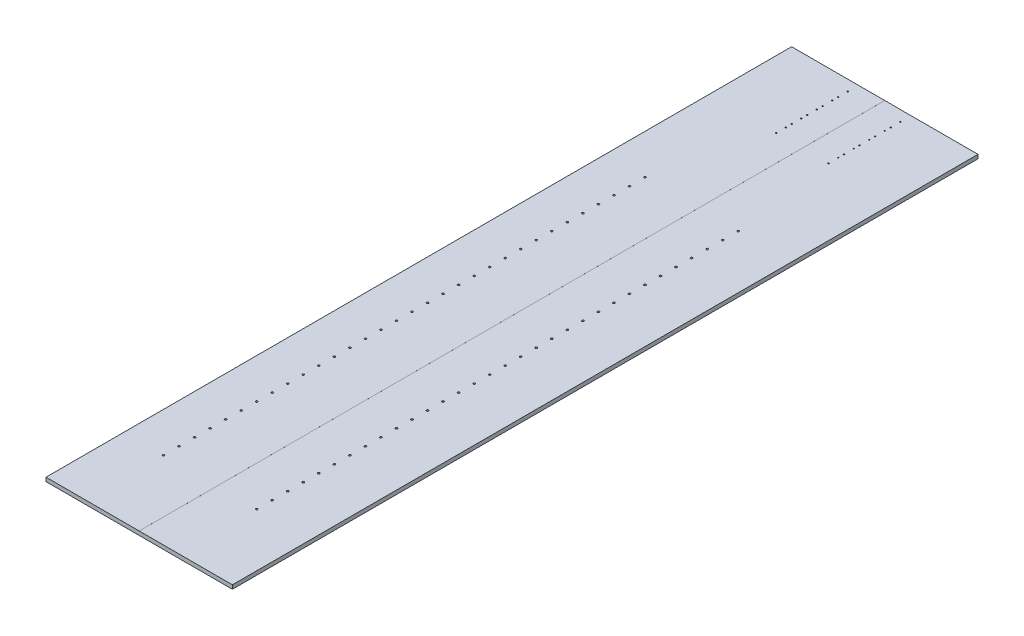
ISO-10303-21;
HEADER;
FILE_DESCRIPTION(('STEP AP214'),'2;1');
FILE_NAME('part.step','',(''),(''),'','','');
FILE_SCHEMA(('AUTOMOTIVE_DESIGN { 1 0 10303 214 1 1 1 1 }'));
ENDSEC;
DATA;
#1=APPLICATION_CONTEXT('core data for automotive mechanical design processes');
#2=APPLICATION_PROTOCOL_DEFINITION('international standard','automotive_design',2000,#1);
#3=PRODUCT_CONTEXT('',#1,'mechanical');
#4=PRODUCT('Part','Part','',(#3));
#5=PRODUCT_RELATED_PRODUCT_CATEGORY('part','',(#4));
#6=PRODUCT_DEFINITION_FORMATION('','',#4);
#7=PRODUCT_DEFINITION_CONTEXT('part definition',#1,'design');
#8=PRODUCT_DEFINITION('design','',#6,#7);
#9=PRODUCT_DEFINITION_SHAPE('','',#8);
#10=(LENGTH_UNIT() NAMED_UNIT(*) SI_UNIT(.MILLI.,.METRE.));
#11=(NAMED_UNIT(*) PLANE_ANGLE_UNIT() SI_UNIT($,.RADIAN.));
#12=(NAMED_UNIT(*) SI_UNIT($,.STERADIAN.) SOLID_ANGLE_UNIT());
#13=UNCERTAINTY_MEASURE_WITH_UNIT(LENGTH_MEASURE(1.E-05),#10,'distance_accuracy_value','');
#14=(GEOMETRIC_REPRESENTATION_CONTEXT(3) GLOBAL_UNCERTAINTY_ASSIGNED_CONTEXT((#13)) GLOBAL_UNIT_ASSIGNED_CONTEXT((#10,
#11,#12)) REPRESENTATION_CONTEXT('',''));
#15=CARTESIAN_POINT('',(0.,0.,0.));
#16=DIRECTION('',(0.,0.,1.));
#17=DIRECTION('',(1.,0.,0.));
#18=AXIS2_PLACEMENT_3D('',#15,#16,#17);
#19=CARTESIAN_POINT('',(0.,12.7,0.));
#20=DIRECTION('',(0.,1.,0.));
#21=DIRECTION('',(0.,0.,1.));
#22=AXIS2_PLACEMENT_3D('',#19,#20,#21);
#23=PLANE('',#22);
#24=DIRECTION('',(0.,0.,1.));
#25=VECTOR('',#24,1.);
#26=CARTESIAN_POINT('',(0.0167198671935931,12.7,-1219.2));
#27=LINE('',#26,#25);
#28=CARTESIAN_POINT('',(0.0167198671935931,12.7,-1219.2));
#29=VERTEX_POINT('',#28);
#30=CARTESIAN_POINT('',(0.0167198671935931,12.7,1219.2));
#31=VERTEX_POINT('',#30);
#32=EDGE_CURVE('E109',#29,#31,#27,.T.);
#33=ORIENTED_EDGE('',*,*,#32,.T.);
#34=DIRECTION('',(1.,0.,0.));
#35=VECTOR('',#34,1.);
#36=CARTESIAN_POINT('',(-304.8,12.7,1219.2));
#37=LINE('',#36,#35);
#38=CARTESIAN_POINT('',(304.8,12.7,1219.2));
#39=VERTEX_POINT('',#38);
#40=EDGE_CURVE('E262',#31,#39,#37,.T.);
#41=ORIENTED_EDGE('',*,*,#40,.T.);
#42=DIRECTION('',(0.,0.,-1.));
#43=VECTOR('',#42,1.);
#44=CARTESIAN_POINT('',(304.8,12.7,-1219.2));
#45=LINE('',#44,#43);
#46=CARTESIAN_POINT('',(304.8,12.7,-1219.2));
#47=VERTEX_POINT('',#46);
#48=EDGE_CURVE('E264',#39,#47,#45,.T.);
#49=ORIENTED_EDGE('',*,*,#48,.T.);
#50=DIRECTION('',(-1.,0.,0.));
#51=VECTOR('',#50,1.);
#52=CARTESIAN_POINT('',(-304.8,12.7,-1219.2));
#53=LINE('',#52,#51);
#54=EDGE_CURVE('E266',#47,#29,#53,.T.);
#55=ORIENTED_EDGE('',*,*,#54,.T.);
#56=EDGE_LOOP('',(#33,#41,#49,#55));
#57=FACE_BOUND('',#56,.T.);
#58=CARTESIAN_POINT('',(130.175,12.7,965.2));
#59=DIRECTION('',(0.,1.,0.));
#60=DIRECTION('',(0.,0.,1.));
#61=AXIS2_PLACEMENT_3D('',#58,#59,#60);
#62=CIRCLE('',#61,3.26389999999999);
#63=CARTESIAN_POINT('',(130.175,12.7,968.4639));
#64=VERTEX_POINT('',#63);
#65=EDGE_CURVE('E11',#64,#64,#62,.T.);
#66=ORIENTED_EDGE('',*,*,#65,.F.);
#67=EDGE_LOOP('',(#66));
#68=FACE_BOUND('',#67,.T.);
#69=CARTESIAN_POINT('',(130.175,12.7,914.4));
#70=DIRECTION('',(0.,1.,0.));
#71=DIRECTION('',(0.,0.,1.));
#72=AXIS2_PLACEMENT_3D('',#69,#70,#71);
#73=CIRCLE('',#72,3.26389999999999);
#74=CARTESIAN_POINT('',(130.175,12.7,917.6639));
#75=VERTEX_POINT('',#74);
#76=EDGE_CURVE('E641',#75,#75,#73,.T.);
#77=ORIENTED_EDGE('',*,*,#76,.F.);
#78=EDGE_LOOP('',(#77));
#79=FACE_BOUND('',#78,.T.);
#80=CARTESIAN_POINT('',(130.175,12.7,863.6));
#81=DIRECTION('',(0.,1.,0.));
#82=DIRECTION('',(0.,0.,1.));
#83=AXIS2_PLACEMENT_3D('',#80,#81,#82);
#84=CIRCLE('',#83,3.26389999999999);
#85=CARTESIAN_POINT('',(130.175,12.7,866.8639));
#86=VERTEX_POINT('',#85);
#87=EDGE_CURVE('E629',#86,#86,#84,.T.);
#88=ORIENTED_EDGE('',*,*,#87,.F.);
#89=EDGE_LOOP('',(#88));
#90=FACE_BOUND('',#89,.T.);
#91=CARTESIAN_POINT('',(130.175,12.7,812.8));
#92=DIRECTION('',(0.,1.,0.));
#93=DIRECTION('',(0.,0.,1.));
#94=AXIS2_PLACEMENT_3D('',#91,#92,#93);
#95=CIRCLE('',#94,3.26389999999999);
#96=CARTESIAN_POINT('',(130.175,12.7,816.0639));
#97=VERTEX_POINT('',#96);
#98=EDGE_CURVE('E617',#97,#97,#95,.T.);
#99=ORIENTED_EDGE('',*,*,#98,.F.);
#100=EDGE_LOOP('',(#99));
#101=FACE_BOUND('',#100,.T.);
#102=CARTESIAN_POINT('',(130.175,12.7,762.));
#103=DIRECTION('',(0.,1.,0.));
#104=DIRECTION('',(0.,0.,1.));
#105=AXIS2_PLACEMENT_3D('',#102,#103,#104);
#106=CIRCLE('',#105,3.26389999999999);
#107=CARTESIAN_POINT('',(130.175,12.7,765.2639));
#108=VERTEX_POINT('',#107);
#109=EDGE_CURVE('E605',#108,#108,#106,.T.);
#110=ORIENTED_EDGE('',*,*,#109,.F.);
#111=EDGE_LOOP('',(#110));
#112=FACE_BOUND('',#111,.T.);
#113=CARTESIAN_POINT('',(130.175,12.7,711.2));
#114=DIRECTION('',(0.,1.,0.));
#115=DIRECTION('',(0.,0.,1.));
#116=AXIS2_PLACEMENT_3D('',#113,#114,#115);
#117=CIRCLE('',#116,3.26389999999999);
#118=CARTESIAN_POINT('',(130.175,12.7,714.4639));
#119=VERTEX_POINT('',#118);
#120=EDGE_CURVE('E593',#119,#119,#117,.T.);
#121=ORIENTED_EDGE('',*,*,#120,.F.);
#122=EDGE_LOOP('',(#121));
#123=FACE_BOUND('',#122,.T.);
#124=CARTESIAN_POINT('',(130.175,12.7,660.4));
#125=DIRECTION('',(0.,1.,0.));
#126=DIRECTION('',(0.,0.,1.));
#127=AXIS2_PLACEMENT_3D('',#124,#125,#126);
#128=CIRCLE('',#127,3.26389999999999);
#129=CARTESIAN_POINT('',(130.175,12.7,663.6639));
#130=VERTEX_POINT('',#129);
#131=EDGE_CURVE('E581',#130,#130,#128,.T.);
#132=ORIENTED_EDGE('',*,*,#131,.F.);
#133=EDGE_LOOP('',(#132));
#134=FACE_BOUND('',#133,.T.);
#135=CARTESIAN_POINT('',(130.175,12.7,609.6));
#136=DIRECTION('',(0.,1.,0.));
#137=DIRECTION('',(0.,0.,1.));
#138=AXIS2_PLACEMENT_3D('',#135,#136,#137);
#139=CIRCLE('',#138,3.26389999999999);
#140=CARTESIAN_POINT('',(130.175,12.7,612.8639));
#141=VERTEX_POINT('',#140);
#142=EDGE_CURVE('E569',#141,#141,#139,.T.);
#143=ORIENTED_EDGE('',*,*,#142,.F.);
#144=EDGE_LOOP('',(#143));
#145=FACE_BOUND('',#144,.T.);
#146=CARTESIAN_POINT('',(130.175,12.7,558.8));
#147=DIRECTION('',(0.,1.,0.));
#148=DIRECTION('',(0.,0.,1.));
#149=AXIS2_PLACEMENT_3D('',#146,#147,#148);
#150=CIRCLE('',#149,3.26389999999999);
#151=CARTESIAN_POINT('',(130.175,12.7,562.0639));
#152=VERTEX_POINT('',#151);
#153=EDGE_CURVE('E557',#152,#152,#150,.T.);
#154=ORIENTED_EDGE('',*,*,#153,.F.);
#155=EDGE_LOOP('',(#154));
#156=FACE_BOUND('',#155,.T.);
#157=CARTESIAN_POINT('',(130.175,12.7,508.));
#158=DIRECTION('',(0.,1.,0.));
#159=DIRECTION('',(0.,0.,1.));
#160=AXIS2_PLACEMENT_3D('',#157,#158,#159);
#161=CIRCLE('',#160,3.26389999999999);
#162=CARTESIAN_POINT('',(130.175,12.7,511.2639));
#163=VERTEX_POINT('',#162);
#164=EDGE_CURVE('E545',#163,#163,#161,.T.);
#165=ORIENTED_EDGE('',*,*,#164,.F.);
#166=EDGE_LOOP('',(#165));
#167=FACE_BOUND('',#166,.T.);
#168=CARTESIAN_POINT('',(130.175,12.7,457.2));
#169=DIRECTION('',(0.,1.,0.));
#170=DIRECTION('',(0.,0.,1.));
#171=AXIS2_PLACEMENT_3D('',#168,#169,#170);
#172=CIRCLE('',#171,3.26389999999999);
#173=CARTESIAN_POINT('',(130.175,12.7,460.4639));
#174=VERTEX_POINT('',#173);
#175=EDGE_CURVE('E533',#174,#174,#172,.T.);
#176=ORIENTED_EDGE('',*,*,#175,.F.);
#177=EDGE_LOOP('',(#176));
#178=FACE_BOUND('',#177,.T.);
#179=CARTESIAN_POINT('',(130.175,12.7,406.4));
#180=DIRECTION('',(0.,1.,0.));
#181=DIRECTION('',(0.,0.,1.));
#182=AXIS2_PLACEMENT_3D('',#179,#180,#181);
#183=CIRCLE('',#182,3.26389999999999);
#184=CARTESIAN_POINT('',(130.175,12.7,409.6639));
#185=VERTEX_POINT('',#184);
#186=EDGE_CURVE('E521',#185,#185,#183,.T.);
#187=ORIENTED_EDGE('',*,*,#186,.F.);
#188=EDGE_LOOP('',(#187));
#189=FACE_BOUND('',#188,.T.);
#190=CARTESIAN_POINT('',(130.175,12.7,355.6));
#191=DIRECTION('',(0.,1.,0.));
#192=DIRECTION('',(0.,0.,1.));
#193=AXIS2_PLACEMENT_3D('',#190,#191,#192);
#194=CIRCLE('',#193,3.26389999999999);
#195=CARTESIAN_POINT('',(130.175,12.7,358.8639));
#196=VERTEX_POINT('',#195);
#197=EDGE_CURVE('E509',#196,#196,#194,.T.);
#198=ORIENTED_EDGE('',*,*,#197,.F.);
#199=EDGE_LOOP('',(#198));
#200=FACE_BOUND('',#199,.T.);
#201=CARTESIAN_POINT('',(130.175,12.7,304.8));
#202=DIRECTION('',(0.,1.,0.));
#203=DIRECTION('',(0.,0.,1.));
#204=AXIS2_PLACEMENT_3D('',#201,#202,#203);
#205=CIRCLE('',#204,3.26389999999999);
#206=CARTESIAN_POINT('',(130.175,12.7,308.0639));
#207=VERTEX_POINT('',#206);
#208=EDGE_CURVE('E497',#207,#207,#205,.T.);
#209=ORIENTED_EDGE('',*,*,#208,.F.);
#210=EDGE_LOOP('',(#209));
#211=FACE_BOUND('',#210,.T.);
#212=CARTESIAN_POINT('',(130.175,12.7,254.));
#213=DIRECTION('',(0.,1.,0.));
#214=DIRECTION('',(0.,0.,1.));
#215=AXIS2_PLACEMENT_3D('',#212,#213,#214);
#216=CIRCLE('',#215,3.26389999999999);
#217=CARTESIAN_POINT('',(130.175,12.7,257.2639));
#218=VERTEX_POINT('',#217);
#219=EDGE_CURVE('E485',#218,#218,#216,.T.);
#220=ORIENTED_EDGE('',*,*,#219,.F.);
#221=EDGE_LOOP('',(#220));
#222=FACE_BOUND('',#221,.T.);
#223=CARTESIAN_POINT('',(130.175,12.7,203.2));
#224=DIRECTION('',(0.,1.,0.));
#225=DIRECTION('',(0.,0.,1.));
#226=AXIS2_PLACEMENT_3D('',#223,#224,#225);
#227=CIRCLE('',#226,3.26389999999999);
#228=CARTESIAN_POINT('',(130.175,12.7,206.4639));
#229=VERTEX_POINT('',#228);
#230=EDGE_CURVE('E473',#229,#229,#227,.T.);
#231=ORIENTED_EDGE('',*,*,#230,.F.);
#232=EDGE_LOOP('',(#231));
#233=FACE_BOUND('',#232,.T.);
#234=CARTESIAN_POINT('',(130.175,12.7,152.4));
#235=DIRECTION('',(0.,1.,0.));
#236=DIRECTION('',(0.,0.,1.));
#237=AXIS2_PLACEMENT_3D('',#234,#235,#236);
#238=CIRCLE('',#237,3.26389999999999);
#239=CARTESIAN_POINT('',(130.175,12.7,155.6639));
#240=VERTEX_POINT('',#239);
#241=EDGE_CURVE('E461',#240,#240,#238,.T.);
#242=ORIENTED_EDGE('',*,*,#241,.F.);
#243=EDGE_LOOP('',(#242));
#244=FACE_BOUND('',#243,.T.);
#245=CARTESIAN_POINT('',(130.175,12.7,101.6));
#246=DIRECTION('',(0.,1.,0.));
#247=DIRECTION('',(0.,0.,1.));
#248=AXIS2_PLACEMENT_3D('',#245,#246,#247);
#249=CIRCLE('',#248,3.26389999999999);
#250=CARTESIAN_POINT('',(130.175,12.7,104.8639));
#251=VERTEX_POINT('',#250);
#252=EDGE_CURVE('E449',#251,#251,#249,.T.);
#253=ORIENTED_EDGE('',*,*,#252,.F.);
#254=EDGE_LOOP('',(#253));
#255=FACE_BOUND('',#254,.T.);
#256=CARTESIAN_POINT('',(130.175,12.7,50.7999999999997));
#257=DIRECTION('',(0.,1.,0.));
#258=DIRECTION('',(0.,0.,1.));
#259=AXIS2_PLACEMENT_3D('',#256,#257,#258);
#260=CIRCLE('',#259,3.26389999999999);
#261=CARTESIAN_POINT('',(130.175,12.7,54.0638999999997));
#262=VERTEX_POINT('',#261);
#263=EDGE_CURVE('E437',#262,#262,#260,.T.);
#264=ORIENTED_EDGE('',*,*,#263,.F.);
#265=EDGE_LOOP('',(#264));
#266=FACE_BOUND('',#265,.T.);
#267=CARTESIAN_POINT('',(130.175,12.7,-3.33066907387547E-13));
#268=DIRECTION('',(0.,1.,0.));
#269=DIRECTION('',(0.,0.,1.));
#270=AXIS2_PLACEMENT_3D('',#267,#268,#269);
#271=CIRCLE('',#270,3.26389999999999);
#272=CARTESIAN_POINT('',(130.175,12.7,3.26389999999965));
#273=VERTEX_POINT('',#272);
#274=EDGE_CURVE('E425',#273,#273,#271,.T.);
#275=ORIENTED_EDGE('',*,*,#274,.F.);
#276=EDGE_LOOP('',(#275));
#277=FACE_BOUND('',#276,.T.);
#278=CARTESIAN_POINT('',(130.175,12.7,-50.8000000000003));
#279=DIRECTION('',(0.,1.,0.));
#280=DIRECTION('',(0.,0.,1.));
#281=AXIS2_PLACEMENT_3D('',#278,#279,#280);
#282=CIRCLE('',#281,3.26389999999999);
#283=CARTESIAN_POINT('',(130.175,12.7,-47.5361000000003));
#284=VERTEX_POINT('',#283);
#285=EDGE_CURVE('E413',#284,#284,#282,.T.);
#286=ORIENTED_EDGE('',*,*,#285,.F.);
#287=EDGE_LOOP('',(#286));
#288=FACE_BOUND('',#287,.T.);
#289=CARTESIAN_POINT('',(130.175,12.7,-101.6));
#290=DIRECTION('',(0.,1.,0.));
#291=DIRECTION('',(0.,0.,1.));
#292=AXIS2_PLACEMENT_3D('',#289,#290,#291);
#293=CIRCLE('',#292,3.26389999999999);
#294=CARTESIAN_POINT('',(130.175,12.7,-98.3361000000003));
#295=VERTEX_POINT('',#294);
#296=EDGE_CURVE('E401',#295,#295,#293,.T.);
#297=ORIENTED_EDGE('',*,*,#296,.F.);
#298=EDGE_LOOP('',(#297));
#299=FACE_BOUND('',#298,.T.);
#300=CARTESIAN_POINT('',(130.175,12.7,-152.4));
#301=DIRECTION('',(0.,1.,0.));
#302=DIRECTION('',(0.,0.,1.));
#303=AXIS2_PLACEMENT_3D('',#300,#301,#302);
#304=CIRCLE('',#303,3.26389999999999);
#305=CARTESIAN_POINT('',(130.175,12.7,-149.1361));
#306=VERTEX_POINT('',#305);
#307=EDGE_CURVE('E389',#306,#306,#304,.T.);
#308=ORIENTED_EDGE('',*,*,#307,.F.);
#309=EDGE_LOOP('',(#308));
#310=FACE_BOUND('',#309,.T.);
#311=CARTESIAN_POINT('',(130.175,12.7,-203.2));
#312=DIRECTION('',(0.,1.,0.));
#313=DIRECTION('',(0.,0.,1.));
#314=AXIS2_PLACEMENT_3D('',#311,#312,#313);
#315=CIRCLE('',#314,3.26389999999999);
#316=CARTESIAN_POINT('',(130.175,12.7,-199.9361));
#317=VERTEX_POINT('',#316);
#318=EDGE_CURVE('E377',#317,#317,#315,.T.);
#319=ORIENTED_EDGE('',*,*,#318,.F.);
#320=EDGE_LOOP('',(#319));
#321=FACE_BOUND('',#320,.T.);
#322=CARTESIAN_POINT('',(130.175,12.7,-254.));
#323=DIRECTION('',(0.,1.,0.));
#324=DIRECTION('',(0.,0.,1.));
#325=AXIS2_PLACEMENT_3D('',#322,#323,#324);
#326=CIRCLE('',#325,3.26389999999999);
#327=CARTESIAN_POINT('',(130.175,12.7,-250.7361));
#328=VERTEX_POINT('',#327);
#329=EDGE_CURVE('E365',#328,#328,#326,.T.);
#330=ORIENTED_EDGE('',*,*,#329,.F.);
#331=EDGE_LOOP('',(#330));
#332=FACE_BOUND('',#331,.T.);
#333=CARTESIAN_POINT('',(130.175,12.7,-304.8));
#334=DIRECTION('',(0.,1.,0.));
#335=DIRECTION('',(0.,0.,1.));
#336=AXIS2_PLACEMENT_3D('',#333,#334,#335);
#337=CIRCLE('',#336,3.26389999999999);
#338=CARTESIAN_POINT('',(130.175,12.7,-301.5361));
#339=VERTEX_POINT('',#338);
#340=EDGE_CURVE('E353',#339,#339,#337,.T.);
#341=ORIENTED_EDGE('',*,*,#340,.F.);
#342=EDGE_LOOP('',(#341));
#343=FACE_BOUND('',#342,.T.);
#344=CARTESIAN_POINT('',(130.175,12.7,-355.6));
#345=DIRECTION('',(0.,1.,0.));
#346=DIRECTION('',(0.,0.,1.));
#347=AXIS2_PLACEMENT_3D('',#344,#345,#346);
#348=CIRCLE('',#347,3.26389999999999);
#349=CARTESIAN_POINT('',(130.175,12.7,-352.3361));
#350=VERTEX_POINT('',#349);
#351=EDGE_CURVE('E341',#350,#350,#348,.T.);
#352=ORIENTED_EDGE('',*,*,#351,.F.);
#353=EDGE_LOOP('',(#352));
#354=FACE_BOUND('',#353,.T.);
#355=CARTESIAN_POINT('',(130.175,12.7,-406.4));
#356=DIRECTION('',(0.,1.,0.));
#357=DIRECTION('',(0.,0.,1.));
#358=AXIS2_PLACEMENT_3D('',#355,#356,#357);
#359=CIRCLE('',#358,3.26389999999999);
#360=CARTESIAN_POINT('',(130.175,12.7,-403.1361));
#361=VERTEX_POINT('',#360);
#362=EDGE_CURVE('E329',#361,#361,#359,.T.);
#363=ORIENTED_EDGE('',*,*,#362,.F.);
#364=EDGE_LOOP('',(#363));
#365=FACE_BOUND('',#364,.T.);
#366=CARTESIAN_POINT('',(130.175,12.7,-457.2));
#367=DIRECTION('',(0.,1.,0.));
#368=DIRECTION('',(0.,0.,1.));
#369=AXIS2_PLACEMENT_3D('',#366,#367,#368);
#370=CIRCLE('',#369,3.26389999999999);
#371=CARTESIAN_POINT('',(130.175,12.7,-453.9361));
#372=VERTEX_POINT('',#371);
#373=EDGE_CURVE('E317',#372,#372,#370,.T.);
#374=ORIENTED_EDGE('',*,*,#373,.F.);
#375=EDGE_LOOP('',(#374));
#376=FACE_BOUND('',#375,.T.);
#377=CARTESIAN_POINT('',(130.175,12.7,-508.));
#378=DIRECTION('',(0.,1.,0.));
#379=DIRECTION('',(0.,0.,1.));
#380=AXIS2_PLACEMENT_3D('',#377,#378,#379);
#381=CIRCLE('',#380,3.26389999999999);
#382=CARTESIAN_POINT('',(130.175,12.7,-504.7361));
#383=VERTEX_POINT('',#382);
#384=EDGE_CURVE('E305',#383,#383,#381,.T.);
#385=ORIENTED_EDGE('',*,*,#384,.F.);
#386=EDGE_LOOP('',(#385));
#387=FACE_BOUND('',#386,.T.);
#388=CARTESIAN_POINT('',(130.175,12.7,-558.8));
#389=DIRECTION('',(0.,1.,0.));
#390=DIRECTION('',(0.,0.,1.));
#391=AXIS2_PLACEMENT_3D('',#388,#389,#390);
#392=CIRCLE('',#391,3.26389999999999);
#393=CARTESIAN_POINT('',(130.175,12.7,-555.5361));
#394=VERTEX_POINT('',#393);
#395=EDGE_CURVE('E293',#394,#394,#392,.T.);
#396=ORIENTED_EDGE('',*,*,#395,.F.);
#397=EDGE_LOOP('',(#396));
#398=FACE_BOUND('',#397,.T.);
#399=CARTESIAN_POINT('',(130.175,12.7,-609.6));
#400=DIRECTION('',(0.,1.,0.));
#401=DIRECTION('',(0.,0.,1.));
#402=AXIS2_PLACEMENT_3D('',#399,#400,#401);
#403=CIRCLE('',#402,3.26389999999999);
#404=CARTESIAN_POINT('',(130.175,12.7,-606.3361));
#405=VERTEX_POINT('',#404);
#406=EDGE_CURVE('E250',#405,#405,#403,.T.);
#407=ORIENTED_EDGE('',*,*,#406,.F.);
#408=EDGE_LOOP('',(#407));
#409=FACE_BOUND('',#408,.T.);
#410=CARTESIAN_POINT('',(85.7249999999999,12.7,-1184.275));
#411=DIRECTION('',(0.,1.,0.));
#412=DIRECTION('',(0.,0.,1.));
#413=AXIS2_PLACEMENT_3D('',#410,#411,#412);
#414=CIRCLE('',#413,2.01929999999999);
#415=CARTESIAN_POINT('',(85.7249999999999,12.7,-1182.2557));
#416=VERTEX_POINT('',#415);
#417=EDGE_CURVE('E241',#416,#416,#414,.T.);
#418=ORIENTED_EDGE('',*,*,#417,.F.);
#419=EDGE_LOOP('',(#418));
#420=FACE_BOUND('',#419,.T.);
#421=CARTESIAN_POINT('',(85.7249999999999,12.7,-1152.525));
#422=DIRECTION('',(0.,1.,0.));
#423=DIRECTION('',(0.,0.,1.));
#424=AXIS2_PLACEMENT_3D('',#421,#422,#423);
#425=CIRCLE('',#424,2.01929999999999);
#426=CARTESIAN_POINT('',(85.7249999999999,12.7,-1150.5057));
#427=VERTEX_POINT('',#426);
#428=EDGE_CURVE('E235',#427,#427,#425,.T.);
#429=ORIENTED_EDGE('',*,*,#428,.F.);
#430=EDGE_LOOP('',(#429));
#431=FACE_BOUND('',#430,.T.);
#432=CARTESIAN_POINT('',(85.7249999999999,12.7,-1133.475));
#433=DIRECTION('',(0.,1.,0.));
#434=DIRECTION('',(0.,0.,1.));
#435=AXIS2_PLACEMENT_3D('',#432,#433,#434);
#436=CIRCLE('',#435,2.01929999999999);
#437=CARTESIAN_POINT('',(85.7249999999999,12.7,-1131.4557));
#438=VERTEX_POINT('',#437);
#439=EDGE_CURVE('E229',#438,#438,#436,.T.);
#440=ORIENTED_EDGE('',*,*,#439,.F.);
#441=EDGE_LOOP('',(#440));
#442=FACE_BOUND('',#441,.T.);
#443=CARTESIAN_POINT('',(85.7249999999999,12.7,-1101.725));
#444=DIRECTION('',(0.,1.,0.));
#445=DIRECTION('',(0.,0.,1.));
#446=AXIS2_PLACEMENT_3D('',#443,#444,#445);
#447=CIRCLE('',#446,2.01929999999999);
#448=CARTESIAN_POINT('',(85.7249999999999,12.7,-1099.7057));
#449=VERTEX_POINT('',#448);
#450=EDGE_CURVE('E223',#449,#449,#447,.T.);
#451=ORIENTED_EDGE('',*,*,#450,.F.);
#452=EDGE_LOOP('',(#451));
#453=FACE_BOUND('',#452,.T.);
#454=CARTESIAN_POINT('',(85.7249999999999,12.7,-1082.675));
#455=DIRECTION('',(0.,1.,0.));
#456=DIRECTION('',(0.,0.,1.));
#457=AXIS2_PLACEMENT_3D('',#454,#455,#456);
#458=CIRCLE('',#457,2.01929999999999);
#459=CARTESIAN_POINT('',(85.7249999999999,12.7,-1080.6557));
#460=VERTEX_POINT('',#459);
#461=EDGE_CURVE('E217',#460,#460,#458,.T.);
#462=ORIENTED_EDGE('',*,*,#461,.F.);
#463=EDGE_LOOP('',(#462));
#464=FACE_BOUND('',#463,.T.);
#465=CARTESIAN_POINT('',(85.7249999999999,12.7,-1050.925));
#466=DIRECTION('',(0.,1.,0.));
#467=DIRECTION('',(0.,0.,1.));
#468=AXIS2_PLACEMENT_3D('',#465,#466,#467);
#469=CIRCLE('',#468,2.01929999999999);
#470=CARTESIAN_POINT('',(85.7249999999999,12.7,-1048.9057));
#471=VERTEX_POINT('',#470);
#472=EDGE_CURVE('E211',#471,#471,#469,.T.);
#473=ORIENTED_EDGE('',*,*,#472,.F.);
#474=EDGE_LOOP('',(#473));
#475=FACE_BOUND('',#474,.T.);
#476=CARTESIAN_POINT('',(85.7249999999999,12.7,-1031.875));
#477=DIRECTION('',(0.,1.,0.));
#478=DIRECTION('',(0.,0.,1.));
#479=AXIS2_PLACEMENT_3D('',#476,#477,#478);
#480=CIRCLE('',#479,2.01929999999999);
#481=CARTESIAN_POINT('',(85.7249999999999,12.7,-1029.8557));
#482=VERTEX_POINT('',#481);
#483=EDGE_CURVE('E205',#482,#482,#480,.T.);
#484=ORIENTED_EDGE('',*,*,#483,.F.);
#485=EDGE_LOOP('',(#484));
#486=FACE_BOUND('',#485,.T.);
#487=CARTESIAN_POINT('',(85.7249999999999,12.7,-1000.125));
#488=DIRECTION('',(0.,1.,0.));
#489=DIRECTION('',(0.,0.,1.));
#490=AXIS2_PLACEMENT_3D('',#487,#488,#489);
#491=CIRCLE('',#490,2.01929999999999);
#492=CARTESIAN_POINT('',(85.7249999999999,12.7,-998.1057));
#493=VERTEX_POINT('',#492);
#494=EDGE_CURVE('E199',#493,#493,#491,.T.);
#495=ORIENTED_EDGE('',*,*,#494,.F.);
#496=EDGE_LOOP('',(#495));
#497=FACE_BOUND('',#496,.T.);
#498=CARTESIAN_POINT('',(85.7249999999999,12.7,-981.075));
#499=DIRECTION('',(0.,1.,0.));
#500=DIRECTION('',(0.,0.,1.));
#501=AXIS2_PLACEMENT_3D('',#498,#499,#500);
#502=CIRCLE('',#501,2.01929999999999);
#503=CARTESIAN_POINT('',(85.7249999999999,12.7,-979.0557));
#504=VERTEX_POINT('',#503);
#505=EDGE_CURVE('E193',#504,#504,#502,.T.);
#506=ORIENTED_EDGE('',*,*,#505,.F.);
#507=EDGE_LOOP('',(#506));
#508=FACE_BOUND('',#507,.T.);
#509=CARTESIAN_POINT('',(85.7249999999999,12.7,-949.325));
#510=DIRECTION('',(0.,1.,0.));
#511=DIRECTION('',(0.,0.,1.));
#512=AXIS2_PLACEMENT_3D('',#509,#510,#511);
#513=CIRCLE('',#512,2.01929999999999);
#514=CARTESIAN_POINT('',(85.7249999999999,12.7,-947.3057));
#515=VERTEX_POINT('',#514);
#516=EDGE_CURVE('E187',#515,#515,#513,.T.);
#517=ORIENTED_EDGE('',*,*,#516,.F.);
#518=EDGE_LOOP('',(#517));
#519=FACE_BOUND('',#518,.T.);
#520=ADVANCED_FACE('F35',(#57,#68,#79,#90,#101,#112,#123,#134,#145,#156,#167,#178,#189,#200,
#211,#222,#233,#244,#255,#266,#277,#288,#299,#310,#321,#332,#343,#354,#365,#376,#387,#398,#409,
#420,#431,#442,#453,#464,#475,#486,#497,#508,#519),#23,.T.);
#521=CARTESIAN_POINT('',(-304.8,12.7,-1219.2));
#522=DIRECTION('',(1.,0.,0.));
#523=DIRECTION('',(0.,0.,-1.));
#524=AXIS2_PLACEMENT_3D('',#521,#522,#523);
#525=PLANE('',#524);
#526=DIRECTION('',(0.,0.,1.));
#527=VECTOR('',#526,1.);
#528=CARTESIAN_POINT('',(-304.8,0.,-1219.2));
#529=LINE('',#528,#527);
#530=CARTESIAN_POINT('',(-304.8,0.,-1219.2));
#531=VERTEX_POINT('',#530);
#532=CARTESIAN_POINT('',(-304.8,0.,1219.2));
#533=VERTEX_POINT('',#532);
#534=EDGE_CURVE('E259',#531,#533,#529,.T.);
#535=ORIENTED_EDGE('',*,*,#534,.T.);
#536=DIRECTION('',(0.,-1.,0.));
#537=VECTOR('',#536,1.);
#538=CARTESIAN_POINT('',(-304.8,12.7,1219.2));
#539=LINE('',#538,#537);
#540=CARTESIAN_POINT('',(-304.8,12.7,1219.2));
#541=VERTEX_POINT('',#540);
#542=EDGE_CURVE('E282',#541,#533,#539,.T.);
#543=ORIENTED_EDGE('',*,*,#542,.F.);
#544=DIRECTION('',(0.,0.,1.));
#545=VECTOR('',#544,1.);
#546=CARTESIAN_POINT('',(-304.8,12.7,-1219.2));
#547=LINE('',#546,#545);
#548=CARTESIAN_POINT('',(-304.8,12.7,-1219.2));
#549=VERTEX_POINT('',#548);
#550=EDGE_CURVE('E260',#549,#541,#547,.T.);
#551=ORIENTED_EDGE('',*,*,#550,.F.);
#552=DIRECTION('',(0.,-1.,0.));
#553=VECTOR('',#552,1.);
#554=CARTESIAN_POINT('',(-304.8,12.7,-1219.2));
#555=LINE('',#554,#553);
#556=EDGE_CURVE('E268',#549,#531,#555,.T.);
#557=ORIENTED_EDGE('',*,*,#556,.T.);
#558=EDGE_LOOP('',(#535,#543,#551,#557));
#559=FACE_BOUND('',#558,.T.);
#560=ADVANCED_FACE('F662',(#559),#525,.F.);
#561=CARTESIAN_POINT('',(-304.8,12.7,1219.2));
#562=DIRECTION('',(0.,0.,-1.));
#563=DIRECTION('',(-1.,0.,0.));
#564=AXIS2_PLACEMENT_3D('',#561,#562,#563);
#565=PLANE('',#564);
#566=ORIENTED_EDGE('',*,*,#40,.F.);
#567=DIRECTION('',(0.130526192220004,0.991444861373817,0.));
#568=VECTOR('',#567,1.);
#569=CARTESIAN_POINT('',(0.,12.573,1219.2));
#570=LINE('',#569,#568);
#571=CARTESIAN_POINT('',(0.,12.573,1219.2));
#572=VERTEX_POINT('',#571);
#573=EDGE_CURVE('E120',#572,#31,#570,.T.);
#574=ORIENTED_EDGE('',*,*,#573,.F.);
#575=DIRECTION('',(0.130526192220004,-0.991444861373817,0.));
#576=VECTOR('',#575,1.);
#577=CARTESIAN_POINT('',(-0.0167198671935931,12.7,1219.2));
#578=LINE('',#577,#576);
#579=CARTESIAN_POINT('',(-0.0167198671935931,12.7,1219.2));
#580=VERTEX_POINT('',#579);
#581=EDGE_CURVE('E106',#580,#572,#578,.T.);
#582=ORIENTED_EDGE('',*,*,#581,.F.);
#583=EDGE_CURVE('E88',#541,#580,#37,.T.);
#584=ORIENTED_EDGE('',*,*,#583,.F.);
#585=ORIENTED_EDGE('',*,*,#542,.T.);
#586=DIRECTION('',(1.,0.,0.));
#587=VECTOR('',#586,1.);
#588=CARTESIAN_POINT('',(-304.8,0.,1219.2));
#589=LINE('',#588,#587);
#590=CARTESIAN_POINT('',(304.8,0.,1219.2));
#591=VERTEX_POINT('',#590);
#592=EDGE_CURVE('E271',#533,#591,#589,.T.);
#593=ORIENTED_EDGE('',*,*,#592,.T.);
#594=DIRECTION('',(0.,-1.,0.));
#595=VECTOR('',#594,1.);
#596=CARTESIAN_POINT('',(304.8,12.7,1219.2));
#597=LINE('',#596,#595);
#598=EDGE_CURVE('E279',#39,#591,#597,.T.);
#599=ORIENTED_EDGE('',*,*,#598,.F.);
#600=EDGE_LOOP('',(#566,#574,#582,#584,#585,#593,#599));
#601=FACE_BOUND('',#600,.T.);
#602=ADVANCED_FACE('F815',(#601),#565,.F.);
#603=CARTESIAN_POINT('',(304.8,12.7,-1219.2));
#604=DIRECTION('',(-1.,0.,0.));
#605=DIRECTION('',(0.,0.,1.));
#606=AXIS2_PLACEMENT_3D('',#603,#604,#605);
#607=PLANE('',#606);
#608=DIRECTION('',(0.,0.,-1.));
#609=VECTOR('',#608,1.);
#610=CARTESIAN_POINT('',(304.8,0.,-1219.2));
#611=LINE('',#610,#609);
#612=CARTESIAN_POINT('',(304.8,0.,-1219.2));
#613=VERTEX_POINT('',#612);
#614=EDGE_CURVE('E273',#591,#613,#611,.T.);
#615=ORIENTED_EDGE('',*,*,#614,.T.);
#616=DIRECTION('',(0.,-1.,0.));
#617=VECTOR('',#616,1.);
#618=CARTESIAN_POINT('',(304.8,12.7,-1219.2));
#619=LINE('',#618,#617);
#620=EDGE_CURVE('E277',#47,#613,#619,.T.);
#621=ORIENTED_EDGE('',*,*,#620,.F.);
#622=ORIENTED_EDGE('',*,*,#48,.F.);
#623=ORIENTED_EDGE('',*,*,#598,.T.);
#624=EDGE_LOOP('',(#615,#621,#622,#623));
#625=FACE_BOUND('',#624,.T.);
#626=ADVANCED_FACE('F812',(#625),#607,.F.);
#627=CARTESIAN_POINT('',(-304.8,12.7,-1219.2));
#628=DIRECTION('',(0.,0.,1.));
#629=DIRECTION('',(1.,0.,0.));
#630=AXIS2_PLACEMENT_3D('',#627,#628,#629);
#631=PLANE('',#630);
#632=DIRECTION('',(0.130526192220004,-0.991444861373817,0.));
#633=VECTOR('',#632,1.);
#634=CARTESIAN_POINT('',(-0.0167198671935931,12.7,-1219.2));
#635=LINE('',#634,#633);
#636=CARTESIAN_POINT('',(-0.0167198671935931,12.7,-1219.2));
#637=VERTEX_POINT('',#636);
#638=CARTESIAN_POINT('',(0.,12.573,-1219.2));
#639=VERTEX_POINT('',#638);
#640=EDGE_CURVE('E50',#637,#639,#635,.T.);
#641=ORIENTED_EDGE('',*,*,#640,.T.);
#642=DIRECTION('',(0.130526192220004,0.991444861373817,0.));
#643=VECTOR('',#642,1.);
#644=CARTESIAN_POINT('',(0.,12.573,-1219.2));
#645=LINE('',#644,#643);
#646=EDGE_CURVE('E113',#639,#29,#645,.T.);
#647=ORIENTED_EDGE('',*,*,#646,.T.);
#648=ORIENTED_EDGE('',*,*,#54,.F.);
#649=ORIENTED_EDGE('',*,*,#620,.T.);
#650=DIRECTION('',(-1.,0.,0.));
#651=VECTOR('',#650,1.);
#652=CARTESIAN_POINT('',(-304.8,0.,-1219.2));
#653=LINE('',#652,#651);
#654=EDGE_CURVE('E80',#613,#531,#653,.T.);
#655=ORIENTED_EDGE('',*,*,#654,.T.);
#656=ORIENTED_EDGE('',*,*,#556,.F.);
#657=EDGE_CURVE('E58',#637,#549,#53,.T.);
#658=ORIENTED_EDGE('',*,*,#657,.F.);
#659=EDGE_LOOP('',(#641,#647,#648,#649,#655,#656,#658));
#660=FACE_BOUND('',#659,.T.);
#661=ADVANCED_FACE('F119',(#660),#631,.F.);
#662=DIRECTION('',(0.,0.,1.));
#663=VECTOR('',#662,1.);
#664=CARTESIAN_POINT('',(-0.0167198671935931,12.7,-1219.2));
#665=LINE('',#664,#663);
#666=EDGE_CURVE('E110',#637,#580,#665,.T.);
#667=ORIENTED_EDGE('',*,*,#666,.F.);
#668=ORIENTED_EDGE('',*,*,#657,.T.);
#669=ORIENTED_EDGE('',*,*,#550,.T.);
#670=ORIENTED_EDGE('',*,*,#583,.T.);
#671=EDGE_LOOP('',(#667,#668,#669,#670));
#672=FACE_BOUND('',#671,.T.);
#673=CARTESIAN_POINT('',(-85.7250000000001,12.7,-1184.275));
#674=DIRECTION('',(0.,1.,0.));
#675=DIRECTION('',(0.,0.,1.));
#676=AXIS2_PLACEMENT_3D('',#673,#674,#675);
#677=CIRCLE('',#676,2.01929999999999);
#678=CARTESIAN_POINT('',(-85.7250000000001,12.7,-1182.2557));
#679=VERTEX_POINT('',#678);
#680=EDGE_CURVE('E125',#679,#679,#677,.T.);
#681=ORIENTED_EDGE('',*,*,#680,.F.);
#682=EDGE_LOOP('',(#681));
#683=FACE_BOUND('',#682,.T.);
#684=CARTESIAN_POINT('',(-85.7250000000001,12.7,-1152.525));
#685=DIRECTION('',(0.,1.,0.));
#686=DIRECTION('',(0.,0.,1.));
#687=AXIS2_PLACEMENT_3D('',#684,#685,#686);
#688=CIRCLE('',#687,2.01929999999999);
#689=CARTESIAN_POINT('',(-85.7250000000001,12.7,-1150.5057));
#690=VERTEX_POINT('',#689);
#691=EDGE_CURVE('E133',#690,#690,#688,.T.);
#692=ORIENTED_EDGE('',*,*,#691,.F.);
#693=EDGE_LOOP('',(#692));
#694=FACE_BOUND('',#693,.T.);
#695=CARTESIAN_POINT('',(-85.7250000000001,12.7,-1133.475));
#696=DIRECTION('',(0.,1.,0.));
#697=DIRECTION('',(0.,0.,1.));
#698=AXIS2_PLACEMENT_3D('',#695,#696,#697);
#699=CIRCLE('',#698,2.01929999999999);
#700=CARTESIAN_POINT('',(-85.7250000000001,12.7,-1131.4557));
#701=VERTEX_POINT('',#700);
#702=EDGE_CURVE('E139',#701,#701,#699,.T.);
#703=ORIENTED_EDGE('',*,*,#702,.F.);
#704=EDGE_LOOP('',(#703));
#705=FACE_BOUND('',#704,.T.);
#706=CARTESIAN_POINT('',(-85.7250000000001,12.7,-1101.725));
#707=DIRECTION('',(0.,1.,0.));
#708=DIRECTION('',(0.,0.,1.));
#709=AXIS2_PLACEMENT_3D('',#706,#707,#708);
#710=CIRCLE('',#709,2.01929999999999);
#711=CARTESIAN_POINT('',(-85.7250000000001,12.7,-1099.7057));
#712=VERTEX_POINT('',#711);
#713=EDGE_CURVE('E145',#712,#712,#710,.T.);
#714=ORIENTED_EDGE('',*,*,#713,.F.);
#715=EDGE_LOOP('',(#714));
#716=FACE_BOUND('',#715,.T.);
#717=CARTESIAN_POINT('',(-85.7250000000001,12.7,-1082.675));
#718=DIRECTION('',(0.,1.,0.));
#719=DIRECTION('',(0.,0.,1.));
#720=AXIS2_PLACEMENT_3D('',#717,#718,#719);
#721=CIRCLE('',#720,2.01929999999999);
#722=CARTESIAN_POINT('',(-85.7250000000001,12.7,-1080.6557));
#723=VERTEX_POINT('',#722);
#724=EDGE_CURVE('E151',#723,#723,#721,.T.);
#725=ORIENTED_EDGE('',*,*,#724,.F.);
#726=EDGE_LOOP('',(#725));
#727=FACE_BOUND('',#726,.T.);
#728=CARTESIAN_POINT('',(-85.7250000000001,12.7,-1050.925));
#729=DIRECTION('',(0.,1.,0.));
#730=DIRECTION('',(0.,0.,1.));
#731=AXIS2_PLACEMENT_3D('',#728,#729,#730);
#732=CIRCLE('',#731,2.01929999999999);
#733=CARTESIAN_POINT('',(-85.7250000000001,12.7,-1048.9057));
#734=VERTEX_POINT('',#733);
#735=EDGE_CURVE('E157',#734,#734,#732,.T.);
#736=ORIENTED_EDGE('',*,*,#735,.F.);
#737=EDGE_LOOP('',(#736));
#738=FACE_BOUND('',#737,.T.);
#739=CARTESIAN_POINT('',(-85.7250000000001,12.7,-1031.875));
#740=DIRECTION('',(0.,1.,0.));
#741=DIRECTION('',(0.,0.,1.));
#742=AXIS2_PLACEMENT_3D('',#739,#740,#741);
#743=CIRCLE('',#742,2.01929999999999);
#744=CARTESIAN_POINT('',(-85.7250000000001,12.7,-1029.8557));
#745=VERTEX_POINT('',#744);
#746=EDGE_CURVE('E163',#745,#745,#743,.T.);
#747=ORIENTED_EDGE('',*,*,#746,.F.);
#748=EDGE_LOOP('',(#747));
#749=FACE_BOUND('',#748,.T.);
#750=CARTESIAN_POINT('',(-85.7250000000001,12.7,-1000.125));
#751=DIRECTION('',(0.,1.,0.));
#752=DIRECTION('',(0.,0.,1.));
#753=AXIS2_PLACEMENT_3D('',#750,#751,#752);
#754=CIRCLE('',#753,2.01929999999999);
#755=CARTESIAN_POINT('',(-85.7250000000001,12.7,-998.1057));
#756=VERTEX_POINT('',#755);
#757=EDGE_CURVE('E169',#756,#756,#754,.T.);
#758=ORIENTED_EDGE('',*,*,#757,.F.);
#759=EDGE_LOOP('',(#758));
#760=FACE_BOUND('',#759,.T.);
#761=CARTESIAN_POINT('',(-85.7250000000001,12.7,-981.075));
#762=DIRECTION('',(0.,1.,0.));
#763=DIRECTION('',(0.,0.,1.));
#764=AXIS2_PLACEMENT_3D('',#761,#762,#763);
#765=CIRCLE('',#764,2.01929999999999);
#766=CARTESIAN_POINT('',(-85.7250000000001,12.7,-979.0557));
#767=VERTEX_POINT('',#766);
#768=EDGE_CURVE('E175',#767,#767,#765,.T.);
#769=ORIENTED_EDGE('',*,*,#768,.F.);
#770=EDGE_LOOP('',(#769));
#771=FACE_BOUND('',#770,.T.);
#772=CARTESIAN_POINT('',(-85.7250000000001,12.7,-949.325));
#773=DIRECTION('',(0.,1.,0.));
#774=DIRECTION('',(0.,0.,1.));
#775=AXIS2_PLACEMENT_3D('',#772,#773,#774);
#776=CIRCLE('',#775,2.01929999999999);
#777=CARTESIAN_POINT('',(-85.7250000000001,12.7,-947.3057));
#778=VERTEX_POINT('',#777);
#779=EDGE_CURVE('E181',#778,#778,#776,.T.);
#780=ORIENTED_EDGE('',*,*,#779,.F.);
#781=EDGE_LOOP('',(#780));
#782=FACE_BOUND('',#781,.T.);
#783=CARTESIAN_POINT('',(-174.625,12.7,-609.6));
#784=DIRECTION('',(0.,1.,0.));
#785=DIRECTION('',(0.,0.,1.));
#786=AXIS2_PLACEMENT_3D('',#783,#784,#785);
#787=CIRCLE('',#786,3.26389999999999);
#788=CARTESIAN_POINT('',(-174.625,12.7,-606.3361));
#789=VERTEX_POINT('',#788);
#790=EDGE_CURVE('E253',#789,#789,#787,.T.);
#791=ORIENTED_EDGE('',*,*,#790,.F.);
#792=EDGE_LOOP('',(#791));
#793=FACE_BOUND('',#792,.T.);
#794=CARTESIAN_POINT('',(-174.625,12.7,-558.8));
#795=DIRECTION('',(0.,1.,0.));
#796=DIRECTION('',(0.,0.,1.));
#797=AXIS2_PLACEMENT_3D('',#794,#795,#796);
#798=CIRCLE('',#797,3.26389999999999);
#799=CARTESIAN_POINT('',(-174.625,12.7,-555.5361));
#800=VERTEX_POINT('',#799);
#801=EDGE_CURVE('E287',#800,#800,#798,.T.);
#802=ORIENTED_EDGE('',*,*,#801,.F.);
#803=EDGE_LOOP('',(#802));
#804=FACE_BOUND('',#803,.T.);
#805=CARTESIAN_POINT('',(-174.625,12.7,-508.));
#806=DIRECTION('',(0.,1.,0.));
#807=DIRECTION('',(0.,0.,1.));
#808=AXIS2_PLACEMENT_3D('',#805,#806,#807);
#809=CIRCLE('',#808,3.26389999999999);
#810=CARTESIAN_POINT('',(-174.625,12.7,-504.7361));
#811=VERTEX_POINT('',#810);
#812=EDGE_CURVE('E299',#811,#811,#809,.T.);
#813=ORIENTED_EDGE('',*,*,#812,.F.);
#814=EDGE_LOOP('',(#813));
#815=FACE_BOUND('',#814,.T.);
#816=CARTESIAN_POINT('',(-174.625,12.7,-457.2));
#817=DIRECTION('',(0.,1.,0.));
#818=DIRECTION('',(0.,0.,1.));
#819=AXIS2_PLACEMENT_3D('',#816,#817,#818);
#820=CIRCLE('',#819,3.26389999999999);
#821=CARTESIAN_POINT('',(-174.625,12.7,-453.9361));
#822=VERTEX_POINT('',#821);
#823=EDGE_CURVE('E311',#822,#822,#820,.T.);
#824=ORIENTED_EDGE('',*,*,#823,.F.);
#825=EDGE_LOOP('',(#824));
#826=FACE_BOUND('',#825,.T.);
#827=CARTESIAN_POINT('',(-174.625,12.7,-406.4));
#828=DIRECTION('',(0.,1.,0.));
#829=DIRECTION('',(0.,0.,1.));
#830=AXIS2_PLACEMENT_3D('',#827,#828,#829);
#831=CIRCLE('',#830,3.26389999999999);
#832=CARTESIAN_POINT('',(-174.625,12.7,-403.1361));
#833=VERTEX_POINT('',#832);
#834=EDGE_CURVE('E323',#833,#833,#831,.T.);
#835=ORIENTED_EDGE('',*,*,#834,.F.);
#836=EDGE_LOOP('',(#835));
#837=FACE_BOUND('',#836,.T.);
#838=CARTESIAN_POINT('',(-174.625,12.7,-355.6));
#839=DIRECTION('',(0.,1.,0.));
#840=DIRECTION('',(0.,0.,1.));
#841=AXIS2_PLACEMENT_3D('',#838,#839,#840);
#842=CIRCLE('',#841,3.26389999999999);
#843=CARTESIAN_POINT('',(-174.625,12.7,-352.3361));
#844=VERTEX_POINT('',#843);
#845=EDGE_CURVE('E335',#844,#844,#842,.T.);
#846=ORIENTED_EDGE('',*,*,#845,.F.);
#847=EDGE_LOOP('',(#846));
#848=FACE_BOUND('',#847,.T.);
#849=CARTESIAN_POINT('',(-174.625,12.7,-304.8));
#850=DIRECTION('',(0.,1.,0.));
#851=DIRECTION('',(0.,0.,1.));
#852=AXIS2_PLACEMENT_3D('',#849,#850,#851);
#853=CIRCLE('',#852,3.26389999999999);
#854=CARTESIAN_POINT('',(-174.625,12.7,-301.5361));
#855=VERTEX_POINT('',#854);
#856=EDGE_CURVE('E347',#855,#855,#853,.T.);
#857=ORIENTED_EDGE('',*,*,#856,.F.);
#858=EDGE_LOOP('',(#857));
#859=FACE_BOUND('',#858,.T.);
#860=CARTESIAN_POINT('',(-174.625,12.7,-254.));
#861=DIRECTION('',(0.,1.,0.));
#862=DIRECTION('',(0.,0.,1.));
#863=AXIS2_PLACEMENT_3D('',#860,#861,#862);
#864=CIRCLE('',#863,3.26389999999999);
#865=CARTESIAN_POINT('',(-174.625,12.7,-250.7361));
#866=VERTEX_POINT('',#865);
#867=EDGE_CURVE('E359',#866,#866,#864,.T.);
#868=ORIENTED_EDGE('',*,*,#867,.F.);
#869=EDGE_LOOP('',(#868));
#870=FACE_BOUND('',#869,.T.);
#871=CARTESIAN_POINT('',(-174.625,12.7,-203.2));
#872=DIRECTION('',(0.,1.,0.));
#873=DIRECTION('',(0.,0.,1.));
#874=AXIS2_PLACEMENT_3D('',#871,#872,#873);
#875=CIRCLE('',#874,3.26389999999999);
#876=CARTESIAN_POINT('',(-174.625,12.7,-199.9361));
#877=VERTEX_POINT('',#876);
#878=EDGE_CURVE('E371',#877,#877,#875,.T.);
#879=ORIENTED_EDGE('',*,*,#878,.F.);
#880=EDGE_LOOP('',(#879));
#881=FACE_BOUND('',#880,.T.);
#882=CARTESIAN_POINT('',(-174.625,12.7,-152.4));
#883=DIRECTION('',(0.,1.,0.));
#884=DIRECTION('',(0.,0.,1.));
#885=AXIS2_PLACEMENT_3D('',#882,#883,#884);
#886=CIRCLE('',#885,3.26389999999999);
#887=CARTESIAN_POINT('',(-174.625,12.7,-149.1361));
#888=VERTEX_POINT('',#887);
#889=EDGE_CURVE('E383',#888,#888,#886,.T.);
#890=ORIENTED_EDGE('',*,*,#889,.F.);
#891=EDGE_LOOP('',(#890));
#892=FACE_BOUND('',#891,.T.);
#893=CARTESIAN_POINT('',(-174.625,12.7,-101.6));
#894=DIRECTION('',(0.,1.,0.));
#895=DIRECTION('',(0.,0.,1.));
#896=AXIS2_PLACEMENT_3D('',#893,#894,#895);
#897=CIRCLE('',#896,3.26389999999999);
#898=CARTESIAN_POINT('',(-174.625,12.7,-98.3361000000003));
#899=VERTEX_POINT('',#898);
#900=EDGE_CURVE('E395',#899,#899,#897,.T.);
#901=ORIENTED_EDGE('',*,*,#900,.F.);
#902=EDGE_LOOP('',(#901));
#903=FACE_BOUND('',#902,.T.);
#904=CARTESIAN_POINT('',(-174.625,12.7,-50.8000000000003));
#905=DIRECTION('',(0.,1.,0.));
#906=DIRECTION('',(0.,0.,1.));
#907=AXIS2_PLACEMENT_3D('',#904,#905,#906);
#908=CIRCLE('',#907,3.26389999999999);
#909=CARTESIAN_POINT('',(-174.625,12.7,-47.5361000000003));
#910=VERTEX_POINT('',#909);
#911=EDGE_CURVE('E407',#910,#910,#908,.T.);
#912=ORIENTED_EDGE('',*,*,#911,.F.);
#913=EDGE_LOOP('',(#912));
#914=FACE_BOUND('',#913,.T.);
#915=CARTESIAN_POINT('',(-174.625,12.7,-3.33066907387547E-13));
#916=DIRECTION('',(0.,1.,0.));
#917=DIRECTION('',(0.,0.,1.));
#918=AXIS2_PLACEMENT_3D('',#915,#916,#917);
#919=CIRCLE('',#918,3.26389999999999);
#920=CARTESIAN_POINT('',(-174.625,12.7,3.26389999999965));
#921=VERTEX_POINT('',#920);
#922=EDGE_CURVE('E419',#921,#921,#919,.T.);
#923=ORIENTED_EDGE('',*,*,#922,.F.);
#924=EDGE_LOOP('',(#923));
#925=FACE_BOUND('',#924,.T.);
#926=CARTESIAN_POINT('',(-174.625,12.7,50.7999999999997));
#927=DIRECTION('',(0.,1.,0.));
#928=DIRECTION('',(0.,0.,1.));
#929=AXIS2_PLACEMENT_3D('',#926,#927,#928);
#930=CIRCLE('',#929,3.26389999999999);
#931=CARTESIAN_POINT('',(-174.625,12.7,54.0638999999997));
#932=VERTEX_POINT('',#931);
#933=EDGE_CURVE('E431',#932,#932,#930,.T.);
#934=ORIENTED_EDGE('',*,*,#933,.F.);
#935=EDGE_LOOP('',(#934));
#936=FACE_BOUND('',#935,.T.);
#937=CARTESIAN_POINT('',(-174.625,12.7,101.6));
#938=DIRECTION('',(0.,1.,0.));
#939=DIRECTION('',(0.,0.,1.));
#940=AXIS2_PLACEMENT_3D('',#937,#938,#939);
#941=CIRCLE('',#940,3.26389999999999);
#942=CARTESIAN_POINT('',(-174.625,12.7,104.8639));
#943=VERTEX_POINT('',#942);
#944=EDGE_CURVE('E443',#943,#943,#941,.T.);
#945=ORIENTED_EDGE('',*,*,#944,.F.);
#946=EDGE_LOOP('',(#945));
#947=FACE_BOUND('',#946,.T.);
#948=CARTESIAN_POINT('',(-174.625,12.7,152.4));
#949=DIRECTION('',(0.,1.,0.));
#950=DIRECTION('',(0.,0.,1.));
#951=AXIS2_PLACEMENT_3D('',#948,#949,#950);
#952=CIRCLE('',#951,3.26389999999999);
#953=CARTESIAN_POINT('',(-174.625,12.7,155.6639));
#954=VERTEX_POINT('',#953);
#955=EDGE_CURVE('E455',#954,#954,#952,.T.);
#956=ORIENTED_EDGE('',*,*,#955,.F.);
#957=EDGE_LOOP('',(#956));
#958=FACE_BOUND('',#957,.T.);
#959=CARTESIAN_POINT('',(-174.625,12.7,203.2));
#960=DIRECTION('',(0.,1.,0.));
#961=DIRECTION('',(0.,0.,1.));
#962=AXIS2_PLACEMENT_3D('',#959,#960,#961);
#963=CIRCLE('',#962,3.26389999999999);
#964=CARTESIAN_POINT('',(-174.625,12.7,206.4639));
#965=VERTEX_POINT('',#964);
#966=EDGE_CURVE('E467',#965,#965,#963,.T.);
#967=ORIENTED_EDGE('',*,*,#966,.F.);
#968=EDGE_LOOP('',(#967));
#969=FACE_BOUND('',#968,.T.);
#970=CARTESIAN_POINT('',(-174.625,12.7,254.));
#971=DIRECTION('',(0.,1.,0.));
#972=DIRECTION('',(0.,0.,1.));
#973=AXIS2_PLACEMENT_3D('',#970,#971,#972);
#974=CIRCLE('',#973,3.26389999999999);
#975=CARTESIAN_POINT('',(-174.625,12.7,257.2639));
#976=VERTEX_POINT('',#975);
#977=EDGE_CURVE('E479',#976,#976,#974,.T.);
#978=ORIENTED_EDGE('',*,*,#977,.F.);
#979=EDGE_LOOP('',(#978));
#980=FACE_BOUND('',#979,.T.);
#981=CARTESIAN_POINT('',(-174.625,12.7,304.8));
#982=DIRECTION('',(0.,1.,0.));
#983=DIRECTION('',(0.,0.,1.));
#984=AXIS2_PLACEMENT_3D('',#981,#982,#983);
#985=CIRCLE('',#984,3.26389999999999);
#986=CARTESIAN_POINT('',(-174.625,12.7,308.0639));
#987=VERTEX_POINT('',#986);
#988=EDGE_CURVE('E491',#987,#987,#985,.T.);
#989=ORIENTED_EDGE('',*,*,#988,.F.);
#990=EDGE_LOOP('',(#989));
#991=FACE_BOUND('',#990,.T.);
#992=CARTESIAN_POINT('',(-174.625,12.7,355.6));
#993=DIRECTION('',(0.,1.,0.));
#994=DIRECTION('',(0.,0.,1.));
#995=AXIS2_PLACEMENT_3D('',#992,#993,#994);
#996=CIRCLE('',#995,3.26389999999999);
#997=CARTESIAN_POINT('',(-174.625,12.7,358.8639));
#998=VERTEX_POINT('',#997);
#999=EDGE_CURVE('E503',#998,#998,#996,.T.);
#1000=ORIENTED_EDGE('',*,*,#999,.F.);
#1001=EDGE_LOOP('',(#1000));
#1002=FACE_BOUND('',#1001,.T.);
#1003=CARTESIAN_POINT('',(-174.625,12.7,406.4));
#1004=DIRECTION('',(0.,1.,0.));
#1005=DIRECTION('',(0.,0.,1.));
#1006=AXIS2_PLACEMENT_3D('',#1003,#1004,#1005);
#1007=CIRCLE('',#1006,3.26389999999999);
#1008=CARTESIAN_POINT('',(-174.625,12.7,409.6639));
#1009=VERTEX_POINT('',#1008);
#1010=EDGE_CURVE('E515',#1009,#1009,#1007,.T.);
#1011=ORIENTED_EDGE('',*,*,#1010,.F.);
#1012=EDGE_LOOP('',(#1011));
#1013=FACE_BOUND('',#1012,.T.);
#1014=CARTESIAN_POINT('',(-174.625,12.7,457.2));
#1015=DIRECTION('',(0.,1.,0.));
#1016=DIRECTION('',(0.,0.,1.));
#1017=AXIS2_PLACEMENT_3D('',#1014,#1015,#1016);
#1018=CIRCLE('',#1017,3.26389999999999);
#1019=CARTESIAN_POINT('',(-174.625,12.7,460.4639));
#1020=VERTEX_POINT('',#1019);
#1021=EDGE_CURVE('E527',#1020,#1020,#1018,.T.);
#1022=ORIENTED_EDGE('',*,*,#1021,.F.);
#1023=EDGE_LOOP('',(#1022));
#1024=FACE_BOUND('',#1023,.T.);
#1025=CARTESIAN_POINT('',(-174.625,12.7,508.));
#1026=DIRECTION('',(0.,1.,0.));
#1027=DIRECTION('',(0.,0.,1.));
#1028=AXIS2_PLACEMENT_3D('',#1025,#1026,#1027);
#1029=CIRCLE('',#1028,3.26389999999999);
#1030=CARTESIAN_POINT('',(-174.625,12.7,511.2639));
#1031=VERTEX_POINT('',#1030);
#1032=EDGE_CURVE('E539',#1031,#1031,#1029,.T.);
#1033=ORIENTED_EDGE('',*,*,#1032,.F.);
#1034=EDGE_LOOP('',(#1033));
#1035=FACE_BOUND('',#1034,.T.);
#1036=CARTESIAN_POINT('',(-174.625,12.7,558.8));
#1037=DIRECTION('',(0.,1.,0.));
#1038=DIRECTION('',(0.,0.,1.));
#1039=AXIS2_PLACEMENT_3D('',#1036,#1037,#1038);
#1040=CIRCLE('',#1039,3.26389999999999);
#1041=CARTESIAN_POINT('',(-174.625,12.7,562.0639));
#1042=VERTEX_POINT('',#1041);
#1043=EDGE_CURVE('E551',#1042,#1042,#1040,.T.);
#1044=ORIENTED_EDGE('',*,*,#1043,.F.);
#1045=EDGE_LOOP('',(#1044));
#1046=FACE_BOUND('',#1045,.T.);
#1047=CARTESIAN_POINT('',(-174.625,12.7,609.6));
#1048=DIRECTION('',(0.,1.,0.));
#1049=DIRECTION('',(0.,0.,1.));
#1050=AXIS2_PLACEMENT_3D('',#1047,#1048,#1049);
#1051=CIRCLE('',#1050,3.26389999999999);
#1052=CARTESIAN_POINT('',(-174.625,12.7,612.8639));
#1053=VERTEX_POINT('',#1052);
#1054=EDGE_CURVE('E563',#1053,#1053,#1051,.T.);
#1055=ORIENTED_EDGE('',*,*,#1054,.F.);
#1056=EDGE_LOOP('',(#1055));
#1057=FACE_BOUND('',#1056,.T.);
#1058=CARTESIAN_POINT('',(-174.625,12.7,660.4));
#1059=DIRECTION('',(0.,1.,0.));
#1060=DIRECTION('',(0.,0.,1.));
#1061=AXIS2_PLACEMENT_3D('',#1058,#1059,#1060);
#1062=CIRCLE('',#1061,3.26389999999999);
#1063=CARTESIAN_POINT('',(-174.625,12.7,663.6639));
#1064=VERTEX_POINT('',#1063);
#1065=EDGE_CURVE('E575',#1064,#1064,#1062,.T.);
#1066=ORIENTED_EDGE('',*,*,#1065,.F.);
#1067=EDGE_LOOP('',(#1066));
#1068=FACE_BOUND('',#1067,.T.);
#1069=CARTESIAN_POINT('',(-174.625,12.7,711.2));
#1070=DIRECTION('',(0.,1.,0.));
#1071=DIRECTION('',(0.,0.,1.));
#1072=AXIS2_PLACEMENT_3D('',#1069,#1070,#1071);
#1073=CIRCLE('',#1072,3.26389999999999);
#1074=CARTESIAN_POINT('',(-174.625,12.7,714.4639));
#1075=VERTEX_POINT('',#1074);
#1076=EDGE_CURVE('E587',#1075,#1075,#1073,.T.);
#1077=ORIENTED_EDGE('',*,*,#1076,.F.);
#1078=EDGE_LOOP('',(#1077));
#1079=FACE_BOUND('',#1078,.T.);
#1080=CARTESIAN_POINT('',(-174.625,12.7,762.));
#1081=DIRECTION('',(0.,1.,0.));
#1082=DIRECTION('',(0.,0.,1.));
#1083=AXIS2_PLACEMENT_3D('',#1080,#1081,#1082);
#1084=CIRCLE('',#1083,3.26389999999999);
#1085=CARTESIAN_POINT('',(-174.625,12.7,765.2639));
#1086=VERTEX_POINT('',#1085);
#1087=EDGE_CURVE('E599',#1086,#1086,#1084,.T.);
#1088=ORIENTED_EDGE('',*,*,#1087,.F.);
#1089=EDGE_LOOP('',(#1088));
#1090=FACE_BOUND('',#1089,.T.);
#1091=CARTESIAN_POINT('',(-174.625,12.7,812.8));
#1092=DIRECTION('',(0.,1.,0.));
#1093=DIRECTION('',(0.,0.,1.));
#1094=AXIS2_PLACEMENT_3D('',#1091,#1092,#1093);
#1095=CIRCLE('',#1094,3.26389999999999);
#1096=CARTESIAN_POINT('',(-174.625,12.7,816.0639));
#1097=VERTEX_POINT('',#1096);
#1098=EDGE_CURVE('E611',#1097,#1097,#1095,.T.);
#1099=ORIENTED_EDGE('',*,*,#1098,.F.);
#1100=EDGE_LOOP('',(#1099));
#1101=FACE_BOUND('',#1100,.T.);
#1102=CARTESIAN_POINT('',(-174.625,12.7,863.6));
#1103=DIRECTION('',(0.,1.,0.));
#1104=DIRECTION('',(0.,0.,1.));
#1105=AXIS2_PLACEMENT_3D('',#1102,#1103,#1104);
#1106=CIRCLE('',#1105,3.26389999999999);
#1107=CARTESIAN_POINT('',(-174.625,12.7,866.8639));
#1108=VERTEX_POINT('',#1107);
#1109=EDGE_CURVE('E623',#1108,#1108,#1106,.T.);
#1110=ORIENTED_EDGE('',*,*,#1109,.F.);
#1111=EDGE_LOOP('',(#1110));
#1112=FACE_BOUND('',#1111,.T.);
#1113=CARTESIAN_POINT('',(-174.625,12.7,914.4));
#1114=DIRECTION('',(0.,1.,0.));
#1115=DIRECTION('',(0.,0.,1.));
#1116=AXIS2_PLACEMENT_3D('',#1113,#1114,#1115);
#1117=CIRCLE('',#1116,3.26389999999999);
#1118=CARTESIAN_POINT('',(-174.625,12.7,917.6639));
#1119=VERTEX_POINT('',#1118);
#1120=EDGE_CURVE('E635',#1119,#1119,#1117,.T.);
#1121=ORIENTED_EDGE('',*,*,#1120,.F.);
#1122=EDGE_LOOP('',(#1121));
#1123=FACE_BOUND('',#1122,.T.);
#1124=CARTESIAN_POINT('',(-174.625,12.7,965.2));
#1125=DIRECTION('',(0.,1.,0.));
#1126=DIRECTION('',(0.,0.,1.));
#1127=AXIS2_PLACEMENT_3D('',#1124,#1125,#1126);
#1128=CIRCLE('',#1127,3.26389999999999);
#1129=CARTESIAN_POINT('',(-174.625,12.7,968.4639));
#1130=VERTEX_POINT('',#1129);
#1131=EDGE_CURVE('E647',#1130,#1130,#1128,.T.);
#1132=ORIENTED_EDGE('',*,*,#1131,.F.);
#1133=EDGE_LOOP('',(#1132));
#1134=FACE_BOUND('',#1133,.T.);
#1135=ADVANCED_FACE('F665',(#672,#683,#694,#705,#716,#727,#738,#749,#760,#771,#782,#793,#804,
#815,#826,#837,#848,#859,#870,#881,#892,#903,#914,#925,#936,#947,#958,#969,#980,#991,#1002,
#1013,#1024,#1035,#1046,#1057,#1068,#1079,#1090,#1101,#1112,#1123,#1134),#23,.T.);
#1136=CARTESIAN_POINT('',(0.,0.,0.));
#1137=DIRECTION('',(0.,1.,0.));
#1138=DIRECTION('',(0.,0.,1.));
#1139=AXIS2_PLACEMENT_3D('',#1136,#1137,#1138);
#1140=PLANE('',#1139);
#1141=CARTESIAN_POINT('',(-85.7250000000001,0.,-1184.275));
#1142=DIRECTION('',(0.,1.,0.));
#1143=DIRECTION('',(0.,0.,1.));
#1144=AXIS2_PLACEMENT_3D('',#1141,#1142,#1143);
#1145=CIRCLE('',#1144,2.0193);
#1146=CARTESIAN_POINT('',(-85.7250000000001,0.,-1182.2557));
#1147=VERTEX_POINT('',#1146);
#1148=EDGE_CURVE('E130',#1147,#1147,#1145,.T.);
#1149=ORIENTED_EDGE('',*,*,#1148,.T.);
#1150=EDGE_LOOP('',(#1149));
#1151=FACE_BOUND('',#1150,.T.);
#1152=CARTESIAN_POINT('',(-85.7250000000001,0.,-1152.525));
#1153=DIRECTION('',(0.,1.,0.));
#1154=DIRECTION('',(0.,0.,1.));
#1155=AXIS2_PLACEMENT_3D('',#1152,#1153,#1154);
#1156=CIRCLE('',#1155,2.0193);
#1157=CARTESIAN_POINT('',(-85.7250000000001,0.,-1150.5057));
#1158=VERTEX_POINT('',#1157);
#1159=EDGE_CURVE('E136',#1158,#1158,#1156,.T.);
#1160=ORIENTED_EDGE('',*,*,#1159,.T.);
#1161=EDGE_LOOP('',(#1160));
#1162=FACE_BOUND('',#1161,.T.);
#1163=CARTESIAN_POINT('',(-85.7250000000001,0.,-1133.475));
#1164=DIRECTION('',(0.,1.,0.));
#1165=DIRECTION('',(0.,0.,1.));
#1166=AXIS2_PLACEMENT_3D('',#1163,#1164,#1165);
#1167=CIRCLE('',#1166,2.0193);
#1168=CARTESIAN_POINT('',(-85.7250000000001,0.,-1131.4557));
#1169=VERTEX_POINT('',#1168);
#1170=EDGE_CURVE('E142',#1169,#1169,#1167,.T.);
#1171=ORIENTED_EDGE('',*,*,#1170,.T.);
#1172=EDGE_LOOP('',(#1171));
#1173=FACE_BOUND('',#1172,.T.);
#1174=CARTESIAN_POINT('',(-85.7250000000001,0.,-1101.725));
#1175=DIRECTION('',(0.,1.,0.));
#1176=DIRECTION('',(0.,0.,1.));
#1177=AXIS2_PLACEMENT_3D('',#1174,#1175,#1176);
#1178=CIRCLE('',#1177,2.0193);
#1179=CARTESIAN_POINT('',(-85.7250000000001,0.,-1099.7057));
#1180=VERTEX_POINT('',#1179);
#1181=EDGE_CURVE('E148',#1180,#1180,#1178,.T.);
#1182=ORIENTED_EDGE('',*,*,#1181,.T.);
#1183=EDGE_LOOP('',(#1182));
#1184=FACE_BOUND('',#1183,.T.);
#1185=CARTESIAN_POINT('',(-85.7250000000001,0.,-1082.675));
#1186=DIRECTION('',(0.,1.,0.));
#1187=DIRECTION('',(0.,0.,1.));
#1188=AXIS2_PLACEMENT_3D('',#1185,#1186,#1187);
#1189=CIRCLE('',#1188,2.0193);
#1190=CARTESIAN_POINT('',(-85.7250000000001,0.,-1080.6557));
#1191=VERTEX_POINT('',#1190);
#1192=EDGE_CURVE('E154',#1191,#1191,#1189,.T.);
#1193=ORIENTED_EDGE('',*,*,#1192,.T.);
#1194=EDGE_LOOP('',(#1193));
#1195=FACE_BOUND('',#1194,.T.);
#1196=CARTESIAN_POINT('',(-85.7250000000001,0.,-1050.925));
#1197=DIRECTION('',(0.,1.,0.));
#1198=DIRECTION('',(0.,0.,1.));
#1199=AXIS2_PLACEMENT_3D('',#1196,#1197,#1198);
#1200=CIRCLE('',#1199,2.0193);
#1201=CARTESIAN_POINT('',(-85.7250000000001,0.,-1048.9057));
#1202=VERTEX_POINT('',#1201);
#1203=EDGE_CURVE('E160',#1202,#1202,#1200,.T.);
#1204=ORIENTED_EDGE('',*,*,#1203,.T.);
#1205=EDGE_LOOP('',(#1204));
#1206=FACE_BOUND('',#1205,.T.);
#1207=CARTESIAN_POINT('',(-85.7250000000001,0.,-1031.875));
#1208=DIRECTION('',(0.,1.,0.));
#1209=DIRECTION('',(0.,0.,1.));
#1210=AXIS2_PLACEMENT_3D('',#1207,#1208,#1209);
#1211=CIRCLE('',#1210,2.0193);
#1212=CARTESIAN_POINT('',(-85.7250000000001,0.,-1029.8557));
#1213=VERTEX_POINT('',#1212);
#1214=EDGE_CURVE('E166',#1213,#1213,#1211,.T.);
#1215=ORIENTED_EDGE('',*,*,#1214,.T.);
#1216=EDGE_LOOP('',(#1215));
#1217=FACE_BOUND('',#1216,.T.);
#1218=CARTESIAN_POINT('',(-85.7250000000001,0.,-1000.125));
#1219=DIRECTION('',(0.,1.,0.));
#1220=DIRECTION('',(0.,0.,1.));
#1221=AXIS2_PLACEMENT_3D('',#1218,#1219,#1220);
#1222=CIRCLE('',#1221,2.0193);
#1223=CARTESIAN_POINT('',(-85.7250000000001,0.,-998.1057));
#1224=VERTEX_POINT('',#1223);
#1225=EDGE_CURVE('E172',#1224,#1224,#1222,.T.);
#1226=ORIENTED_EDGE('',*,*,#1225,.T.);
#1227=EDGE_LOOP('',(#1226));
#1228=FACE_BOUND('',#1227,.T.);
#1229=CARTESIAN_POINT('',(-85.7250000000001,0.,-981.075));
#1230=DIRECTION('',(0.,1.,0.));
#1231=DIRECTION('',(0.,0.,1.));
#1232=AXIS2_PLACEMENT_3D('',#1229,#1230,#1231);
#1233=CIRCLE('',#1232,2.0193);
#1234=CARTESIAN_POINT('',(-85.7250000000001,0.,-979.0557));
#1235=VERTEX_POINT('',#1234);
#1236=EDGE_CURVE('E178',#1235,#1235,#1233,.T.);
#1237=ORIENTED_EDGE('',*,*,#1236,.T.);
#1238=EDGE_LOOP('',(#1237));
#1239=FACE_BOUND('',#1238,.T.);
#1240=CARTESIAN_POINT('',(-85.7250000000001,0.,-949.325));
#1241=DIRECTION('',(0.,1.,0.));
#1242=DIRECTION('',(0.,0.,1.));
#1243=AXIS2_PLACEMENT_3D('',#1240,#1241,#1242);
#1244=CIRCLE('',#1243,2.0193);
#1245=CARTESIAN_POINT('',(-85.7250000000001,0.,-947.3057));
#1246=VERTEX_POINT('',#1245);
#1247=EDGE_CURVE('E184',#1246,#1246,#1244,.T.);
#1248=ORIENTED_EDGE('',*,*,#1247,.T.);
#1249=EDGE_LOOP('',(#1248));
#1250=FACE_BOUND('',#1249,.T.);
#1251=CARTESIAN_POINT('',(85.7249999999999,0.,-949.325));
#1252=DIRECTION('',(0.,1.,0.));
#1253=DIRECTION('',(0.,0.,1.));
#1254=AXIS2_PLACEMENT_3D('',#1251,#1252,#1253);
#1255=CIRCLE('',#1254,2.0193);
#1256=CARTESIAN_POINT('',(85.7249999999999,0.,-947.3057));
#1257=VERTEX_POINT('',#1256);
#1258=EDGE_CURVE('E190',#1257,#1257,#1255,.T.);
#1259=ORIENTED_EDGE('',*,*,#1258,.T.);
#1260=EDGE_LOOP('',(#1259));
#1261=FACE_BOUND('',#1260,.T.);
#1262=CARTESIAN_POINT('',(85.7249999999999,0.,-981.075));
#1263=DIRECTION('',(0.,1.,0.));
#1264=DIRECTION('',(0.,0.,1.));
#1265=AXIS2_PLACEMENT_3D('',#1262,#1263,#1264);
#1266=CIRCLE('',#1265,2.0193);
#1267=CARTESIAN_POINT('',(85.7249999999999,0.,-979.0557));
#1268=VERTEX_POINT('',#1267);
#1269=EDGE_CURVE('E196',#1268,#1268,#1266,.T.);
#1270=ORIENTED_EDGE('',*,*,#1269,.T.);
#1271=EDGE_LOOP('',(#1270));
#1272=FACE_BOUND('',#1271,.T.);
#1273=CARTESIAN_POINT('',(85.7249999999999,0.,-1000.125));
#1274=DIRECTION('',(0.,1.,0.));
#1275=DIRECTION('',(0.,0.,1.));
#1276=AXIS2_PLACEMENT_3D('',#1273,#1274,#1275);
#1277=CIRCLE('',#1276,2.0193);
#1278=CARTESIAN_POINT('',(85.7249999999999,0.,-998.1057));
#1279=VERTEX_POINT('',#1278);
#1280=EDGE_CURVE('E202',#1279,#1279,#1277,.T.);
#1281=ORIENTED_EDGE('',*,*,#1280,.T.);
#1282=EDGE_LOOP('',(#1281));
#1283=FACE_BOUND('',#1282,.T.);
#1284=CARTESIAN_POINT('',(85.7249999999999,0.,-1031.875));
#1285=DIRECTION('',(0.,1.,0.));
#1286=DIRECTION('',(0.,0.,1.));
#1287=AXIS2_PLACEMENT_3D('',#1284,#1285,#1286);
#1288=CIRCLE('',#1287,2.0193);
#1289=CARTESIAN_POINT('',(85.7249999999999,0.,-1029.8557));
#1290=VERTEX_POINT('',#1289);
#1291=EDGE_CURVE('E208',#1290,#1290,#1288,.T.);
#1292=ORIENTED_EDGE('',*,*,#1291,.T.);
#1293=EDGE_LOOP('',(#1292));
#1294=FACE_BOUND('',#1293,.T.);
#1295=CARTESIAN_POINT('',(85.7249999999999,0.,-1050.925));
#1296=DIRECTION('',(0.,1.,0.));
#1297=DIRECTION('',(0.,0.,1.));
#1298=AXIS2_PLACEMENT_3D('',#1295,#1296,#1297);
#1299=CIRCLE('',#1298,2.0193);
#1300=CARTESIAN_POINT('',(85.7249999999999,0.,-1048.9057));
#1301=VERTEX_POINT('',#1300);
#1302=EDGE_CURVE('E214',#1301,#1301,#1299,.T.);
#1303=ORIENTED_EDGE('',*,*,#1302,.T.);
#1304=EDGE_LOOP('',(#1303));
#1305=FACE_BOUND('',#1304,.T.);
#1306=CARTESIAN_POINT('',(85.7249999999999,0.,-1082.675));
#1307=DIRECTION('',(0.,1.,0.));
#1308=DIRECTION('',(0.,0.,1.));
#1309=AXIS2_PLACEMENT_3D('',#1306,#1307,#1308);
#1310=CIRCLE('',#1309,2.0193);
#1311=CARTESIAN_POINT('',(85.7249999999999,0.,-1080.6557));
#1312=VERTEX_POINT('',#1311);
#1313=EDGE_CURVE('E220',#1312,#1312,#1310,.T.);
#1314=ORIENTED_EDGE('',*,*,#1313,.T.);
#1315=EDGE_LOOP('',(#1314));
#1316=FACE_BOUND('',#1315,.T.);
#1317=CARTESIAN_POINT('',(85.7249999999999,0.,-1101.725));
#1318=DIRECTION('',(0.,1.,0.));
#1319=DIRECTION('',(0.,0.,1.));
#1320=AXIS2_PLACEMENT_3D('',#1317,#1318,#1319);
#1321=CIRCLE('',#1320,2.0193);
#1322=CARTESIAN_POINT('',(85.7249999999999,0.,-1099.7057));
#1323=VERTEX_POINT('',#1322);
#1324=EDGE_CURVE('E226',#1323,#1323,#1321,.T.);
#1325=ORIENTED_EDGE('',*,*,#1324,.T.);
#1326=EDGE_LOOP('',(#1325));
#1327=FACE_BOUND('',#1326,.T.);
#1328=CARTESIAN_POINT('',(85.7249999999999,0.,-1133.475));
#1329=DIRECTION('',(0.,1.,0.));
#1330=DIRECTION('',(0.,0.,1.));
#1331=AXIS2_PLACEMENT_3D('',#1328,#1329,#1330);
#1332=CIRCLE('',#1331,2.0193);
#1333=CARTESIAN_POINT('',(85.7249999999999,0.,-1131.4557));
#1334=VERTEX_POINT('',#1333);
#1335=EDGE_CURVE('E232',#1334,#1334,#1332,.T.);
#1336=ORIENTED_EDGE('',*,*,#1335,.T.);
#1337=EDGE_LOOP('',(#1336));
#1338=FACE_BOUND('',#1337,.T.);
#1339=CARTESIAN_POINT('',(85.7249999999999,0.,-1152.525));
#1340=DIRECTION('',(0.,1.,0.));
#1341=DIRECTION('',(0.,0.,1.));
#1342=AXIS2_PLACEMENT_3D('',#1339,#1340,#1341);
#1343=CIRCLE('',#1342,2.0193);
#1344=CARTESIAN_POINT('',(85.7249999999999,0.,-1150.5057));
#1345=VERTEX_POINT('',#1344);
#1346=EDGE_CURVE('E238',#1345,#1345,#1343,.T.);
#1347=ORIENTED_EDGE('',*,*,#1346,.T.);
#1348=EDGE_LOOP('',(#1347));
#1349=FACE_BOUND('',#1348,.T.);
#1350=CARTESIAN_POINT('',(85.7249999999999,0.,-1184.275));
#1351=DIRECTION('',(0.,1.,0.));
#1352=DIRECTION('',(0.,0.,1.));
#1353=AXIS2_PLACEMENT_3D('',#1350,#1351,#1352);
#1354=CIRCLE('',#1353,2.0193);
#1355=CARTESIAN_POINT('',(85.7249999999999,0.,-1182.2557));
#1356=VERTEX_POINT('',#1355);
#1357=EDGE_CURVE('E244',#1356,#1356,#1354,.T.);
#1358=ORIENTED_EDGE('',*,*,#1357,.T.);
#1359=EDGE_LOOP('',(#1358));
#1360=FACE_BOUND('',#1359,.T.);
#1361=CARTESIAN_POINT('',(130.175,0.,-609.6));
#1362=DIRECTION('',(0.,1.,0.));
#1363=DIRECTION('',(0.,0.,1.));
#1364=AXIS2_PLACEMENT_3D('',#1361,#1362,#1363);
#1365=CIRCLE('',#1364,3.26389999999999);
#1366=CARTESIAN_POINT('',(130.175,0.,-606.3361));
#1367=VERTEX_POINT('',#1366);
#1368=EDGE_CURVE('E247',#1367,#1367,#1365,.T.);
#1369=ORIENTED_EDGE('',*,*,#1368,.T.);
#1370=EDGE_LOOP('',(#1369));
#1371=FACE_BOUND('',#1370,.T.);
#1372=CARTESIAN_POINT('',(-174.625,0.,-609.6));
#1373=DIRECTION('',(0.,1.,0.));
#1374=DIRECTION('',(0.,0.,1.));
#1375=AXIS2_PLACEMENT_3D('',#1372,#1373,#1374);
#1376=CIRCLE('',#1375,3.26389999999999);
#1377=CARTESIAN_POINT('',(-174.625,0.,-606.3361));
#1378=VERTEX_POINT('',#1377);
#1379=EDGE_CURVE('E256',#1378,#1378,#1376,.T.);
#1380=ORIENTED_EDGE('',*,*,#1379,.T.);
#1381=EDGE_LOOP('',(#1380));
#1382=FACE_BOUND('',#1381,.T.);
#1383=ORIENTED_EDGE('',*,*,#534,.F.);
#1384=ORIENTED_EDGE('',*,*,#654,.F.);
#1385=ORIENTED_EDGE('',*,*,#614,.F.);
#1386=ORIENTED_EDGE('',*,*,#592,.F.);
#1387=EDGE_LOOP('',(#1383,#1384,#1385,#1386));
#1388=FACE_BOUND('',#1387,.T.);
#1389=CARTESIAN_POINT('',(-174.625,0.,-558.8));
#1390=DIRECTION('',(0.,1.,0.));
#1391=DIRECTION('',(0.,0.,1.));
#1392=AXIS2_PLACEMENT_3D('',#1389,#1390,#1391);
#1393=CIRCLE('',#1392,3.26389999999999);
#1394=CARTESIAN_POINT('',(-174.625,0.,-555.5361));
#1395=VERTEX_POINT('',#1394);
#1396=EDGE_CURVE('E284',#1395,#1395,#1393,.T.);
#1397=ORIENTED_EDGE('',*,*,#1396,.T.);
#1398=EDGE_LOOP('',(#1397));
#1399=FACE_BOUND('',#1398,.T.);
#1400=CARTESIAN_POINT('',(130.175,0.,-558.8));
#1401=DIRECTION('',(0.,1.,0.));
#1402=DIRECTION('',(0.,0.,1.));
#1403=AXIS2_PLACEMENT_3D('',#1400,#1401,#1402);
#1404=CIRCLE('',#1403,3.26389999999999);
#1405=CARTESIAN_POINT('',(130.175,0.,-555.5361));
#1406=VERTEX_POINT('',#1405);
#1407=EDGE_CURVE('E290',#1406,#1406,#1404,.T.);
#1408=ORIENTED_EDGE('',*,*,#1407,.T.);
#1409=EDGE_LOOP('',(#1408));
#1410=FACE_BOUND('',#1409,.T.);
#1411=CARTESIAN_POINT('',(-174.625,0.,-508.));
#1412=DIRECTION('',(0.,1.,0.));
#1413=DIRECTION('',(0.,0.,1.));
#1414=AXIS2_PLACEMENT_3D('',#1411,#1412,#1413);
#1415=CIRCLE('',#1414,3.26389999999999);
#1416=CARTESIAN_POINT('',(-174.625,0.,-504.7361));
#1417=VERTEX_POINT('',#1416);
#1418=EDGE_CURVE('E296',#1417,#1417,#1415,.T.);
#1419=ORIENTED_EDGE('',*,*,#1418,.T.);
#1420=EDGE_LOOP('',(#1419));
#1421=FACE_BOUND('',#1420,.T.);
#1422=CARTESIAN_POINT('',(130.175,0.,-508.));
#1423=DIRECTION('',(0.,1.,0.));
#1424=DIRECTION('',(0.,0.,1.));
#1425=AXIS2_PLACEMENT_3D('',#1422,#1423,#1424);
#1426=CIRCLE('',#1425,3.26389999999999);
#1427=CARTESIAN_POINT('',(130.175,0.,-504.7361));
#1428=VERTEX_POINT('',#1427);
#1429=EDGE_CURVE('E302',#1428,#1428,#1426,.T.);
#1430=ORIENTED_EDGE('',*,*,#1429,.T.);
#1431=EDGE_LOOP('',(#1430));
#1432=FACE_BOUND('',#1431,.T.);
#1433=CARTESIAN_POINT('',(-174.625,0.,-457.2));
#1434=DIRECTION('',(0.,1.,0.));
#1435=DIRECTION('',(0.,0.,1.));
#1436=AXIS2_PLACEMENT_3D('',#1433,#1434,#1435);
#1437=CIRCLE('',#1436,3.26389999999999);
#1438=CARTESIAN_POINT('',(-174.625,0.,-453.9361));
#1439=VERTEX_POINT('',#1438);
#1440=EDGE_CURVE('E308',#1439,#1439,#1437,.T.);
#1441=ORIENTED_EDGE('',*,*,#1440,.T.);
#1442=EDGE_LOOP('',(#1441));
#1443=FACE_BOUND('',#1442,.T.);
#1444=CARTESIAN_POINT('',(130.175,0.,-457.2));
#1445=DIRECTION('',(0.,1.,0.));
#1446=DIRECTION('',(0.,0.,1.));
#1447=AXIS2_PLACEMENT_3D('',#1444,#1445,#1446);
#1448=CIRCLE('',#1447,3.26389999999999);
#1449=CARTESIAN_POINT('',(130.175,0.,-453.9361));
#1450=VERTEX_POINT('',#1449);
#1451=EDGE_CURVE('E314',#1450,#1450,#1448,.T.);
#1452=ORIENTED_EDGE('',*,*,#1451,.T.);
#1453=EDGE_LOOP('',(#1452));
#1454=FACE_BOUND('',#1453,.T.);
#1455=CARTESIAN_POINT('',(-174.625,0.,-406.4));
#1456=DIRECTION('',(0.,1.,0.));
#1457=DIRECTION('',(0.,0.,1.));
#1458=AXIS2_PLACEMENT_3D('',#1455,#1456,#1457);
#1459=CIRCLE('',#1458,3.26389999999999);
#1460=CARTESIAN_POINT('',(-174.625,0.,-403.1361));
#1461=VERTEX_POINT('',#1460);
#1462=EDGE_CURVE('E320',#1461,#1461,#1459,.T.);
#1463=ORIENTED_EDGE('',*,*,#1462,.T.);
#1464=EDGE_LOOP('',(#1463));
#1465=FACE_BOUND('',#1464,.T.);
#1466=CARTESIAN_POINT('',(130.175,0.,-406.4));
#1467=DIRECTION('',(0.,1.,0.));
#1468=DIRECTION('',(0.,0.,1.));
#1469=AXIS2_PLACEMENT_3D('',#1466,#1467,#1468);
#1470=CIRCLE('',#1469,3.26389999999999);
#1471=CARTESIAN_POINT('',(130.175,0.,-403.1361));
#1472=VERTEX_POINT('',#1471);
#1473=EDGE_CURVE('E326',#1472,#1472,#1470,.T.);
#1474=ORIENTED_EDGE('',*,*,#1473,.T.);
#1475=EDGE_LOOP('',(#1474));
#1476=FACE_BOUND('',#1475,.T.);
#1477=CARTESIAN_POINT('',(-174.625,0.,-355.6));
#1478=DIRECTION('',(0.,1.,0.));
#1479=DIRECTION('',(0.,0.,1.));
#1480=AXIS2_PLACEMENT_3D('',#1477,#1478,#1479);
#1481=CIRCLE('',#1480,3.26389999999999);
#1482=CARTESIAN_POINT('',(-174.625,0.,-352.3361));
#1483=VERTEX_POINT('',#1482);
#1484=EDGE_CURVE('E332',#1483,#1483,#1481,.T.);
#1485=ORIENTED_EDGE('',*,*,#1484,.T.);
#1486=EDGE_LOOP('',(#1485));
#1487=FACE_BOUND('',#1486,.T.);
#1488=CARTESIAN_POINT('',(130.175,0.,-355.6));
#1489=DIRECTION('',(0.,1.,0.));
#1490=DIRECTION('',(0.,0.,1.));
#1491=AXIS2_PLACEMENT_3D('',#1488,#1489,#1490);
#1492=CIRCLE('',#1491,3.26389999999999);
#1493=CARTESIAN_POINT('',(130.175,0.,-352.3361));
#1494=VERTEX_POINT('',#1493);
#1495=EDGE_CURVE('E338',#1494,#1494,#1492,.T.);
#1496=ORIENTED_EDGE('',*,*,#1495,.T.);
#1497=EDGE_LOOP('',(#1496));
#1498=FACE_BOUND('',#1497,.T.);
#1499=CARTESIAN_POINT('',(-174.625,0.,-304.8));
#1500=DIRECTION('',(0.,1.,0.));
#1501=DIRECTION('',(0.,0.,1.));
#1502=AXIS2_PLACEMENT_3D('',#1499,#1500,#1501);
#1503=CIRCLE('',#1502,3.26389999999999);
#1504=CARTESIAN_POINT('',(-174.625,0.,-301.5361));
#1505=VERTEX_POINT('',#1504);
#1506=EDGE_CURVE('E344',#1505,#1505,#1503,.T.);
#1507=ORIENTED_EDGE('',*,*,#1506,.T.);
#1508=EDGE_LOOP('',(#1507));
#1509=FACE_BOUND('',#1508,.T.);
#1510=CARTESIAN_POINT('',(130.175,0.,-304.8));
#1511=DIRECTION('',(0.,1.,0.));
#1512=DIRECTION('',(0.,0.,1.));
#1513=AXIS2_PLACEMENT_3D('',#1510,#1511,#1512);
#1514=CIRCLE('',#1513,3.26389999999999);
#1515=CARTESIAN_POINT('',(130.175,0.,-301.5361));
#1516=VERTEX_POINT('',#1515);
#1517=EDGE_CURVE('E350',#1516,#1516,#1514,.T.);
#1518=ORIENTED_EDGE('',*,*,#1517,.T.);
#1519=EDGE_LOOP('',(#1518));
#1520=FACE_BOUND('',#1519,.T.);
#1521=CARTESIAN_POINT('',(-174.625,0.,-254.));
#1522=DIRECTION('',(0.,1.,0.));
#1523=DIRECTION('',(0.,0.,1.));
#1524=AXIS2_PLACEMENT_3D('',#1521,#1522,#1523);
#1525=CIRCLE('',#1524,3.26389999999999);
#1526=CARTESIAN_POINT('',(-174.625,0.,-250.7361));
#1527=VERTEX_POINT('',#1526);
#1528=EDGE_CURVE('E356',#1527,#1527,#1525,.T.);
#1529=ORIENTED_EDGE('',*,*,#1528,.T.);
#1530=EDGE_LOOP('',(#1529));
#1531=FACE_BOUND('',#1530,.T.);
#1532=CARTESIAN_POINT('',(130.175,0.,-254.));
#1533=DIRECTION('',(0.,1.,0.));
#1534=DIRECTION('',(0.,0.,1.));
#1535=AXIS2_PLACEMENT_3D('',#1532,#1533,#1534);
#1536=CIRCLE('',#1535,3.26389999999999);
#1537=CARTESIAN_POINT('',(130.175,0.,-250.7361));
#1538=VERTEX_POINT('',#1537);
#1539=EDGE_CURVE('E362',#1538,#1538,#1536,.T.);
#1540=ORIENTED_EDGE('',*,*,#1539,.T.);
#1541=EDGE_LOOP('',(#1540));
#1542=FACE_BOUND('',#1541,.T.);
#1543=CARTESIAN_POINT('',(-174.625,0.,-203.2));
#1544=DIRECTION('',(0.,1.,0.));
#1545=DIRECTION('',(0.,0.,1.));
#1546=AXIS2_PLACEMENT_3D('',#1543,#1544,#1545);
#1547=CIRCLE('',#1546,3.26389999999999);
#1548=CARTESIAN_POINT('',(-174.625,0.,-199.9361));
#1549=VERTEX_POINT('',#1548);
#1550=EDGE_CURVE('E368',#1549,#1549,#1547,.T.);
#1551=ORIENTED_EDGE('',*,*,#1550,.T.);
#1552=EDGE_LOOP('',(#1551));
#1553=FACE_BOUND('',#1552,.T.);
#1554=CARTESIAN_POINT('',(130.175,0.,-203.2));
#1555=DIRECTION('',(0.,1.,0.));
#1556=DIRECTION('',(0.,0.,1.));
#1557=AXIS2_PLACEMENT_3D('',#1554,#1555,#1556);
#1558=CIRCLE('',#1557,3.26389999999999);
#1559=CARTESIAN_POINT('',(130.175,0.,-199.9361));
#1560=VERTEX_POINT('',#1559);
#1561=EDGE_CURVE('E374',#1560,#1560,#1558,.T.);
#1562=ORIENTED_EDGE('',*,*,#1561,.T.);
#1563=EDGE_LOOP('',(#1562));
#1564=FACE_BOUND('',#1563,.T.);
#1565=CARTESIAN_POINT('',(-174.625,0.,-152.4));
#1566=DIRECTION('',(0.,1.,0.));
#1567=DIRECTION('',(0.,0.,1.));
#1568=AXIS2_PLACEMENT_3D('',#1565,#1566,#1567);
#1569=CIRCLE('',#1568,3.26389999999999);
#1570=CARTESIAN_POINT('',(-174.625,0.,-149.1361));
#1571=VERTEX_POINT('',#1570);
#1572=EDGE_CURVE('E380',#1571,#1571,#1569,.T.);
#1573=ORIENTED_EDGE('',*,*,#1572,.T.);
#1574=EDGE_LOOP('',(#1573));
#1575=FACE_BOUND('',#1574,.T.);
#1576=CARTESIAN_POINT('',(130.175,0.,-152.4));
#1577=DIRECTION('',(0.,1.,0.));
#1578=DIRECTION('',(0.,0.,1.));
#1579=AXIS2_PLACEMENT_3D('',#1576,#1577,#1578);
#1580=CIRCLE('',#1579,3.26389999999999);
#1581=CARTESIAN_POINT('',(130.175,0.,-149.1361));
#1582=VERTEX_POINT('',#1581);
#1583=EDGE_CURVE('E386',#1582,#1582,#1580,.T.);
#1584=ORIENTED_EDGE('',*,*,#1583,.T.);
#1585=EDGE_LOOP('',(#1584));
#1586=FACE_BOUND('',#1585,.T.);
#1587=CARTESIAN_POINT('',(-174.625,0.,-101.6));
#1588=DIRECTION('',(0.,1.,0.));
#1589=DIRECTION('',(0.,0.,1.));
#1590=AXIS2_PLACEMENT_3D('',#1587,#1588,#1589);
#1591=CIRCLE('',#1590,3.26389999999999);
#1592=CARTESIAN_POINT('',(-174.625,0.,-98.3361000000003));
#1593=VERTEX_POINT('',#1592);
#1594=EDGE_CURVE('E392',#1593,#1593,#1591,.T.);
#1595=ORIENTED_EDGE('',*,*,#1594,.T.);
#1596=EDGE_LOOP('',(#1595));
#1597=FACE_BOUND('',#1596,.T.);
#1598=CARTESIAN_POINT('',(130.175,0.,-101.6));
#1599=DIRECTION('',(0.,1.,0.));
#1600=DIRECTION('',(0.,0.,1.));
#1601=AXIS2_PLACEMENT_3D('',#1598,#1599,#1600);
#1602=CIRCLE('',#1601,3.26389999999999);
#1603=CARTESIAN_POINT('',(130.175,0.,-98.3361000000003));
#1604=VERTEX_POINT('',#1603);
#1605=EDGE_CURVE('E398',#1604,#1604,#1602,.T.);
#1606=ORIENTED_EDGE('',*,*,#1605,.T.);
#1607=EDGE_LOOP('',(#1606));
#1608=FACE_BOUND('',#1607,.T.);
#1609=CARTESIAN_POINT('',(-174.625,0.,-50.8000000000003));
#1610=DIRECTION('',(0.,1.,0.));
#1611=DIRECTION('',(0.,0.,1.));
#1612=AXIS2_PLACEMENT_3D('',#1609,#1610,#1611);
#1613=CIRCLE('',#1612,3.26389999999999);
#1614=CARTESIAN_POINT('',(-174.625,0.,-47.5361000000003));
#1615=VERTEX_POINT('',#1614);
#1616=EDGE_CURVE('E404',#1615,#1615,#1613,.T.);
#1617=ORIENTED_EDGE('',*,*,#1616,.T.);
#1618=EDGE_LOOP('',(#1617));
#1619=FACE_BOUND('',#1618,.T.);
#1620=CARTESIAN_POINT('',(130.175,0.,-50.8000000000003));
#1621=DIRECTION('',(0.,1.,0.));
#1622=DIRECTION('',(0.,0.,1.));
#1623=AXIS2_PLACEMENT_3D('',#1620,#1621,#1622);
#1624=CIRCLE('',#1623,3.26389999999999);
#1625=CARTESIAN_POINT('',(130.175,0.,-47.5361000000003));
#1626=VERTEX_POINT('',#1625);
#1627=EDGE_CURVE('E410',#1626,#1626,#1624,.T.);
#1628=ORIENTED_EDGE('',*,*,#1627,.T.);
#1629=EDGE_LOOP('',(#1628));
#1630=FACE_BOUND('',#1629,.T.);
#1631=CARTESIAN_POINT('',(-174.625,0.,-3.33066907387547E-13));
#1632=DIRECTION('',(0.,1.,0.));
#1633=DIRECTION('',(0.,0.,1.));
#1634=AXIS2_PLACEMENT_3D('',#1631,#1632,#1633);
#1635=CIRCLE('',#1634,3.26389999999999);
#1636=CARTESIAN_POINT('',(-174.625,0.,3.26389999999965));
#1637=VERTEX_POINT('',#1636);
#1638=EDGE_CURVE('E416',#1637,#1637,#1635,.T.);
#1639=ORIENTED_EDGE('',*,*,#1638,.T.);
#1640=EDGE_LOOP('',(#1639));
#1641=FACE_BOUND('',#1640,.T.);
#1642=CARTESIAN_POINT('',(130.175,0.,-3.33066907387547E-13));
#1643=DIRECTION('',(0.,1.,0.));
#1644=DIRECTION('',(0.,0.,1.));
#1645=AXIS2_PLACEMENT_3D('',#1642,#1643,#1644);
#1646=CIRCLE('',#1645,3.26389999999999);
#1647=CARTESIAN_POINT('',(130.175,0.,3.26389999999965));
#1648=VERTEX_POINT('',#1647);
#1649=EDGE_CURVE('E422',#1648,#1648,#1646,.T.);
#1650=ORIENTED_EDGE('',*,*,#1649,.T.);
#1651=EDGE_LOOP('',(#1650));
#1652=FACE_BOUND('',#1651,.T.);
#1653=CARTESIAN_POINT('',(-174.625,0.,50.7999999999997));
#1654=DIRECTION('',(0.,1.,0.));
#1655=DIRECTION('',(0.,0.,1.));
#1656=AXIS2_PLACEMENT_3D('',#1653,#1654,#1655);
#1657=CIRCLE('',#1656,3.26389999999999);
#1658=CARTESIAN_POINT('',(-174.625,0.,54.0638999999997));
#1659=VERTEX_POINT('',#1658);
#1660=EDGE_CURVE('E428',#1659,#1659,#1657,.T.);
#1661=ORIENTED_EDGE('',*,*,#1660,.T.);
#1662=EDGE_LOOP('',(#1661));
#1663=FACE_BOUND('',#1662,.T.);
#1664=CARTESIAN_POINT('',(130.175,0.,50.7999999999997));
#1665=DIRECTION('',(0.,1.,0.));
#1666=DIRECTION('',(0.,0.,1.));
#1667=AXIS2_PLACEMENT_3D('',#1664,#1665,#1666);
#1668=CIRCLE('',#1667,3.26389999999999);
#1669=CARTESIAN_POINT('',(130.175,0.,54.0638999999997));
#1670=VERTEX_POINT('',#1669);
#1671=EDGE_CURVE('E434',#1670,#1670,#1668,.T.);
#1672=ORIENTED_EDGE('',*,*,#1671,.T.);
#1673=EDGE_LOOP('',(#1672));
#1674=FACE_BOUND('',#1673,.T.);
#1675=CARTESIAN_POINT('',(-174.625,0.,101.6));
#1676=DIRECTION('',(0.,1.,0.));
#1677=DIRECTION('',(0.,0.,1.));
#1678=AXIS2_PLACEMENT_3D('',#1675,#1676,#1677);
#1679=CIRCLE('',#1678,3.26389999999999);
#1680=CARTESIAN_POINT('',(-174.625,0.,104.8639));
#1681=VERTEX_POINT('',#1680);
#1682=EDGE_CURVE('E440',#1681,#1681,#1679,.T.);
#1683=ORIENTED_EDGE('',*,*,#1682,.T.);
#1684=EDGE_LOOP('',(#1683));
#1685=FACE_BOUND('',#1684,.T.);
#1686=CARTESIAN_POINT('',(130.175,0.,101.6));
#1687=DIRECTION('',(0.,1.,0.));
#1688=DIRECTION('',(0.,0.,1.));
#1689=AXIS2_PLACEMENT_3D('',#1686,#1687,#1688);
#1690=CIRCLE('',#1689,3.26389999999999);
#1691=CARTESIAN_POINT('',(130.175,0.,104.8639));
#1692=VERTEX_POINT('',#1691);
#1693=EDGE_CURVE('E446',#1692,#1692,#1690,.T.);
#1694=ORIENTED_EDGE('',*,*,#1693,.T.);
#1695=EDGE_LOOP('',(#1694));
#1696=FACE_BOUND('',#1695,.T.);
#1697=CARTESIAN_POINT('',(-174.625,0.,152.4));
#1698=DIRECTION('',(0.,1.,0.));
#1699=DIRECTION('',(0.,0.,1.));
#1700=AXIS2_PLACEMENT_3D('',#1697,#1698,#1699);
#1701=CIRCLE('',#1700,3.26389999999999);
#1702=CARTESIAN_POINT('',(-174.625,0.,155.6639));
#1703=VERTEX_POINT('',#1702);
#1704=EDGE_CURVE('E452',#1703,#1703,#1701,.T.);
#1705=ORIENTED_EDGE('',*,*,#1704,.T.);
#1706=EDGE_LOOP('',(#1705));
#1707=FACE_BOUND('',#1706,.T.);
#1708=CARTESIAN_POINT('',(130.175,0.,152.4));
#1709=DIRECTION('',(0.,1.,0.));
#1710=DIRECTION('',(0.,0.,1.));
#1711=AXIS2_PLACEMENT_3D('',#1708,#1709,#1710);
#1712=CIRCLE('',#1711,3.26389999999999);
#1713=CARTESIAN_POINT('',(130.175,0.,155.6639));
#1714=VERTEX_POINT('',#1713);
#1715=EDGE_CURVE('E458',#1714,#1714,#1712,.T.);
#1716=ORIENTED_EDGE('',*,*,#1715,.T.);
#1717=EDGE_LOOP('',(#1716));
#1718=FACE_BOUND('',#1717,.T.);
#1719=CARTESIAN_POINT('',(-174.625,0.,203.2));
#1720=DIRECTION('',(0.,1.,0.));
#1721=DIRECTION('',(0.,0.,1.));
#1722=AXIS2_PLACEMENT_3D('',#1719,#1720,#1721);
#1723=CIRCLE('',#1722,3.26389999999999);
#1724=CARTESIAN_POINT('',(-174.625,0.,206.4639));
#1725=VERTEX_POINT('',#1724);
#1726=EDGE_CURVE('E464',#1725,#1725,#1723,.T.);
#1727=ORIENTED_EDGE('',*,*,#1726,.T.);
#1728=EDGE_LOOP('',(#1727));
#1729=FACE_BOUND('',#1728,.T.);
#1730=CARTESIAN_POINT('',(130.175,0.,203.2));
#1731=DIRECTION('',(0.,1.,0.));
#1732=DIRECTION('',(0.,0.,1.));
#1733=AXIS2_PLACEMENT_3D('',#1730,#1731,#1732);
#1734=CIRCLE('',#1733,3.26389999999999);
#1735=CARTESIAN_POINT('',(130.175,0.,206.4639));
#1736=VERTEX_POINT('',#1735);
#1737=EDGE_CURVE('E470',#1736,#1736,#1734,.T.);
#1738=ORIENTED_EDGE('',*,*,#1737,.T.);
#1739=EDGE_LOOP('',(#1738));
#1740=FACE_BOUND('',#1739,.T.);
#1741=CARTESIAN_POINT('',(-174.625,0.,254.));
#1742=DIRECTION('',(0.,1.,0.));
#1743=DIRECTION('',(0.,0.,1.));
#1744=AXIS2_PLACEMENT_3D('',#1741,#1742,#1743);
#1745=CIRCLE('',#1744,3.26389999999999);
#1746=CARTESIAN_POINT('',(-174.625,0.,257.2639));
#1747=VERTEX_POINT('',#1746);
#1748=EDGE_CURVE('E476',#1747,#1747,#1745,.T.);
#1749=ORIENTED_EDGE('',*,*,#1748,.T.);
#1750=EDGE_LOOP('',(#1749));
#1751=FACE_BOUND('',#1750,.T.);
#1752=CARTESIAN_POINT('',(130.175,0.,254.));
#1753=DIRECTION('',(0.,1.,0.));
#1754=DIRECTION('',(0.,0.,1.));
#1755=AXIS2_PLACEMENT_3D('',#1752,#1753,#1754);
#1756=CIRCLE('',#1755,3.26389999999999);
#1757=CARTESIAN_POINT('',(130.175,0.,257.2639));
#1758=VERTEX_POINT('',#1757);
#1759=EDGE_CURVE('E482',#1758,#1758,#1756,.T.);
#1760=ORIENTED_EDGE('',*,*,#1759,.T.);
#1761=EDGE_LOOP('',(#1760));
#1762=FACE_BOUND('',#1761,.T.);
#1763=CARTESIAN_POINT('',(-174.625,0.,304.8));
#1764=DIRECTION('',(0.,1.,0.));
#1765=DIRECTION('',(0.,0.,1.));
#1766=AXIS2_PLACEMENT_3D('',#1763,#1764,#1765);
#1767=CIRCLE('',#1766,3.26389999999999);
#1768=CARTESIAN_POINT('',(-174.625,0.,308.0639));
#1769=VERTEX_POINT('',#1768);
#1770=EDGE_CURVE('E488',#1769,#1769,#1767,.T.);
#1771=ORIENTED_EDGE('',*,*,#1770,.T.);
#1772=EDGE_LOOP('',(#1771));
#1773=FACE_BOUND('',#1772,.T.);
#1774=CARTESIAN_POINT('',(130.175,0.,304.8));
#1775=DIRECTION('',(0.,1.,0.));
#1776=DIRECTION('',(0.,0.,1.));
#1777=AXIS2_PLACEMENT_3D('',#1774,#1775,#1776);
#1778=CIRCLE('',#1777,3.26389999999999);
#1779=CARTESIAN_POINT('',(130.175,0.,308.0639));
#1780=VERTEX_POINT('',#1779);
#1781=EDGE_CURVE('E494',#1780,#1780,#1778,.T.);
#1782=ORIENTED_EDGE('',*,*,#1781,.T.);
#1783=EDGE_LOOP('',(#1782));
#1784=FACE_BOUND('',#1783,.T.);
#1785=CARTESIAN_POINT('',(-174.625,0.,355.6));
#1786=DIRECTION('',(0.,1.,0.));
#1787=DIRECTION('',(0.,0.,1.));
#1788=AXIS2_PLACEMENT_3D('',#1785,#1786,#1787);
#1789=CIRCLE('',#1788,3.26389999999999);
#1790=CARTESIAN_POINT('',(-174.625,0.,358.8639));
#1791=VERTEX_POINT('',#1790);
#1792=EDGE_CURVE('E500',#1791,#1791,#1789,.T.);
#1793=ORIENTED_EDGE('',*,*,#1792,.T.);
#1794=EDGE_LOOP('',(#1793));
#1795=FACE_BOUND('',#1794,.T.);
#1796=CARTESIAN_POINT('',(130.175,0.,355.6));
#1797=DIRECTION('',(0.,1.,0.));
#1798=DIRECTION('',(0.,0.,1.));
#1799=AXIS2_PLACEMENT_3D('',#1796,#1797,#1798);
#1800=CIRCLE('',#1799,3.26389999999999);
#1801=CARTESIAN_POINT('',(130.175,0.,358.8639));
#1802=VERTEX_POINT('',#1801);
#1803=EDGE_CURVE('E506',#1802,#1802,#1800,.T.);
#1804=ORIENTED_EDGE('',*,*,#1803,.T.);
#1805=EDGE_LOOP('',(#1804));
#1806=FACE_BOUND('',#1805,.T.);
#1807=CARTESIAN_POINT('',(-174.625,0.,406.4));
#1808=DIRECTION('',(0.,1.,0.));
#1809=DIRECTION('',(0.,0.,1.));
#1810=AXIS2_PLACEMENT_3D('',#1807,#1808,#1809);
#1811=CIRCLE('',#1810,3.26389999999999);
#1812=CARTESIAN_POINT('',(-174.625,0.,409.6639));
#1813=VERTEX_POINT('',#1812);
#1814=EDGE_CURVE('E512',#1813,#1813,#1811,.T.);
#1815=ORIENTED_EDGE('',*,*,#1814,.T.);
#1816=EDGE_LOOP('',(#1815));
#1817=FACE_BOUND('',#1816,.T.);
#1818=CARTESIAN_POINT('',(130.175,0.,406.4));
#1819=DIRECTION('',(0.,1.,0.));
#1820=DIRECTION('',(0.,0.,1.));
#1821=AXIS2_PLACEMENT_3D('',#1818,#1819,#1820);
#1822=CIRCLE('',#1821,3.26389999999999);
#1823=CARTESIAN_POINT('',(130.175,0.,409.6639));
#1824=VERTEX_POINT('',#1823);
#1825=EDGE_CURVE('E518',#1824,#1824,#1822,.T.);
#1826=ORIENTED_EDGE('',*,*,#1825,.T.);
#1827=EDGE_LOOP('',(#1826));
#1828=FACE_BOUND('',#1827,.T.);
#1829=CARTESIAN_POINT('',(-174.625,0.,457.2));
#1830=DIRECTION('',(0.,1.,0.));
#1831=DIRECTION('',(0.,0.,1.));
#1832=AXIS2_PLACEMENT_3D('',#1829,#1830,#1831);
#1833=CIRCLE('',#1832,3.26389999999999);
#1834=CARTESIAN_POINT('',(-174.625,0.,460.4639));
#1835=VERTEX_POINT('',#1834);
#1836=EDGE_CURVE('E524',#1835,#1835,#1833,.T.);
#1837=ORIENTED_EDGE('',*,*,#1836,.T.);
#1838=EDGE_LOOP('',(#1837));
#1839=FACE_BOUND('',#1838,.T.);
#1840=CARTESIAN_POINT('',(130.175,0.,457.2));
#1841=DIRECTION('',(0.,1.,0.));
#1842=DIRECTION('',(0.,0.,1.));
#1843=AXIS2_PLACEMENT_3D('',#1840,#1841,#1842);
#1844=CIRCLE('',#1843,3.26389999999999);
#1845=CARTESIAN_POINT('',(130.175,0.,460.4639));
#1846=VERTEX_POINT('',#1845);
#1847=EDGE_CURVE('E530',#1846,#1846,#1844,.T.);
#1848=ORIENTED_EDGE('',*,*,#1847,.T.);
#1849=EDGE_LOOP('',(#1848));
#1850=FACE_BOUND('',#1849,.T.);
#1851=CARTESIAN_POINT('',(-174.625,0.,508.));
#1852=DIRECTION('',(0.,1.,0.));
#1853=DIRECTION('',(0.,0.,1.));
#1854=AXIS2_PLACEMENT_3D('',#1851,#1852,#1853);
#1855=CIRCLE('',#1854,3.26389999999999);
#1856=CARTESIAN_POINT('',(-174.625,0.,511.2639));
#1857=VERTEX_POINT('',#1856);
#1858=EDGE_CURVE('E536',#1857,#1857,#1855,.T.);
#1859=ORIENTED_EDGE('',*,*,#1858,.T.);
#1860=EDGE_LOOP('',(#1859));
#1861=FACE_BOUND('',#1860,.T.);
#1862=CARTESIAN_POINT('',(130.175,0.,508.));
#1863=DIRECTION('',(0.,1.,0.));
#1864=DIRECTION('',(0.,0.,1.));
#1865=AXIS2_PLACEMENT_3D('',#1862,#1863,#1864);
#1866=CIRCLE('',#1865,3.26389999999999);
#1867=CARTESIAN_POINT('',(130.175,0.,511.2639));
#1868=VERTEX_POINT('',#1867);
#1869=EDGE_CURVE('E542',#1868,#1868,#1866,.T.);
#1870=ORIENTED_EDGE('',*,*,#1869,.T.);
#1871=EDGE_LOOP('',(#1870));
#1872=FACE_BOUND('',#1871,.T.);
#1873=CARTESIAN_POINT('',(-174.625,0.,558.8));
#1874=DIRECTION('',(0.,1.,0.));
#1875=DIRECTION('',(0.,0.,1.));
#1876=AXIS2_PLACEMENT_3D('',#1873,#1874,#1875);
#1877=CIRCLE('',#1876,3.26389999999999);
#1878=CARTESIAN_POINT('',(-174.625,0.,562.0639));
#1879=VERTEX_POINT('',#1878);
#1880=EDGE_CURVE('E548',#1879,#1879,#1877,.T.);
#1881=ORIENTED_EDGE('',*,*,#1880,.T.);
#1882=EDGE_LOOP('',(#1881));
#1883=FACE_BOUND('',#1882,.T.);
#1884=CARTESIAN_POINT('',(130.175,0.,558.8));
#1885=DIRECTION('',(0.,1.,0.));
#1886=DIRECTION('',(0.,0.,1.));
#1887=AXIS2_PLACEMENT_3D('',#1884,#1885,#1886);
#1888=CIRCLE('',#1887,3.26389999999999);
#1889=CARTESIAN_POINT('',(130.175,0.,562.0639));
#1890=VERTEX_POINT('',#1889);
#1891=EDGE_CURVE('E554',#1890,#1890,#1888,.T.);
#1892=ORIENTED_EDGE('',*,*,#1891,.T.);
#1893=EDGE_LOOP('',(#1892));
#1894=FACE_BOUND('',#1893,.T.);
#1895=CARTESIAN_POINT('',(-174.625,0.,609.6));
#1896=DIRECTION('',(0.,1.,0.));
#1897=DIRECTION('',(0.,0.,1.));
#1898=AXIS2_PLACEMENT_3D('',#1895,#1896,#1897);
#1899=CIRCLE('',#1898,3.26389999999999);
#1900=CARTESIAN_POINT('',(-174.625,0.,612.8639));
#1901=VERTEX_POINT('',#1900);
#1902=EDGE_CURVE('E560',#1901,#1901,#1899,.T.);
#1903=ORIENTED_EDGE('',*,*,#1902,.T.);
#1904=EDGE_LOOP('',(#1903));
#1905=FACE_BOUND('',#1904,.T.);
#1906=CARTESIAN_POINT('',(130.175,0.,609.6));
#1907=DIRECTION('',(0.,1.,0.));
#1908=DIRECTION('',(0.,0.,1.));
#1909=AXIS2_PLACEMENT_3D('',#1906,#1907,#1908);
#1910=CIRCLE('',#1909,3.26389999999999);
#1911=CARTESIAN_POINT('',(130.175,0.,612.8639));
#1912=VERTEX_POINT('',#1911);
#1913=EDGE_CURVE('E566',#1912,#1912,#1910,.T.);
#1914=ORIENTED_EDGE('',*,*,#1913,.T.);
#1915=EDGE_LOOP('',(#1914));
#1916=FACE_BOUND('',#1915,.T.);
#1917=CARTESIAN_POINT('',(-174.625,0.,660.4));
#1918=DIRECTION('',(0.,1.,0.));
#1919=DIRECTION('',(0.,0.,1.));
#1920=AXIS2_PLACEMENT_3D('',#1917,#1918,#1919);
#1921=CIRCLE('',#1920,3.26389999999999);
#1922=CARTESIAN_POINT('',(-174.625,0.,663.6639));
#1923=VERTEX_POINT('',#1922);
#1924=EDGE_CURVE('E572',#1923,#1923,#1921,.T.);
#1925=ORIENTED_EDGE('',*,*,#1924,.T.);
#1926=EDGE_LOOP('',(#1925));
#1927=FACE_BOUND('',#1926,.T.);
#1928=CARTESIAN_POINT('',(130.175,0.,660.4));
#1929=DIRECTION('',(0.,1.,0.));
#1930=DIRECTION('',(0.,0.,1.));
#1931=AXIS2_PLACEMENT_3D('',#1928,#1929,#1930);
#1932=CIRCLE('',#1931,3.26389999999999);
#1933=CARTESIAN_POINT('',(130.175,0.,663.6639));
#1934=VERTEX_POINT('',#1933);
#1935=EDGE_CURVE('E578',#1934,#1934,#1932,.T.);
#1936=ORIENTED_EDGE('',*,*,#1935,.T.);
#1937=EDGE_LOOP('',(#1936));
#1938=FACE_BOUND('',#1937,.T.);
#1939=CARTESIAN_POINT('',(-174.625,0.,711.2));
#1940=DIRECTION('',(0.,1.,0.));
#1941=DIRECTION('',(0.,0.,1.));
#1942=AXIS2_PLACEMENT_3D('',#1939,#1940,#1941);
#1943=CIRCLE('',#1942,3.26389999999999);
#1944=CARTESIAN_POINT('',(-174.625,0.,714.4639));
#1945=VERTEX_POINT('',#1944);
#1946=EDGE_CURVE('E584',#1945,#1945,#1943,.T.);
#1947=ORIENTED_EDGE('',*,*,#1946,.T.);
#1948=EDGE_LOOP('',(#1947));
#1949=FACE_BOUND('',#1948,.T.);
#1950=CARTESIAN_POINT('',(130.175,0.,711.2));
#1951=DIRECTION('',(0.,1.,0.));
#1952=DIRECTION('',(0.,0.,1.));
#1953=AXIS2_PLACEMENT_3D('',#1950,#1951,#1952);
#1954=CIRCLE('',#1953,3.26389999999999);
#1955=CARTESIAN_POINT('',(130.175,0.,714.4639));
#1956=VERTEX_POINT('',#1955);
#1957=EDGE_CURVE('E590',#1956,#1956,#1954,.T.);
#1958=ORIENTED_EDGE('',*,*,#1957,.T.);
#1959=EDGE_LOOP('',(#1958));
#1960=FACE_BOUND('',#1959,.T.);
#1961=CARTESIAN_POINT('',(-174.625,0.,762.));
#1962=DIRECTION('',(0.,1.,0.));
#1963=DIRECTION('',(0.,0.,1.));
#1964=AXIS2_PLACEMENT_3D('',#1961,#1962,#1963);
#1965=CIRCLE('',#1964,3.26389999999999);
#1966=CARTESIAN_POINT('',(-174.625,0.,765.2639));
#1967=VERTEX_POINT('',#1966);
#1968=EDGE_CURVE('E596',#1967,#1967,#1965,.T.);
#1969=ORIENTED_EDGE('',*,*,#1968,.T.);
#1970=EDGE_LOOP('',(#1969));
#1971=FACE_BOUND('',#1970,.T.);
#1972=CARTESIAN_POINT('',(130.175,0.,762.));
#1973=DIRECTION('',(0.,1.,0.));
#1974=DIRECTION('',(0.,0.,1.));
#1975=AXIS2_PLACEMENT_3D('',#1972,#1973,#1974);
#1976=CIRCLE('',#1975,3.26389999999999);
#1977=CARTESIAN_POINT('',(130.175,0.,765.2639));
#1978=VERTEX_POINT('',#1977);
#1979=EDGE_CURVE('E602',#1978,#1978,#1976,.T.);
#1980=ORIENTED_EDGE('',*,*,#1979,.T.);
#1981=EDGE_LOOP('',(#1980));
#1982=FACE_BOUND('',#1981,.T.);
#1983=CARTESIAN_POINT('',(-174.625,0.,812.8));
#1984=DIRECTION('',(0.,1.,0.));
#1985=DIRECTION('',(0.,0.,1.));
#1986=AXIS2_PLACEMENT_3D('',#1983,#1984,#1985);
#1987=CIRCLE('',#1986,3.26389999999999);
#1988=CARTESIAN_POINT('',(-174.625,0.,816.0639));
#1989=VERTEX_POINT('',#1988);
#1990=EDGE_CURVE('E608',#1989,#1989,#1987,.T.);
#1991=ORIENTED_EDGE('',*,*,#1990,.T.);
#1992=EDGE_LOOP('',(#1991));
#1993=FACE_BOUND('',#1992,.T.);
#1994=CARTESIAN_POINT('',(130.175,0.,812.8));
#1995=DIRECTION('',(0.,1.,0.));
#1996=DIRECTION('',(0.,0.,1.));
#1997=AXIS2_PLACEMENT_3D('',#1994,#1995,#1996);
#1998=CIRCLE('',#1997,3.26389999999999);
#1999=CARTESIAN_POINT('',(130.175,0.,816.0639));
#2000=VERTEX_POINT('',#1999);
#2001=EDGE_CURVE('E614',#2000,#2000,#1998,.T.);
#2002=ORIENTED_EDGE('',*,*,#2001,.T.);
#2003=EDGE_LOOP('',(#2002));
#2004=FACE_BOUND('',#2003,.T.);
#2005=CARTESIAN_POINT('',(-174.625,0.,863.6));
#2006=DIRECTION('',(0.,1.,0.));
#2007=DIRECTION('',(0.,0.,1.));
#2008=AXIS2_PLACEMENT_3D('',#2005,#2006,#2007);
#2009=CIRCLE('',#2008,3.26389999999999);
#2010=CARTESIAN_POINT('',(-174.625,0.,866.8639));
#2011=VERTEX_POINT('',#2010);
#2012=EDGE_CURVE('E620',#2011,#2011,#2009,.T.);
#2013=ORIENTED_EDGE('',*,*,#2012,.T.);
#2014=EDGE_LOOP('',(#2013));
#2015=FACE_BOUND('',#2014,.T.);
#2016=CARTESIAN_POINT('',(130.175,0.,863.6));
#2017=DIRECTION('',(0.,1.,0.));
#2018=DIRECTION('',(0.,0.,1.));
#2019=AXIS2_PLACEMENT_3D('',#2016,#2017,#2018);
#2020=CIRCLE('',#2019,3.26389999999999);
#2021=CARTESIAN_POINT('',(130.175,0.,866.8639));
#2022=VERTEX_POINT('',#2021);
#2023=EDGE_CURVE('E626',#2022,#2022,#2020,.T.);
#2024=ORIENTED_EDGE('',*,*,#2023,.T.);
#2025=EDGE_LOOP('',(#2024));
#2026=FACE_BOUND('',#2025,.T.);
#2027=CARTESIAN_POINT('',(-174.625,0.,914.4));
#2028=DIRECTION('',(0.,1.,0.));
#2029=DIRECTION('',(0.,0.,1.));
#2030=AXIS2_PLACEMENT_3D('',#2027,#2028,#2029);
#2031=CIRCLE('',#2030,3.26389999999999);
#2032=CARTESIAN_POINT('',(-174.625,0.,917.6639));
#2033=VERTEX_POINT('',#2032);
#2034=EDGE_CURVE('E632',#2033,#2033,#2031,.T.);
#2035=ORIENTED_EDGE('',*,*,#2034,.T.);
#2036=EDGE_LOOP('',(#2035));
#2037=FACE_BOUND('',#2036,.T.);
#2038=CARTESIAN_POINT('',(130.175,0.,914.4));
#2039=DIRECTION('',(0.,1.,0.));
#2040=DIRECTION('',(0.,0.,1.));
#2041=AXIS2_PLACEMENT_3D('',#2038,#2039,#2040);
#2042=CIRCLE('',#2041,3.26389999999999);
#2043=CARTESIAN_POINT('',(130.175,0.,917.6639));
#2044=VERTEX_POINT('',#2043);
#2045=EDGE_CURVE('E638',#2044,#2044,#2042,.T.);
#2046=ORIENTED_EDGE('',*,*,#2045,.T.);
#2047=EDGE_LOOP('',(#2046));
#2048=FACE_BOUND('',#2047,.T.);
#2049=CARTESIAN_POINT('',(-174.625,0.,965.2));
#2050=DIRECTION('',(0.,1.,0.));
#2051=DIRECTION('',(0.,0.,1.));
#2052=AXIS2_PLACEMENT_3D('',#2049,#2050,#2051);
#2053=CIRCLE('',#2052,3.26389999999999);
#2054=CARTESIAN_POINT('',(-174.625,0.,968.4639));
#2055=VERTEX_POINT('',#2054);
#2056=EDGE_CURVE('E644',#2055,#2055,#2053,.T.);
#2057=ORIENTED_EDGE('',*,*,#2056,.T.);
#2058=EDGE_LOOP('',(#2057));
#2059=FACE_BOUND('',#2058,.T.);
#2060=CARTESIAN_POINT('',(130.175,0.,965.2));
#2061=DIRECTION('',(0.,1.,0.));
#2062=DIRECTION('',(0.,0.,1.));
#2063=AXIS2_PLACEMENT_3D('',#2060,#2061,#2062);
#2064=CIRCLE('',#2063,3.26389999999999);
#2065=CARTESIAN_POINT('',(130.175,0.,968.4639));
#2066=VERTEX_POINT('',#2065);
#2067=EDGE_CURVE('E43',#2066,#2066,#2064,.T.);
#2068=ORIENTED_EDGE('',*,*,#2067,.T.);
#2069=EDGE_LOOP('',(#2068));
#2070=FACE_BOUND('',#2069,.T.);
#2071=ADVANCED_FACE('F652',(#1151,#1162,#1173,#1184,#1195,#1206,#1217,#1228,#1239,#1250,#1261,
#1272,#1283,#1294,#1305,#1316,#1327,#1338,#1349,#1360,#1371,#1382,#1388,#1399,#1410,#1421,#1432,
#1443,#1454,#1465,#1476,#1487,#1498,#1509,#1520,#1531,#1542,#1553,#1564,#1575,#1586,#1597,#1608,
#1619,#1630,#1641,#1652,#1663,#1674,#1685,#1696,#1707,#1718,#1729,#1740,#1751,#1762,#1773,#1784,
#1795,#1806,#1817,#1828,#1839,#1850,#1861,#1872,#1883,#1894,#1905,#1916,#1927,#1938,#1949,#1960,
#1971,#1982,#1993,#2004,#2015,#2026,#2037,#2048,#2059,#2070),#1140,.F.);
#2072=CARTESIAN_POINT('',(-174.625,12.7,-609.6));
#2073=DIRECTION('',(0.,1.,0.));
#2074=DIRECTION('',(0.,0.,1.));
#2075=AXIS2_PLACEMENT_3D('',#2072,#2073,#2074);
#2076=CYLINDRICAL_SURFACE('',#2075,3.26389999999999);
#2077=ORIENTED_EDGE('',*,*,#1379,.F.);
#2078=EDGE_LOOP('',(#2077));
#2079=FACE_BOUND('',#2078,.T.);
#2080=ORIENTED_EDGE('',*,*,#790,.T.);
#2081=EDGE_LOOP('',(#2080));
#2082=FACE_BOUND('',#2081,.T.);
#2083=ADVANCED_FACE('F801',(#2079,#2082),#2076,.F.);
#2084=CARTESIAN_POINT('',(130.175,12.7,-609.6));
#2085=DIRECTION('',(0.,1.,0.));
#2086=DIRECTION('',(0.,0.,1.));
#2087=AXIS2_PLACEMENT_3D('',#2084,#2085,#2086);
#2088=CYLINDRICAL_SURFACE('',#2087,3.26389999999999);
#2089=ORIENTED_EDGE('',*,*,#1368,.F.);
#2090=EDGE_LOOP('',(#2089));
#2091=FACE_BOUND('',#2090,.T.);
#2092=ORIENTED_EDGE('',*,*,#406,.T.);
#2093=EDGE_LOOP('',(#2092));
#2094=FACE_BOUND('',#2093,.T.);
#2095=ADVANCED_FACE('F797',(#2091,#2094),#2088,.F.);
#2096=CARTESIAN_POINT('',(-174.625,12.7,-558.8));
#2097=DIRECTION('',(0.,1.,0.));
#2098=DIRECTION('',(0.,0.,1.));
#2099=AXIS2_PLACEMENT_3D('',#2096,#2097,#2098);
#2100=CYLINDRICAL_SURFACE('',#2099,3.26389999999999);
#2101=ORIENTED_EDGE('',*,*,#1396,.F.);
#2102=EDGE_LOOP('',(#2101));
#2103=FACE_BOUND('',#2102,.T.);
#2104=ORIENTED_EDGE('',*,*,#801,.T.);
#2105=EDGE_LOOP('',(#2104));
#2106=FACE_BOUND('',#2105,.T.);
#2107=ADVANCED_FACE('F800',(#2103,#2106),#2100,.F.);
#2108=CARTESIAN_POINT('',(130.175,12.7,-558.8));
#2109=DIRECTION('',(0.,1.,0.));
#2110=DIRECTION('',(0.,0.,1.));
#2111=AXIS2_PLACEMENT_3D('',#2108,#2109,#2110);
#2112=CYLINDRICAL_SURFACE('',#2111,3.26389999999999);
#2113=ORIENTED_EDGE('',*,*,#1407,.F.);
#2114=EDGE_LOOP('',(#2113));
#2115=FACE_BOUND('',#2114,.T.);
#2116=ORIENTED_EDGE('',*,*,#395,.T.);
#2117=EDGE_LOOP('',(#2116));
#2118=FACE_BOUND('',#2117,.T.);
#2119=ADVANCED_FACE('F824',(#2115,#2118),#2112,.F.);
#2120=CARTESIAN_POINT('',(-174.625,12.7,-508.));
#2121=DIRECTION('',(0.,1.,0.));
#2122=DIRECTION('',(0.,0.,1.));
#2123=AXIS2_PLACEMENT_3D('',#2120,#2121,#2122);
#2124=CYLINDRICAL_SURFACE('',#2123,3.26389999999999);
#2125=ORIENTED_EDGE('',*,*,#1418,.F.);
#2126=EDGE_LOOP('',(#2125));
#2127=FACE_BOUND('',#2126,.T.);
#2128=ORIENTED_EDGE('',*,*,#812,.T.);
#2129=EDGE_LOOP('',(#2128));
#2130=FACE_BOUND('',#2129,.T.);
#2131=ADVANCED_FACE('F828',(#2127,#2130),#2124,.F.);
#2132=CARTESIAN_POINT('',(130.175,12.7,-508.));
#2133=DIRECTION('',(0.,1.,0.));
#2134=DIRECTION('',(0.,0.,1.));
#2135=AXIS2_PLACEMENT_3D('',#2132,#2133,#2134);
#2136=CYLINDRICAL_SURFACE('',#2135,3.26389999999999);
#2137=ORIENTED_EDGE('',*,*,#1429,.F.);
#2138=EDGE_LOOP('',(#2137));
#2139=FACE_BOUND('',#2138,.T.);
#2140=ORIENTED_EDGE('',*,*,#384,.T.);
#2141=EDGE_LOOP('',(#2140));
#2142=FACE_BOUND('',#2141,.T.);
#2143=ADVANCED_FACE('F832',(#2139,#2142),#2136,.F.);
#2144=CARTESIAN_POINT('',(-174.625,12.7,-457.2));
#2145=DIRECTION('',(0.,1.,0.));
#2146=DIRECTION('',(0.,0.,1.));
#2147=AXIS2_PLACEMENT_3D('',#2144,#2145,#2146);
#2148=CYLINDRICAL_SURFACE('',#2147,3.26389999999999);
#2149=ORIENTED_EDGE('',*,*,#1440,.F.);
#2150=EDGE_LOOP('',(#2149));
#2151=FACE_BOUND('',#2150,.T.);
#2152=ORIENTED_EDGE('',*,*,#823,.T.);
#2153=EDGE_LOOP('',(#2152));
#2154=FACE_BOUND('',#2153,.T.);
#2155=ADVANCED_FACE('F836',(#2151,#2154),#2148,.F.);
#2156=CARTESIAN_POINT('',(130.175,12.7,-457.2));
#2157=DIRECTION('',(0.,1.,0.));
#2158=DIRECTION('',(0.,0.,1.));
#2159=AXIS2_PLACEMENT_3D('',#2156,#2157,#2158);
#2160=CYLINDRICAL_SURFACE('',#2159,3.26389999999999);
#2161=ORIENTED_EDGE('',*,*,#1451,.F.);
#2162=EDGE_LOOP('',(#2161));
#2163=FACE_BOUND('',#2162,.T.);
#2164=ORIENTED_EDGE('',*,*,#373,.T.);
#2165=EDGE_LOOP('',(#2164));
#2166=FACE_BOUND('',#2165,.T.);
#2167=ADVANCED_FACE('F840',(#2163,#2166),#2160,.F.);
#2168=CARTESIAN_POINT('',(-174.625,12.7,-406.4));
#2169=DIRECTION('',(0.,1.,0.));
#2170=DIRECTION('',(0.,0.,1.));
#2171=AXIS2_PLACEMENT_3D('',#2168,#2169,#2170);
#2172=CYLINDRICAL_SURFACE('',#2171,3.26389999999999);
#2173=ORIENTED_EDGE('',*,*,#1462,.F.);
#2174=EDGE_LOOP('',(#2173));
#2175=FACE_BOUND('',#2174,.T.);
#2176=ORIENTED_EDGE('',*,*,#834,.T.);
#2177=EDGE_LOOP('',(#2176));
#2178=FACE_BOUND('',#2177,.T.);
#2179=ADVANCED_FACE('F844',(#2175,#2178),#2172,.F.);
#2180=CARTESIAN_POINT('',(130.175,12.7,-406.4));
#2181=DIRECTION('',(0.,1.,0.));
#2182=DIRECTION('',(0.,0.,1.));
#2183=AXIS2_PLACEMENT_3D('',#2180,#2181,#2182);
#2184=CYLINDRICAL_SURFACE('',#2183,3.26389999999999);
#2185=ORIENTED_EDGE('',*,*,#1473,.F.);
#2186=EDGE_LOOP('',(#2185));
#2187=FACE_BOUND('',#2186,.T.);
#2188=ORIENTED_EDGE('',*,*,#362,.T.);
#2189=EDGE_LOOP('',(#2188));
#2190=FACE_BOUND('',#2189,.T.);
#2191=ADVANCED_FACE('F848',(#2187,#2190),#2184,.F.);
#2192=CARTESIAN_POINT('',(-174.625,12.7,-355.6));
#2193=DIRECTION('',(0.,1.,0.));
#2194=DIRECTION('',(0.,0.,1.));
#2195=AXIS2_PLACEMENT_3D('',#2192,#2193,#2194);
#2196=CYLINDRICAL_SURFACE('',#2195,3.26389999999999);
#2197=ORIENTED_EDGE('',*,*,#1484,.F.);
#2198=EDGE_LOOP('',(#2197));
#2199=FACE_BOUND('',#2198,.T.);
#2200=ORIENTED_EDGE('',*,*,#845,.T.);
#2201=EDGE_LOOP('',(#2200));
#2202=FACE_BOUND('',#2201,.T.);
#2203=ADVANCED_FACE('F852',(#2199,#2202),#2196,.F.);
#2204=CARTESIAN_POINT('',(130.175,12.7,-355.6));
#2205=DIRECTION('',(0.,1.,0.));
#2206=DIRECTION('',(0.,0.,1.));
#2207=AXIS2_PLACEMENT_3D('',#2204,#2205,#2206);
#2208=CYLINDRICAL_SURFACE('',#2207,3.26389999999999);
#2209=ORIENTED_EDGE('',*,*,#1495,.F.);
#2210=EDGE_LOOP('',(#2209));
#2211=FACE_BOUND('',#2210,.T.);
#2212=ORIENTED_EDGE('',*,*,#351,.T.);
#2213=EDGE_LOOP('',(#2212));
#2214=FACE_BOUND('',#2213,.T.);
#2215=ADVANCED_FACE('F856',(#2211,#2214),#2208,.F.);
#2216=CARTESIAN_POINT('',(-174.625,12.7,-304.8));
#2217=DIRECTION('',(0.,1.,0.));
#2218=DIRECTION('',(0.,0.,1.));
#2219=AXIS2_PLACEMENT_3D('',#2216,#2217,#2218);
#2220=CYLINDRICAL_SURFACE('',#2219,3.26389999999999);
#2221=ORIENTED_EDGE('',*,*,#1506,.F.);
#2222=EDGE_LOOP('',(#2221));
#2223=FACE_BOUND('',#2222,.T.);
#2224=ORIENTED_EDGE('',*,*,#856,.T.);
#2225=EDGE_LOOP('',(#2224));
#2226=FACE_BOUND('',#2225,.T.);
#2227=ADVANCED_FACE('F860',(#2223,#2226),#2220,.F.);
#2228=CARTESIAN_POINT('',(130.175,12.7,-304.8));
#2229=DIRECTION('',(0.,1.,0.));
#2230=DIRECTION('',(0.,0.,1.));
#2231=AXIS2_PLACEMENT_3D('',#2228,#2229,#2230);
#2232=CYLINDRICAL_SURFACE('',#2231,3.26389999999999);
#2233=ORIENTED_EDGE('',*,*,#1517,.F.);
#2234=EDGE_LOOP('',(#2233));
#2235=FACE_BOUND('',#2234,.T.);
#2236=ORIENTED_EDGE('',*,*,#340,.T.);
#2237=EDGE_LOOP('',(#2236));
#2238=FACE_BOUND('',#2237,.T.);
#2239=ADVANCED_FACE('F864',(#2235,#2238),#2232,.F.);
#2240=CARTESIAN_POINT('',(-174.625,12.7,-254.));
#2241=DIRECTION('',(0.,1.,0.));
#2242=DIRECTION('',(0.,0.,1.));
#2243=AXIS2_PLACEMENT_3D('',#2240,#2241,#2242);
#2244=CYLINDRICAL_SURFACE('',#2243,3.26389999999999);
#2245=ORIENTED_EDGE('',*,*,#1528,.F.);
#2246=EDGE_LOOP('',(#2245));
#2247=FACE_BOUND('',#2246,.T.);
#2248=ORIENTED_EDGE('',*,*,#867,.T.);
#2249=EDGE_LOOP('',(#2248));
#2250=FACE_BOUND('',#2249,.T.);
#2251=ADVANCED_FACE('F868',(#2247,#2250),#2244,.F.);
#2252=CARTESIAN_POINT('',(130.175,12.7,-254.));
#2253=DIRECTION('',(0.,1.,0.));
#2254=DIRECTION('',(0.,0.,1.));
#2255=AXIS2_PLACEMENT_3D('',#2252,#2253,#2254);
#2256=CYLINDRICAL_SURFACE('',#2255,3.26389999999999);
#2257=ORIENTED_EDGE('',*,*,#1539,.F.);
#2258=EDGE_LOOP('',(#2257));
#2259=FACE_BOUND('',#2258,.T.);
#2260=ORIENTED_EDGE('',*,*,#329,.T.);
#2261=EDGE_LOOP('',(#2260));
#2262=FACE_BOUND('',#2261,.T.);
#2263=ADVANCED_FACE('F872',(#2259,#2262),#2256,.F.);
#2264=CARTESIAN_POINT('',(-174.625,12.7,-203.2));
#2265=DIRECTION('',(0.,1.,0.));
#2266=DIRECTION('',(0.,0.,1.));
#2267=AXIS2_PLACEMENT_3D('',#2264,#2265,#2266);
#2268=CYLINDRICAL_SURFACE('',#2267,3.26389999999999);
#2269=ORIENTED_EDGE('',*,*,#1550,.F.);
#2270=EDGE_LOOP('',(#2269));
#2271=FACE_BOUND('',#2270,.T.);
#2272=ORIENTED_EDGE('',*,*,#878,.T.);
#2273=EDGE_LOOP('',(#2272));
#2274=FACE_BOUND('',#2273,.T.);
#2275=ADVANCED_FACE('F876',(#2271,#2274),#2268,.F.);
#2276=CARTESIAN_POINT('',(130.175,12.7,-203.2));
#2277=DIRECTION('',(0.,1.,0.));
#2278=DIRECTION('',(0.,0.,1.));
#2279=AXIS2_PLACEMENT_3D('',#2276,#2277,#2278);
#2280=CYLINDRICAL_SURFACE('',#2279,3.26389999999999);
#2281=ORIENTED_EDGE('',*,*,#1561,.F.);
#2282=EDGE_LOOP('',(#2281));
#2283=FACE_BOUND('',#2282,.T.);
#2284=ORIENTED_EDGE('',*,*,#318,.T.);
#2285=EDGE_LOOP('',(#2284));
#2286=FACE_BOUND('',#2285,.T.);
#2287=ADVANCED_FACE('F880',(#2283,#2286),#2280,.F.);
#2288=CARTESIAN_POINT('',(-174.625,12.7,-152.4));
#2289=DIRECTION('',(0.,1.,0.));
#2290=DIRECTION('',(0.,0.,1.));
#2291=AXIS2_PLACEMENT_3D('',#2288,#2289,#2290);
#2292=CYLINDRICAL_SURFACE('',#2291,3.26389999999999);
#2293=ORIENTED_EDGE('',*,*,#1572,.F.);
#2294=EDGE_LOOP('',(#2293));
#2295=FACE_BOUND('',#2294,.T.);
#2296=ORIENTED_EDGE('',*,*,#889,.T.);
#2297=EDGE_LOOP('',(#2296));
#2298=FACE_BOUND('',#2297,.T.);
#2299=ADVANCED_FACE('F884',(#2295,#2298),#2292,.F.);
#2300=CARTESIAN_POINT('',(130.175,12.7,-152.4));
#2301=DIRECTION('',(0.,1.,0.));
#2302=DIRECTION('',(0.,0.,1.));
#2303=AXIS2_PLACEMENT_3D('',#2300,#2301,#2302);
#2304=CYLINDRICAL_SURFACE('',#2303,3.26389999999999);
#2305=ORIENTED_EDGE('',*,*,#1583,.F.);
#2306=EDGE_LOOP('',(#2305));
#2307=FACE_BOUND('',#2306,.T.);
#2308=ORIENTED_EDGE('',*,*,#307,.T.);
#2309=EDGE_LOOP('',(#2308));
#2310=FACE_BOUND('',#2309,.T.);
#2311=ADVANCED_FACE('F888',(#2307,#2310),#2304,.F.);
#2312=CARTESIAN_POINT('',(-174.625,12.7,-101.6));
#2313=DIRECTION('',(0.,1.,0.));
#2314=DIRECTION('',(0.,0.,1.));
#2315=AXIS2_PLACEMENT_3D('',#2312,#2313,#2314);
#2316=CYLINDRICAL_SURFACE('',#2315,3.26389999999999);
#2317=ORIENTED_EDGE('',*,*,#1594,.F.);
#2318=EDGE_LOOP('',(#2317));
#2319=FACE_BOUND('',#2318,.T.);
#2320=ORIENTED_EDGE('',*,*,#900,.T.);
#2321=EDGE_LOOP('',(#2320));
#2322=FACE_BOUND('',#2321,.T.);
#2323=ADVANCED_FACE('F892',(#2319,#2322),#2316,.F.);
#2324=CARTESIAN_POINT('',(130.175,12.7,-101.6));
#2325=DIRECTION('',(0.,1.,0.));
#2326=DIRECTION('',(0.,0.,1.));
#2327=AXIS2_PLACEMENT_3D('',#2324,#2325,#2326);
#2328=CYLINDRICAL_SURFACE('',#2327,3.26389999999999);
#2329=ORIENTED_EDGE('',*,*,#1605,.F.);
#2330=EDGE_LOOP('',(#2329));
#2331=FACE_BOUND('',#2330,.T.);
#2332=ORIENTED_EDGE('',*,*,#296,.T.);
#2333=EDGE_LOOP('',(#2332));
#2334=FACE_BOUND('',#2333,.T.);
#2335=ADVANCED_FACE('F896',(#2331,#2334),#2328,.F.);
#2336=CARTESIAN_POINT('',(-174.625,12.7,-50.8000000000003));
#2337=DIRECTION('',(0.,1.,0.));
#2338=DIRECTION('',(0.,0.,1.));
#2339=AXIS2_PLACEMENT_3D('',#2336,#2337,#2338);
#2340=CYLINDRICAL_SURFACE('',#2339,3.26389999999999);
#2341=ORIENTED_EDGE('',*,*,#1616,.F.);
#2342=EDGE_LOOP('',(#2341));
#2343=FACE_BOUND('',#2342,.T.);
#2344=ORIENTED_EDGE('',*,*,#911,.T.);
#2345=EDGE_LOOP('',(#2344));
#2346=FACE_BOUND('',#2345,.T.);
#2347=ADVANCED_FACE('F900',(#2343,#2346),#2340,.F.);
#2348=CARTESIAN_POINT('',(130.175,12.7,-50.8000000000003));
#2349=DIRECTION('',(0.,1.,0.));
#2350=DIRECTION('',(0.,0.,1.));
#2351=AXIS2_PLACEMENT_3D('',#2348,#2349,#2350);
#2352=CYLINDRICAL_SURFACE('',#2351,3.26389999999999);
#2353=ORIENTED_EDGE('',*,*,#1627,.F.);
#2354=EDGE_LOOP('',(#2353));
#2355=FACE_BOUND('',#2354,.T.);
#2356=ORIENTED_EDGE('',*,*,#285,.T.);
#2357=EDGE_LOOP('',(#2356));
#2358=FACE_BOUND('',#2357,.T.);
#2359=ADVANCED_FACE('F904',(#2355,#2358),#2352,.F.);
#2360=CARTESIAN_POINT('',(-174.625,12.7,-3.33066907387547E-13));
#2361=DIRECTION('',(0.,1.,0.));
#2362=DIRECTION('',(0.,0.,1.));
#2363=AXIS2_PLACEMENT_3D('',#2360,#2361,#2362);
#2364=CYLINDRICAL_SURFACE('',#2363,3.26389999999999);
#2365=ORIENTED_EDGE('',*,*,#1638,.F.);
#2366=EDGE_LOOP('',(#2365));
#2367=FACE_BOUND('',#2366,.T.);
#2368=ORIENTED_EDGE('',*,*,#922,.T.);
#2369=EDGE_LOOP('',(#2368));
#2370=FACE_BOUND('',#2369,.T.);
#2371=ADVANCED_FACE('F908',(#2367,#2370),#2364,.F.);
#2372=CARTESIAN_POINT('',(130.175,12.7,-3.33066907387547E-13));
#2373=DIRECTION('',(0.,1.,0.));
#2374=DIRECTION('',(0.,0.,1.));
#2375=AXIS2_PLACEMENT_3D('',#2372,#2373,#2374);
#2376=CYLINDRICAL_SURFACE('',#2375,3.26389999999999);
#2377=ORIENTED_EDGE('',*,*,#1649,.F.);
#2378=EDGE_LOOP('',(#2377));
#2379=FACE_BOUND('',#2378,.T.);
#2380=ORIENTED_EDGE('',*,*,#274,.T.);
#2381=EDGE_LOOP('',(#2380));
#2382=FACE_BOUND('',#2381,.T.);
#2383=ADVANCED_FACE('F912',(#2379,#2382),#2376,.F.);
#2384=CARTESIAN_POINT('',(-174.625,12.7,50.7999999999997));
#2385=DIRECTION('',(0.,1.,0.));
#2386=DIRECTION('',(0.,0.,1.));
#2387=AXIS2_PLACEMENT_3D('',#2384,#2385,#2386);
#2388=CYLINDRICAL_SURFACE('',#2387,3.26389999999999);
#2389=ORIENTED_EDGE('',*,*,#1660,.F.);
#2390=EDGE_LOOP('',(#2389));
#2391=FACE_BOUND('',#2390,.T.);
#2392=ORIENTED_EDGE('',*,*,#933,.T.);
#2393=EDGE_LOOP('',(#2392));
#2394=FACE_BOUND('',#2393,.T.);
#2395=ADVANCED_FACE('F916',(#2391,#2394),#2388,.F.);
#2396=CARTESIAN_POINT('',(130.175,12.7,50.7999999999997));
#2397=DIRECTION('',(0.,1.,0.));
#2398=DIRECTION('',(0.,0.,1.));
#2399=AXIS2_PLACEMENT_3D('',#2396,#2397,#2398);
#2400=CYLINDRICAL_SURFACE('',#2399,3.26389999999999);
#2401=ORIENTED_EDGE('',*,*,#1671,.F.);
#2402=EDGE_LOOP('',(#2401));
#2403=FACE_BOUND('',#2402,.T.);
#2404=ORIENTED_EDGE('',*,*,#263,.T.);
#2405=EDGE_LOOP('',(#2404));
#2406=FACE_BOUND('',#2405,.T.);
#2407=ADVANCED_FACE('F920',(#2403,#2406),#2400,.F.);
#2408=CARTESIAN_POINT('',(-174.625,12.7,101.6));
#2409=DIRECTION('',(0.,1.,0.));
#2410=DIRECTION('',(0.,0.,1.));
#2411=AXIS2_PLACEMENT_3D('',#2408,#2409,#2410);
#2412=CYLINDRICAL_SURFACE('',#2411,3.26389999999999);
#2413=ORIENTED_EDGE('',*,*,#1682,.F.);
#2414=EDGE_LOOP('',(#2413));
#2415=FACE_BOUND('',#2414,.T.);
#2416=ORIENTED_EDGE('',*,*,#944,.T.);
#2417=EDGE_LOOP('',(#2416));
#2418=FACE_BOUND('',#2417,.T.);
#2419=ADVANCED_FACE('F924',(#2415,#2418),#2412,.F.);
#2420=CARTESIAN_POINT('',(130.175,12.7,101.6));
#2421=DIRECTION('',(0.,1.,0.));
#2422=DIRECTION('',(0.,0.,1.));
#2423=AXIS2_PLACEMENT_3D('',#2420,#2421,#2422);
#2424=CYLINDRICAL_SURFACE('',#2423,3.26389999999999);
#2425=ORIENTED_EDGE('',*,*,#1693,.F.);
#2426=EDGE_LOOP('',(#2425));
#2427=FACE_BOUND('',#2426,.T.);
#2428=ORIENTED_EDGE('',*,*,#252,.T.);
#2429=EDGE_LOOP('',(#2428));
#2430=FACE_BOUND('',#2429,.T.);
#2431=ADVANCED_FACE('F928',(#2427,#2430),#2424,.F.);
#2432=CARTESIAN_POINT('',(-174.625,12.7,152.4));
#2433=DIRECTION('',(0.,1.,0.));
#2434=DIRECTION('',(0.,0.,1.));
#2435=AXIS2_PLACEMENT_3D('',#2432,#2433,#2434);
#2436=CYLINDRICAL_SURFACE('',#2435,3.26389999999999);
#2437=ORIENTED_EDGE('',*,*,#1704,.F.);
#2438=EDGE_LOOP('',(#2437));
#2439=FACE_BOUND('',#2438,.T.);
#2440=ORIENTED_EDGE('',*,*,#955,.T.);
#2441=EDGE_LOOP('',(#2440));
#2442=FACE_BOUND('',#2441,.T.);
#2443=ADVANCED_FACE('F932',(#2439,#2442),#2436,.F.);
#2444=CARTESIAN_POINT('',(130.175,12.7,152.4));
#2445=DIRECTION('',(0.,1.,0.));
#2446=DIRECTION('',(0.,0.,1.));
#2447=AXIS2_PLACEMENT_3D('',#2444,#2445,#2446);
#2448=CYLINDRICAL_SURFACE('',#2447,3.26389999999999);
#2449=ORIENTED_EDGE('',*,*,#1715,.F.);
#2450=EDGE_LOOP('',(#2449));
#2451=FACE_BOUND('',#2450,.T.);
#2452=ORIENTED_EDGE('',*,*,#241,.T.);
#2453=EDGE_LOOP('',(#2452));
#2454=FACE_BOUND('',#2453,.T.);
#2455=ADVANCED_FACE('F936',(#2451,#2454),#2448,.F.);
#2456=CARTESIAN_POINT('',(-174.625,12.7,203.2));
#2457=DIRECTION('',(0.,1.,0.));
#2458=DIRECTION('',(0.,0.,1.));
#2459=AXIS2_PLACEMENT_3D('',#2456,#2457,#2458);
#2460=CYLINDRICAL_SURFACE('',#2459,3.26389999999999);
#2461=ORIENTED_EDGE('',*,*,#1726,.F.);
#2462=EDGE_LOOP('',(#2461));
#2463=FACE_BOUND('',#2462,.T.);
#2464=ORIENTED_EDGE('',*,*,#966,.T.);
#2465=EDGE_LOOP('',(#2464));
#2466=FACE_BOUND('',#2465,.T.);
#2467=ADVANCED_FACE('F940',(#2463,#2466),#2460,.F.);
#2468=CARTESIAN_POINT('',(130.175,12.7,203.2));
#2469=DIRECTION('',(0.,1.,0.));
#2470=DIRECTION('',(0.,0.,1.));
#2471=AXIS2_PLACEMENT_3D('',#2468,#2469,#2470);
#2472=CYLINDRICAL_SURFACE('',#2471,3.26389999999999);
#2473=ORIENTED_EDGE('',*,*,#1737,.F.);
#2474=EDGE_LOOP('',(#2473));
#2475=FACE_BOUND('',#2474,.T.);
#2476=ORIENTED_EDGE('',*,*,#230,.T.);
#2477=EDGE_LOOP('',(#2476));
#2478=FACE_BOUND('',#2477,.T.);
#2479=ADVANCED_FACE('F944',(#2475,#2478),#2472,.F.);
#2480=CARTESIAN_POINT('',(-174.625,12.7,254.));
#2481=DIRECTION('',(0.,1.,0.));
#2482=DIRECTION('',(0.,0.,1.));
#2483=AXIS2_PLACEMENT_3D('',#2480,#2481,#2482);
#2484=CYLINDRICAL_SURFACE('',#2483,3.26389999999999);
#2485=ORIENTED_EDGE('',*,*,#1748,.F.);
#2486=EDGE_LOOP('',(#2485));
#2487=FACE_BOUND('',#2486,.T.);
#2488=ORIENTED_EDGE('',*,*,#977,.T.);
#2489=EDGE_LOOP('',(#2488));
#2490=FACE_BOUND('',#2489,.T.);
#2491=ADVANCED_FACE('F948',(#2487,#2490),#2484,.F.);
#2492=CARTESIAN_POINT('',(130.175,12.7,254.));
#2493=DIRECTION('',(0.,1.,0.));
#2494=DIRECTION('',(0.,0.,1.));
#2495=AXIS2_PLACEMENT_3D('',#2492,#2493,#2494);
#2496=CYLINDRICAL_SURFACE('',#2495,3.26389999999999);
#2497=ORIENTED_EDGE('',*,*,#1759,.F.);
#2498=EDGE_LOOP('',(#2497));
#2499=FACE_BOUND('',#2498,.T.);
#2500=ORIENTED_EDGE('',*,*,#219,.T.);
#2501=EDGE_LOOP('',(#2500));
#2502=FACE_BOUND('',#2501,.T.);
#2503=ADVANCED_FACE('F952',(#2499,#2502),#2496,.F.);
#2504=CARTESIAN_POINT('',(-174.625,12.7,304.8));
#2505=DIRECTION('',(0.,1.,0.));
#2506=DIRECTION('',(0.,0.,1.));
#2507=AXIS2_PLACEMENT_3D('',#2504,#2505,#2506);
#2508=CYLINDRICAL_SURFACE('',#2507,3.26389999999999);
#2509=ORIENTED_EDGE('',*,*,#1770,.F.);
#2510=EDGE_LOOP('',(#2509));
#2511=FACE_BOUND('',#2510,.T.);
#2512=ORIENTED_EDGE('',*,*,#988,.T.);
#2513=EDGE_LOOP('',(#2512));
#2514=FACE_BOUND('',#2513,.T.);
#2515=ADVANCED_FACE('F956',(#2511,#2514),#2508,.F.);
#2516=CARTESIAN_POINT('',(130.175,12.7,304.8));
#2517=DIRECTION('',(0.,1.,0.));
#2518=DIRECTION('',(0.,0.,1.));
#2519=AXIS2_PLACEMENT_3D('',#2516,#2517,#2518);
#2520=CYLINDRICAL_SURFACE('',#2519,3.26389999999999);
#2521=ORIENTED_EDGE('',*,*,#1781,.F.);
#2522=EDGE_LOOP('',(#2521));
#2523=FACE_BOUND('',#2522,.T.);
#2524=ORIENTED_EDGE('',*,*,#208,.T.);
#2525=EDGE_LOOP('',(#2524));
#2526=FACE_BOUND('',#2525,.T.);
#2527=ADVANCED_FACE('F960',(#2523,#2526),#2520,.F.);
#2528=CARTESIAN_POINT('',(-174.625,12.7,355.6));
#2529=DIRECTION('',(0.,1.,0.));
#2530=DIRECTION('',(0.,0.,1.));
#2531=AXIS2_PLACEMENT_3D('',#2528,#2529,#2530);
#2532=CYLINDRICAL_SURFACE('',#2531,3.26389999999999);
#2533=ORIENTED_EDGE('',*,*,#1792,.F.);
#2534=EDGE_LOOP('',(#2533));
#2535=FACE_BOUND('',#2534,.T.);
#2536=ORIENTED_EDGE('',*,*,#999,.T.);
#2537=EDGE_LOOP('',(#2536));
#2538=FACE_BOUND('',#2537,.T.);
#2539=ADVANCED_FACE('F964',(#2535,#2538),#2532,.F.);
#2540=CARTESIAN_POINT('',(130.175,12.7,355.6));
#2541=DIRECTION('',(0.,1.,0.));
#2542=DIRECTION('',(0.,0.,1.));
#2543=AXIS2_PLACEMENT_3D('',#2540,#2541,#2542);
#2544=CYLINDRICAL_SURFACE('',#2543,3.26389999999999);
#2545=ORIENTED_EDGE('',*,*,#1803,.F.);
#2546=EDGE_LOOP('',(#2545));
#2547=FACE_BOUND('',#2546,.T.);
#2548=ORIENTED_EDGE('',*,*,#197,.T.);
#2549=EDGE_LOOP('',(#2548));
#2550=FACE_BOUND('',#2549,.T.);
#2551=ADVANCED_FACE('F968',(#2547,#2550),#2544,.F.);
#2552=CARTESIAN_POINT('',(-174.625,12.7,406.4));
#2553=DIRECTION('',(0.,1.,0.));
#2554=DIRECTION('',(0.,0.,1.));
#2555=AXIS2_PLACEMENT_3D('',#2552,#2553,#2554);
#2556=CYLINDRICAL_SURFACE('',#2555,3.26389999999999);
#2557=ORIENTED_EDGE('',*,*,#1814,.F.);
#2558=EDGE_LOOP('',(#2557));
#2559=FACE_BOUND('',#2558,.T.);
#2560=ORIENTED_EDGE('',*,*,#1010,.T.);
#2561=EDGE_LOOP('',(#2560));
#2562=FACE_BOUND('',#2561,.T.);
#2563=ADVANCED_FACE('F972',(#2559,#2562),#2556,.F.);
#2564=CARTESIAN_POINT('',(130.175,12.7,406.4));
#2565=DIRECTION('',(0.,1.,0.));
#2566=DIRECTION('',(0.,0.,1.));
#2567=AXIS2_PLACEMENT_3D('',#2564,#2565,#2566);
#2568=CYLINDRICAL_SURFACE('',#2567,3.26389999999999);
#2569=ORIENTED_EDGE('',*,*,#1825,.F.);
#2570=EDGE_LOOP('',(#2569));
#2571=FACE_BOUND('',#2570,.T.);
#2572=ORIENTED_EDGE('',*,*,#186,.T.);
#2573=EDGE_LOOP('',(#2572));
#2574=FACE_BOUND('',#2573,.T.);
#2575=ADVANCED_FACE('F976',(#2571,#2574),#2568,.F.);
#2576=CARTESIAN_POINT('',(-174.625,12.7,457.2));
#2577=DIRECTION('',(0.,1.,0.));
#2578=DIRECTION('',(0.,0.,1.));
#2579=AXIS2_PLACEMENT_3D('',#2576,#2577,#2578);
#2580=CYLINDRICAL_SURFACE('',#2579,3.26389999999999);
#2581=ORIENTED_EDGE('',*,*,#1836,.F.);
#2582=EDGE_LOOP('',(#2581));
#2583=FACE_BOUND('',#2582,.T.);
#2584=ORIENTED_EDGE('',*,*,#1021,.T.);
#2585=EDGE_LOOP('',(#2584));
#2586=FACE_BOUND('',#2585,.T.);
#2587=ADVANCED_FACE('F980',(#2583,#2586),#2580,.F.);
#2588=CARTESIAN_POINT('',(130.175,12.7,457.2));
#2589=DIRECTION('',(0.,1.,0.));
#2590=DIRECTION('',(0.,0.,1.));
#2591=AXIS2_PLACEMENT_3D('',#2588,#2589,#2590);
#2592=CYLINDRICAL_SURFACE('',#2591,3.26389999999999);
#2593=ORIENTED_EDGE('',*,*,#1847,.F.);
#2594=EDGE_LOOP('',(#2593));
#2595=FACE_BOUND('',#2594,.T.);
#2596=ORIENTED_EDGE('',*,*,#175,.T.);
#2597=EDGE_LOOP('',(#2596));
#2598=FACE_BOUND('',#2597,.T.);
#2599=ADVANCED_FACE('F984',(#2595,#2598),#2592,.F.);
#2600=CARTESIAN_POINT('',(-174.625,12.7,508.));
#2601=DIRECTION('',(0.,1.,0.));
#2602=DIRECTION('',(0.,0.,1.));
#2603=AXIS2_PLACEMENT_3D('',#2600,#2601,#2602);
#2604=CYLINDRICAL_SURFACE('',#2603,3.26389999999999);
#2605=ORIENTED_EDGE('',*,*,#1858,.F.);
#2606=EDGE_LOOP('',(#2605));
#2607=FACE_BOUND('',#2606,.T.);
#2608=ORIENTED_EDGE('',*,*,#1032,.T.);
#2609=EDGE_LOOP('',(#2608));
#2610=FACE_BOUND('',#2609,.T.);
#2611=ADVANCED_FACE('F988',(#2607,#2610),#2604,.F.);
#2612=CARTESIAN_POINT('',(130.175,12.7,508.));
#2613=DIRECTION('',(0.,1.,0.));
#2614=DIRECTION('',(0.,0.,1.));
#2615=AXIS2_PLACEMENT_3D('',#2612,#2613,#2614);
#2616=CYLINDRICAL_SURFACE('',#2615,3.26389999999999);
#2617=ORIENTED_EDGE('',*,*,#1869,.F.);
#2618=EDGE_LOOP('',(#2617));
#2619=FACE_BOUND('',#2618,.T.);
#2620=ORIENTED_EDGE('',*,*,#164,.T.);
#2621=EDGE_LOOP('',(#2620));
#2622=FACE_BOUND('',#2621,.T.);
#2623=ADVANCED_FACE('F992',(#2619,#2622),#2616,.F.);
#2624=CARTESIAN_POINT('',(-174.625,12.7,558.8));
#2625=DIRECTION('',(0.,1.,0.));
#2626=DIRECTION('',(0.,0.,1.));
#2627=AXIS2_PLACEMENT_3D('',#2624,#2625,#2626);
#2628=CYLINDRICAL_SURFACE('',#2627,3.26389999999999);
#2629=ORIENTED_EDGE('',*,*,#1880,.F.);
#2630=EDGE_LOOP('',(#2629));
#2631=FACE_BOUND('',#2630,.T.);
#2632=ORIENTED_EDGE('',*,*,#1043,.T.);
#2633=EDGE_LOOP('',(#2632));
#2634=FACE_BOUND('',#2633,.T.);
#2635=ADVANCED_FACE('F996',(#2631,#2634),#2628,.F.);
#2636=CARTESIAN_POINT('',(130.175,12.7,558.8));
#2637=DIRECTION('',(0.,1.,0.));
#2638=DIRECTION('',(0.,0.,1.));
#2639=AXIS2_PLACEMENT_3D('',#2636,#2637,#2638);
#2640=CYLINDRICAL_SURFACE('',#2639,3.26389999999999);
#2641=ORIENTED_EDGE('',*,*,#1891,.F.);
#2642=EDGE_LOOP('',(#2641));
#2643=FACE_BOUND('',#2642,.T.);
#2644=ORIENTED_EDGE('',*,*,#153,.T.);
#2645=EDGE_LOOP('',(#2644));
#2646=FACE_BOUND('',#2645,.T.);
#2647=ADVANCED_FACE('F1000',(#2643,#2646),#2640,.F.);
#2648=CARTESIAN_POINT('',(-174.625,12.7,609.6));
#2649=DIRECTION('',(0.,1.,0.));
#2650=DIRECTION('',(0.,0.,1.));
#2651=AXIS2_PLACEMENT_3D('',#2648,#2649,#2650);
#2652=CYLINDRICAL_SURFACE('',#2651,3.26389999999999);
#2653=ORIENTED_EDGE('',*,*,#1902,.F.);
#2654=EDGE_LOOP('',(#2653));
#2655=FACE_BOUND('',#2654,.T.);
#2656=ORIENTED_EDGE('',*,*,#1054,.T.);
#2657=EDGE_LOOP('',(#2656));
#2658=FACE_BOUND('',#2657,.T.);
#2659=ADVANCED_FACE('F1004',(#2655,#2658),#2652,.F.);
#2660=CARTESIAN_POINT('',(130.175,12.7,609.6));
#2661=DIRECTION('',(0.,1.,0.));
#2662=DIRECTION('',(0.,0.,1.));
#2663=AXIS2_PLACEMENT_3D('',#2660,#2661,#2662);
#2664=CYLINDRICAL_SURFACE('',#2663,3.26389999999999);
#2665=ORIENTED_EDGE('',*,*,#1913,.F.);
#2666=EDGE_LOOP('',(#2665));
#2667=FACE_BOUND('',#2666,.T.);
#2668=ORIENTED_EDGE('',*,*,#142,.T.);
#2669=EDGE_LOOP('',(#2668));
#2670=FACE_BOUND('',#2669,.T.);
#2671=ADVANCED_FACE('F1008',(#2667,#2670),#2664,.F.);
#2672=CARTESIAN_POINT('',(-174.625,12.7,660.4));
#2673=DIRECTION('',(0.,1.,0.));
#2674=DIRECTION('',(0.,0.,1.));
#2675=AXIS2_PLACEMENT_3D('',#2672,#2673,#2674);
#2676=CYLINDRICAL_SURFACE('',#2675,3.26389999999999);
#2677=ORIENTED_EDGE('',*,*,#1924,.F.);
#2678=EDGE_LOOP('',(#2677));
#2679=FACE_BOUND('',#2678,.T.);
#2680=ORIENTED_EDGE('',*,*,#1065,.T.);
#2681=EDGE_LOOP('',(#2680));
#2682=FACE_BOUND('',#2681,.T.);
#2683=ADVANCED_FACE('F1012',(#2679,#2682),#2676,.F.);
#2684=CARTESIAN_POINT('',(130.175,12.7,660.4));
#2685=DIRECTION('',(0.,1.,0.));
#2686=DIRECTION('',(0.,0.,1.));
#2687=AXIS2_PLACEMENT_3D('',#2684,#2685,#2686);
#2688=CYLINDRICAL_SURFACE('',#2687,3.26389999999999);
#2689=ORIENTED_EDGE('',*,*,#1935,.F.);
#2690=EDGE_LOOP('',(#2689));
#2691=FACE_BOUND('',#2690,.T.);
#2692=ORIENTED_EDGE('',*,*,#131,.T.);
#2693=EDGE_LOOP('',(#2692));
#2694=FACE_BOUND('',#2693,.T.);
#2695=ADVANCED_FACE('F1016',(#2691,#2694),#2688,.F.);
#2696=CARTESIAN_POINT('',(-174.625,12.7,711.2));
#2697=DIRECTION('',(0.,1.,0.));
#2698=DIRECTION('',(0.,0.,1.));
#2699=AXIS2_PLACEMENT_3D('',#2696,#2697,#2698);
#2700=CYLINDRICAL_SURFACE('',#2699,3.26389999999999);
#2701=ORIENTED_EDGE('',*,*,#1946,.F.);
#2702=EDGE_LOOP('',(#2701));
#2703=FACE_BOUND('',#2702,.T.);
#2704=ORIENTED_EDGE('',*,*,#1076,.T.);
#2705=EDGE_LOOP('',(#2704));
#2706=FACE_BOUND('',#2705,.T.);
#2707=ADVANCED_FACE('F1020',(#2703,#2706),#2700,.F.);
#2708=CARTESIAN_POINT('',(130.175,12.7,711.2));
#2709=DIRECTION('',(0.,1.,0.));
#2710=DIRECTION('',(0.,0.,1.));
#2711=AXIS2_PLACEMENT_3D('',#2708,#2709,#2710);
#2712=CYLINDRICAL_SURFACE('',#2711,3.26389999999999);
#2713=ORIENTED_EDGE('',*,*,#1957,.F.);
#2714=EDGE_LOOP('',(#2713));
#2715=FACE_BOUND('',#2714,.T.);
#2716=ORIENTED_EDGE('',*,*,#120,.T.);
#2717=EDGE_LOOP('',(#2716));
#2718=FACE_BOUND('',#2717,.T.);
#2719=ADVANCED_FACE('F1024',(#2715,#2718),#2712,.F.);
#2720=CARTESIAN_POINT('',(-174.625,12.7,762.));
#2721=DIRECTION('',(0.,1.,0.));
#2722=DIRECTION('',(0.,0.,1.));
#2723=AXIS2_PLACEMENT_3D('',#2720,#2721,#2722);
#2724=CYLINDRICAL_SURFACE('',#2723,3.26389999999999);
#2725=ORIENTED_EDGE('',*,*,#1968,.F.);
#2726=EDGE_LOOP('',(#2725));
#2727=FACE_BOUND('',#2726,.T.);
#2728=ORIENTED_EDGE('',*,*,#1087,.T.);
#2729=EDGE_LOOP('',(#2728));
#2730=FACE_BOUND('',#2729,.T.);
#2731=ADVANCED_FACE('F1028',(#2727,#2730),#2724,.F.);
#2732=CARTESIAN_POINT('',(130.175,12.7,762.));
#2733=DIRECTION('',(0.,1.,0.));
#2734=DIRECTION('',(0.,0.,1.));
#2735=AXIS2_PLACEMENT_3D('',#2732,#2733,#2734);
#2736=CYLINDRICAL_SURFACE('',#2735,3.26389999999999);
#2737=ORIENTED_EDGE('',*,*,#1979,.F.);
#2738=EDGE_LOOP('',(#2737));
#2739=FACE_BOUND('',#2738,.T.);
#2740=ORIENTED_EDGE('',*,*,#109,.T.);
#2741=EDGE_LOOP('',(#2740));
#2742=FACE_BOUND('',#2741,.T.);
#2743=ADVANCED_FACE('F1032',(#2739,#2742),#2736,.F.);
#2744=CARTESIAN_POINT('',(-174.625,12.7,812.8));
#2745=DIRECTION('',(0.,1.,0.));
#2746=DIRECTION('',(0.,0.,1.));
#2747=AXIS2_PLACEMENT_3D('',#2744,#2745,#2746);
#2748=CYLINDRICAL_SURFACE('',#2747,3.26389999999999);
#2749=ORIENTED_EDGE('',*,*,#1990,.F.);
#2750=EDGE_LOOP('',(#2749));
#2751=FACE_BOUND('',#2750,.T.);
#2752=ORIENTED_EDGE('',*,*,#1098,.T.);
#2753=EDGE_LOOP('',(#2752));
#2754=FACE_BOUND('',#2753,.T.);
#2755=ADVANCED_FACE('F1036',(#2751,#2754),#2748,.F.);
#2756=CARTESIAN_POINT('',(130.175,12.7,812.8));
#2757=DIRECTION('',(0.,1.,0.));
#2758=DIRECTION('',(0.,0.,1.));
#2759=AXIS2_PLACEMENT_3D('',#2756,#2757,#2758);
#2760=CYLINDRICAL_SURFACE('',#2759,3.26389999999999);
#2761=ORIENTED_EDGE('',*,*,#2001,.F.);
#2762=EDGE_LOOP('',(#2761));
#2763=FACE_BOUND('',#2762,.T.);
#2764=ORIENTED_EDGE('',*,*,#98,.T.);
#2765=EDGE_LOOP('',(#2764));
#2766=FACE_BOUND('',#2765,.T.);
#2767=ADVANCED_FACE('F1040',(#2763,#2766),#2760,.F.);
#2768=CARTESIAN_POINT('',(-174.625,12.7,863.6));
#2769=DIRECTION('',(0.,1.,0.));
#2770=DIRECTION('',(0.,0.,1.));
#2771=AXIS2_PLACEMENT_3D('',#2768,#2769,#2770);
#2772=CYLINDRICAL_SURFACE('',#2771,3.26389999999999);
#2773=ORIENTED_EDGE('',*,*,#2012,.F.);
#2774=EDGE_LOOP('',(#2773));
#2775=FACE_BOUND('',#2774,.T.);
#2776=ORIENTED_EDGE('',*,*,#1109,.T.);
#2777=EDGE_LOOP('',(#2776));
#2778=FACE_BOUND('',#2777,.T.);
#2779=ADVANCED_FACE('F1044',(#2775,#2778),#2772,.F.);
#2780=CARTESIAN_POINT('',(130.175,12.7,863.6));
#2781=DIRECTION('',(0.,1.,0.));
#2782=DIRECTION('',(0.,0.,1.));
#2783=AXIS2_PLACEMENT_3D('',#2780,#2781,#2782);
#2784=CYLINDRICAL_SURFACE('',#2783,3.26389999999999);
#2785=ORIENTED_EDGE('',*,*,#2023,.F.);
#2786=EDGE_LOOP('',(#2785));
#2787=FACE_BOUND('',#2786,.T.);
#2788=ORIENTED_EDGE('',*,*,#87,.T.);
#2789=EDGE_LOOP('',(#2788));
#2790=FACE_BOUND('',#2789,.T.);
#2791=ADVANCED_FACE('F1048',(#2787,#2790),#2784,.F.);
#2792=CARTESIAN_POINT('',(-174.625,12.7,914.4));
#2793=DIRECTION('',(0.,1.,0.));
#2794=DIRECTION('',(0.,0.,1.));
#2795=AXIS2_PLACEMENT_3D('',#2792,#2793,#2794);
#2796=CYLINDRICAL_SURFACE('',#2795,3.26389999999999);
#2797=ORIENTED_EDGE('',*,*,#2034,.F.);
#2798=EDGE_LOOP('',(#2797));
#2799=FACE_BOUND('',#2798,.T.);
#2800=ORIENTED_EDGE('',*,*,#1120,.T.);
#2801=EDGE_LOOP('',(#2800));
#2802=FACE_BOUND('',#2801,.T.);
#2803=ADVANCED_FACE('F1052',(#2799,#2802),#2796,.F.);
#2804=CARTESIAN_POINT('',(130.175,12.7,914.4));
#2805=DIRECTION('',(0.,1.,0.));
#2806=DIRECTION('',(0.,0.,1.));
#2807=AXIS2_PLACEMENT_3D('',#2804,#2805,#2806);
#2808=CYLINDRICAL_SURFACE('',#2807,3.26389999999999);
#2809=ORIENTED_EDGE('',*,*,#2045,.F.);
#2810=EDGE_LOOP('',(#2809));
#2811=FACE_BOUND('',#2810,.T.);
#2812=ORIENTED_EDGE('',*,*,#76,.T.);
#2813=EDGE_LOOP('',(#2812));
#2814=FACE_BOUND('',#2813,.T.);
#2815=ADVANCED_FACE('F1056',(#2811,#2814),#2808,.F.);
#2816=CARTESIAN_POINT('',(-174.625,12.7,965.2));
#2817=DIRECTION('',(0.,1.,0.));
#2818=DIRECTION('',(0.,0.,1.));
#2819=AXIS2_PLACEMENT_3D('',#2816,#2817,#2818);
#2820=CYLINDRICAL_SURFACE('',#2819,3.26389999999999);
#2821=ORIENTED_EDGE('',*,*,#2056,.F.);
#2822=EDGE_LOOP('',(#2821));
#2823=FACE_BOUND('',#2822,.T.);
#2824=ORIENTED_EDGE('',*,*,#1131,.T.);
#2825=EDGE_LOOP('',(#2824));
#2826=FACE_BOUND('',#2825,.T.);
#2827=ADVANCED_FACE('F657',(#2823,#2826),#2820,.F.);
#2828=CARTESIAN_POINT('',(130.175,12.7,965.2));
#2829=DIRECTION('',(0.,1.,0.));
#2830=DIRECTION('',(0.,0.,1.));
#2831=AXIS2_PLACEMENT_3D('',#2828,#2829,#2830);
#2832=CYLINDRICAL_SURFACE('',#2831,3.26389999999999);
#2833=ORIENTED_EDGE('',*,*,#2067,.F.);
#2834=EDGE_LOOP('',(#2833));
#2835=FACE_BOUND('',#2834,.T.);
#2836=ORIENTED_EDGE('',*,*,#65,.T.);
#2837=EDGE_LOOP('',(#2836));
#2838=FACE_BOUND('',#2837,.T.);
#2839=ADVANCED_FACE('F37',(#2835,#2838),#2832,.F.);
#2840=CARTESIAN_POINT('',(85.7249999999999,12.7,-1184.275));
#2841=DIRECTION('',(0.,1.,0.));
#2842=DIRECTION('',(0.,0.,1.));
#2843=AXIS2_PLACEMENT_3D('',#2840,#2841,#2842);
#2844=CYLINDRICAL_SURFACE('',#2843,2.01929999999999);
#2845=ORIENTED_EDGE('',*,*,#1357,.F.);
#2846=EDGE_LOOP('',(#2845));
#2847=FACE_BOUND('',#2846,.T.);
#2848=ORIENTED_EDGE('',*,*,#417,.T.);
#2849=EDGE_LOOP('',(#2848));
#2850=FACE_BOUND('',#2849,.T.);
#2851=ADVANCED_FACE('F656',(#2847,#2850),#2844,.F.);
#2852=CARTESIAN_POINT('',(85.7249999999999,12.7,-1152.525));
#2853=DIRECTION('',(0.,1.,0.));
#2854=DIRECTION('',(0.,0.,1.));
#2855=AXIS2_PLACEMENT_3D('',#2852,#2853,#2854);
#2856=CYLINDRICAL_SURFACE('',#2855,2.01929999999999);
#2857=ORIENTED_EDGE('',*,*,#1346,.F.);
#2858=EDGE_LOOP('',(#2857));
#2859=FACE_BOUND('',#2858,.T.);
#2860=ORIENTED_EDGE('',*,*,#428,.T.);
#2861=EDGE_LOOP('',(#2860));
#2862=FACE_BOUND('',#2861,.T.);
#2863=ADVANCED_FACE('F789',(#2859,#2862),#2856,.F.);
#2864=CARTESIAN_POINT('',(85.7249999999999,12.7,-1133.475));
#2865=DIRECTION('',(0.,1.,0.));
#2866=DIRECTION('',(0.,0.,1.));
#2867=AXIS2_PLACEMENT_3D('',#2864,#2865,#2866);
#2868=CYLINDRICAL_SURFACE('',#2867,2.01929999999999);
#2869=ORIENTED_EDGE('',*,*,#1335,.F.);
#2870=EDGE_LOOP('',(#2869));
#2871=FACE_BOUND('',#2870,.T.);
#2872=ORIENTED_EDGE('',*,*,#439,.T.);
#2873=EDGE_LOOP('',(#2872));
#2874=FACE_BOUND('',#2873,.T.);
#2875=ADVANCED_FACE('F785',(#2871,#2874),#2868,.F.);
#2876=CARTESIAN_POINT('',(85.7249999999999,12.7,-1101.725));
#2877=DIRECTION('',(0.,1.,0.));
#2878=DIRECTION('',(0.,0.,1.));
#2879=AXIS2_PLACEMENT_3D('',#2876,#2877,#2878);
#2880=CYLINDRICAL_SURFACE('',#2879,2.01929999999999);
#2881=ORIENTED_EDGE('',*,*,#1324,.F.);
#2882=EDGE_LOOP('',(#2881));
#2883=FACE_BOUND('',#2882,.T.);
#2884=ORIENTED_EDGE('',*,*,#450,.T.);
#2885=EDGE_LOOP('',(#2884));
#2886=FACE_BOUND('',#2885,.T.);
#2887=ADVANCED_FACE('F781',(#2883,#2886),#2880,.F.);
#2888=CARTESIAN_POINT('',(85.7249999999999,12.7,-1082.675));
#2889=DIRECTION('',(0.,1.,0.));
#2890=DIRECTION('',(0.,0.,1.));
#2891=AXIS2_PLACEMENT_3D('',#2888,#2889,#2890);
#2892=CYLINDRICAL_SURFACE('',#2891,2.01929999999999);
#2893=ORIENTED_EDGE('',*,*,#1313,.F.);
#2894=EDGE_LOOP('',(#2893));
#2895=FACE_BOUND('',#2894,.T.);
#2896=ORIENTED_EDGE('',*,*,#461,.T.);
#2897=EDGE_LOOP('',(#2896));
#2898=FACE_BOUND('',#2897,.T.);
#2899=ADVANCED_FACE('F777',(#2895,#2898),#2892,.F.);
#2900=CARTESIAN_POINT('',(85.7249999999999,12.7,-1050.925));
#2901=DIRECTION('',(0.,1.,0.));
#2902=DIRECTION('',(0.,0.,1.));
#2903=AXIS2_PLACEMENT_3D('',#2900,#2901,#2902);
#2904=CYLINDRICAL_SURFACE('',#2903,2.01929999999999);
#2905=ORIENTED_EDGE('',*,*,#1302,.F.);
#2906=EDGE_LOOP('',(#2905));
#2907=FACE_BOUND('',#2906,.T.);
#2908=ORIENTED_EDGE('',*,*,#472,.T.);
#2909=EDGE_LOOP('',(#2908));
#2910=FACE_BOUND('',#2909,.T.);
#2911=ADVANCED_FACE('F773',(#2907,#2910),#2904,.F.);
#2912=CARTESIAN_POINT('',(85.7249999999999,12.7,-1031.875));
#2913=DIRECTION('',(0.,1.,0.));
#2914=DIRECTION('',(0.,0.,1.));
#2915=AXIS2_PLACEMENT_3D('',#2912,#2913,#2914);
#2916=CYLINDRICAL_SURFACE('',#2915,2.01929999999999);
#2917=ORIENTED_EDGE('',*,*,#1291,.F.);
#2918=EDGE_LOOP('',(#2917));
#2919=FACE_BOUND('',#2918,.T.);
#2920=ORIENTED_EDGE('',*,*,#483,.T.);
#2921=EDGE_LOOP('',(#2920));
#2922=FACE_BOUND('',#2921,.T.);
#2923=ADVANCED_FACE('F769',(#2919,#2922),#2916,.F.);
#2924=CARTESIAN_POINT('',(85.7249999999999,12.7,-1000.125));
#2925=DIRECTION('',(0.,1.,0.));
#2926=DIRECTION('',(0.,0.,1.));
#2927=AXIS2_PLACEMENT_3D('',#2924,#2925,#2926);
#2928=CYLINDRICAL_SURFACE('',#2927,2.01929999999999);
#2929=ORIENTED_EDGE('',*,*,#1280,.F.);
#2930=EDGE_LOOP('',(#2929));
#2931=FACE_BOUND('',#2930,.T.);
#2932=ORIENTED_EDGE('',*,*,#494,.T.);
#2933=EDGE_LOOP('',(#2932));
#2934=FACE_BOUND('',#2933,.T.);
#2935=ADVANCED_FACE('F761',(#2931,#2934),#2928,.F.);
#2936=CARTESIAN_POINT('',(85.7249999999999,12.7,-981.075));
#2937=DIRECTION('',(0.,1.,0.));
#2938=DIRECTION('',(0.,0.,1.));
#2939=AXIS2_PLACEMENT_3D('',#2936,#2937,#2938);
#2940=CYLINDRICAL_SURFACE('',#2939,2.01929999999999);
#2941=ORIENTED_EDGE('',*,*,#1269,.F.);
#2942=EDGE_LOOP('',(#2941));
#2943=FACE_BOUND('',#2942,.T.);
#2944=ORIENTED_EDGE('',*,*,#505,.T.);
#2945=EDGE_LOOP('',(#2944));
#2946=FACE_BOUND('',#2945,.T.);
#2947=ADVANCED_FACE('F751',(#2943,#2946),#2940,.F.);
#2948=CARTESIAN_POINT('',(85.7249999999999,12.7,-949.325));
#2949=DIRECTION('',(0.,1.,0.));
#2950=DIRECTION('',(0.,0.,1.));
#2951=AXIS2_PLACEMENT_3D('',#2948,#2949,#2950);
#2952=CYLINDRICAL_SURFACE('',#2951,2.01929999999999);
#2953=ORIENTED_EDGE('',*,*,#1258,.F.);
#2954=EDGE_LOOP('',(#2953));
#2955=FACE_BOUND('',#2954,.T.);
#2956=ORIENTED_EDGE('',*,*,#516,.T.);
#2957=EDGE_LOOP('',(#2956));
#2958=FACE_BOUND('',#2957,.T.);
#2959=ADVANCED_FACE('F748',(#2955,#2958),#2952,.F.);
#2960=CARTESIAN_POINT('',(-85.7250000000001,12.7,-949.325));
#2961=DIRECTION('',(0.,1.,0.));
#2962=DIRECTION('',(0.,0.,1.));
#2963=AXIS2_PLACEMENT_3D('',#2960,#2961,#2962);
#2964=CYLINDRICAL_SURFACE('',#2963,2.01929999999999);
#2965=ORIENTED_EDGE('',*,*,#1247,.F.);
#2966=EDGE_LOOP('',(#2965));
#2967=FACE_BOUND('',#2966,.T.);
#2968=ORIENTED_EDGE('',*,*,#779,.T.);
#2969=EDGE_LOOP('',(#2968));
#2970=FACE_BOUND('',#2969,.T.);
#2971=ADVANCED_FACE('F750',(#2967,#2970),#2964,.F.);
#2972=CARTESIAN_POINT('',(-85.7250000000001,12.7,-981.075));
#2973=DIRECTION('',(0.,1.,0.));
#2974=DIRECTION('',(0.,0.,1.));
#2975=AXIS2_PLACEMENT_3D('',#2972,#2973,#2974);
#2976=CYLINDRICAL_SURFACE('',#2975,2.01929999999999);
#2977=ORIENTED_EDGE('',*,*,#1236,.F.);
#2978=EDGE_LOOP('',(#2977));
#2979=FACE_BOUND('',#2978,.T.);
#2980=ORIENTED_EDGE('',*,*,#768,.T.);
#2981=EDGE_LOOP('',(#2980));
#2982=FACE_BOUND('',#2981,.T.);
#2983=ADVANCED_FACE('F758',(#2979,#2982),#2976,.F.);
#2984=CARTESIAN_POINT('',(-85.7250000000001,12.7,-1000.125));
#2985=DIRECTION('',(0.,1.,0.));
#2986=DIRECTION('',(0.,0.,1.));
#2987=AXIS2_PLACEMENT_3D('',#2984,#2985,#2986);
#2988=CYLINDRICAL_SURFACE('',#2987,2.01929999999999);
#2989=ORIENTED_EDGE('',*,*,#1225,.F.);
#2990=EDGE_LOOP('',(#2989));
#2991=FACE_BOUND('',#2990,.T.);
#2992=ORIENTED_EDGE('',*,*,#757,.T.);
#2993=EDGE_LOOP('',(#2992));
#2994=FACE_BOUND('',#2993,.T.);
#2995=ADVANCED_FACE('F1132',(#2991,#2994),#2988,.F.);
#2996=CARTESIAN_POINT('',(-85.7250000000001,12.7,-1031.875));
#2997=DIRECTION('',(0.,1.,0.));
#2998=DIRECTION('',(0.,0.,1.));
#2999=AXIS2_PLACEMENT_3D('',#2996,#2997,#2998);
#3000=CYLINDRICAL_SURFACE('',#2999,2.01929999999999);
#3001=ORIENTED_EDGE('',*,*,#1214,.F.);
#3002=EDGE_LOOP('',(#3001));
#3003=FACE_BOUND('',#3002,.T.);
#3004=ORIENTED_EDGE('',*,*,#746,.T.);
#3005=EDGE_LOOP('',(#3004));
#3006=FACE_BOUND('',#3005,.T.);
#3007=ADVANCED_FACE('F1141',(#3003,#3006),#3000,.F.);
#3008=CARTESIAN_POINT('',(-85.7250000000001,12.7,-1050.925));
#3009=DIRECTION('',(0.,1.,0.));
#3010=DIRECTION('',(0.,0.,1.));
#3011=AXIS2_PLACEMENT_3D('',#3008,#3009,#3010);
#3012=CYLINDRICAL_SURFACE('',#3011,2.01929999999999);
#3013=ORIENTED_EDGE('',*,*,#1203,.F.);
#3014=EDGE_LOOP('',(#3013));
#3015=FACE_BOUND('',#3014,.T.);
#3016=ORIENTED_EDGE('',*,*,#735,.T.);
#3017=EDGE_LOOP('',(#3016));
#3018=FACE_BOUND('',#3017,.T.);
#3019=ADVANCED_FACE('F1151',(#3015,#3018),#3012,.F.);
#3020=CARTESIAN_POINT('',(-85.7250000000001,12.7,-1082.675));
#3021=DIRECTION('',(0.,1.,0.));
#3022=DIRECTION('',(0.,0.,1.));
#3023=AXIS2_PLACEMENT_3D('',#3020,#3021,#3022);
#3024=CYLINDRICAL_SURFACE('',#3023,2.01929999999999);
#3025=ORIENTED_EDGE('',*,*,#1192,.F.);
#3026=EDGE_LOOP('',(#3025));
#3027=FACE_BOUND('',#3026,.T.);
#3028=ORIENTED_EDGE('',*,*,#724,.T.);
#3029=EDGE_LOOP('',(#3028));
#3030=FACE_BOUND('',#3029,.T.);
#3031=ADVANCED_FACE('F1161',(#3027,#3030),#3024,.F.);
#3032=CARTESIAN_POINT('',(-85.7250000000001,12.7,-1101.725));
#3033=DIRECTION('',(0.,1.,0.));
#3034=DIRECTION('',(0.,0.,1.));
#3035=AXIS2_PLACEMENT_3D('',#3032,#3033,#3034);
#3036=CYLINDRICAL_SURFACE('',#3035,2.01929999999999);
#3037=ORIENTED_EDGE('',*,*,#1181,.F.);
#3038=EDGE_LOOP('',(#3037));
#3039=FACE_BOUND('',#3038,.T.);
#3040=ORIENTED_EDGE('',*,*,#713,.T.);
#3041=EDGE_LOOP('',(#3040));
#3042=FACE_BOUND('',#3041,.T.);
#3043=ADVANCED_FACE('F1171',(#3039,#3042),#3036,.F.);
#3044=CARTESIAN_POINT('',(-85.7250000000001,12.7,-1133.475));
#3045=DIRECTION('',(0.,1.,0.));
#3046=DIRECTION('',(0.,0.,1.));
#3047=AXIS2_PLACEMENT_3D('',#3044,#3045,#3046);
#3048=CYLINDRICAL_SURFACE('',#3047,2.01929999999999);
#3049=ORIENTED_EDGE('',*,*,#1170,.F.);
#3050=EDGE_LOOP('',(#3049));
#3051=FACE_BOUND('',#3050,.T.);
#3052=ORIENTED_EDGE('',*,*,#702,.T.);
#3053=EDGE_LOOP('',(#3052));
#3054=FACE_BOUND('',#3053,.T.);
#3055=ADVANCED_FACE('F1181',(#3051,#3054),#3048,.F.);
#3056=CARTESIAN_POINT('',(-85.7250000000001,12.7,-1152.525));
#3057=DIRECTION('',(0.,1.,0.));
#3058=DIRECTION('',(0.,0.,1.));
#3059=AXIS2_PLACEMENT_3D('',#3056,#3057,#3058);
#3060=CYLINDRICAL_SURFACE('',#3059,2.01929999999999);
#3061=ORIENTED_EDGE('',*,*,#1159,.F.);
#3062=EDGE_LOOP('',(#3061));
#3063=FACE_BOUND('',#3062,.T.);
#3064=ORIENTED_EDGE('',*,*,#691,.T.);
#3065=EDGE_LOOP('',(#3064));
#3066=FACE_BOUND('',#3065,.T.);
#3067=ADVANCED_FACE('F1191',(#3063,#3066),#3060,.F.);
#3068=CARTESIAN_POINT('',(-85.7250000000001,12.7,-1184.275));
#3069=DIRECTION('',(0.,1.,0.));
#3070=DIRECTION('',(0.,0.,1.));
#3071=AXIS2_PLACEMENT_3D('',#3068,#3069,#3070);
#3072=CYLINDRICAL_SURFACE('',#3071,2.01929999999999);
#3073=ORIENTED_EDGE('',*,*,#1148,.F.);
#3074=EDGE_LOOP('',(#3073));
#3075=FACE_BOUND('',#3074,.T.);
#3076=ORIENTED_EDGE('',*,*,#680,.T.);
#3077=EDGE_LOOP('',(#3076));
#3078=FACE_BOUND('',#3077,.T.);
#3079=ADVANCED_FACE('F1201',(#3075,#3078),#3072,.F.);
#3080=CARTESIAN_POINT('',(0.,12.573,-1219.2));
#3081=DIRECTION('',(0.991444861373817,-0.130526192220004,0.));
#3082=DIRECTION('',(0.130526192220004,0.991444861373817,0.));
#3083=AXIS2_PLACEMENT_3D('',#3080,#3081,#3082);
#3084=PLANE('',#3083);
#3085=ORIENTED_EDGE('',*,*,#573,.T.);
#3086=ORIENTED_EDGE('',*,*,#32,.F.);
#3087=ORIENTED_EDGE('',*,*,#646,.F.);
#3088=DIRECTION('',(0.,0.,1.));
#3089=VECTOR('',#3088,1.);
#3090=CARTESIAN_POINT('',(0.,12.573,-1219.2));
#3091=LINE('',#3090,#3089);
#3092=EDGE_CURVE('E103',#639,#572,#3091,.T.);
#3093=ORIENTED_EDGE('',*,*,#3092,.T.);
#3094=EDGE_LOOP('',(#3085,#3086,#3087,#3093));
#3095=FACE_BOUND('',#3094,.T.);
#3096=ADVANCED_FACE('F114',(#3095),#3084,.F.);
#3097=CARTESIAN_POINT('',(-0.0167198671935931,12.7,-1219.2));
#3098=DIRECTION('',(-0.991444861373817,-0.130526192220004,0.));
#3099=DIRECTION('',(0.130526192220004,-0.991444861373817,0.));
#3100=AXIS2_PLACEMENT_3D('',#3097,#3098,#3099);
#3101=PLANE('',#3100);
#3102=ORIENTED_EDGE('',*,*,#581,.T.);
#3103=ORIENTED_EDGE('',*,*,#3092,.F.);
#3104=ORIENTED_EDGE('',*,*,#640,.F.);
#3105=ORIENTED_EDGE('',*,*,#666,.T.);
#3106=EDGE_LOOP('',(#3102,#3103,#3104,#3105));
#3107=FACE_BOUND('',#3106,.T.);
#3108=ADVANCED_FACE('F105',(#3107),#3101,.F.);
#3109=CLOSED_SHELL('',(#520,#560,#602,#626,#661,#1135,#2071,#2083,#2095,#2107,#2119,#2131,#2143,
#2155,#2167,#2179,#2191,#2203,#2215,#2227,#2239,#2251,#2263,#2275,#2287,#2299,#2311,#2323,#2335,
#2347,#2359,#2371,#2383,#2395,#2407,#2419,#2431,#2443,#2455,#2467,#2479,#2491,#2503,#2515,#2527,
#2539,#2551,#2563,#2575,#2587,#2599,#2611,#2623,#2635,#2647,#2659,#2671,#2683,#2695,#2707,#2719,
#2731,#2743,#2755,#2767,#2779,#2791,#2803,#2815,#2827,#2839,#2851,#2863,#2875,#2887,#2899,#2911,
#2923,#2935,#2947,#2959,#2971,#2983,#2995,#3007,#3019,#3031,#3043,#3055,#3067,#3079,#3096,#3108));
#3110=MANIFOLD_SOLID_BREP('B2',#3109);
#3111=ADVANCED_BREP_SHAPE_REPRESENTATION('',(#18,#3110),#14);
#3112=SHAPE_DEFINITION_REPRESENTATION(#9,#3111);
ENDSEC;
END-ISO-10303-21;
